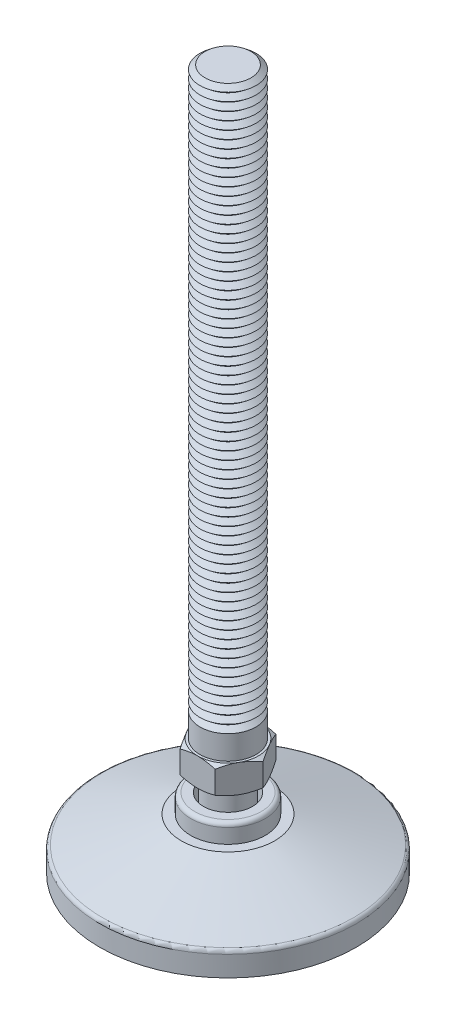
ISO-10303-21;
HEADER;
FILE_DESCRIPTION(('STEP AP214'),'2;1');
FILE_NAME('part.step','',(''),(''),'','','');
FILE_SCHEMA(('AUTOMOTIVE_DESIGN { 1 0 10303 214 1 1 1 1 }'));
ENDSEC;
DATA;
#1=APPLICATION_CONTEXT('core data for automotive mechanical design processes');
#2=APPLICATION_PROTOCOL_DEFINITION('international standard','automotive_design',2000,#1);
#3=PRODUCT_CONTEXT('',#1,'mechanical');
#4=PRODUCT('Part','Part','',(#3));
#5=PRODUCT_RELATED_PRODUCT_CATEGORY('part','',(#4));
#6=PRODUCT_DEFINITION_FORMATION('','',#4);
#7=PRODUCT_DEFINITION_CONTEXT('part definition',#1,'design');
#8=PRODUCT_DEFINITION('design','',#6,#7);
#9=PRODUCT_DEFINITION_SHAPE('','',#8);
#10=(LENGTH_UNIT() NAMED_UNIT(*) SI_UNIT(.MILLI.,.METRE.));
#11=(NAMED_UNIT(*) PLANE_ANGLE_UNIT() SI_UNIT($,.RADIAN.));
#12=(NAMED_UNIT(*) SI_UNIT($,.STERADIAN.) SOLID_ANGLE_UNIT());
#13=UNCERTAINTY_MEASURE_WITH_UNIT(LENGTH_MEASURE(1.E-05),#10,'distance_accuracy_value','');
#14=(GEOMETRIC_REPRESENTATION_CONTEXT(3) GLOBAL_UNCERTAINTY_ASSIGNED_CONTEXT((#13)) GLOBAL_UNIT_ASSIGNED_CONTEXT((#10,
#11,#12)) REPRESENTATION_CONTEXT('',''));
#15=CARTESIAN_POINT('',(0.,0.,0.));
#16=DIRECTION('',(0.,0.,1.));
#17=DIRECTION('',(1.,0.,0.));
#18=AXIS2_PLACEMENT_3D('',#15,#16,#17);
#19=CARTESIAN_POINT('',(0.,3.,0.));
#20=DIRECTION('',(0.,-1.,0.));
#21=DIRECTION('',(0.,0.,-1.));
#22=AXIS2_PLACEMENT_3D('',#19,#20,#21);
#23=CYLINDRICAL_SURFACE('',#22,24.5);
#24=CARTESIAN_POINT('',(0.,3.,0.));
#25=DIRECTION('',(0.,1.,0.));
#26=DIRECTION('',(0.,0.,1.));
#27=AXIS2_PLACEMENT_3D('',#24,#25,#26);
#28=CIRCLE('',#27,24.5);
#29=CARTESIAN_POINT('',(0.,3.,24.5));
#30=VERTEX_POINT('',#29);
#31=EDGE_CURVE('P0_E10',#30,#30,#28,.T.);
#32=ORIENTED_EDGE('',*,*,#31,.F.);
#33=EDGE_LOOP('',(#32));
#34=FACE_BOUND('',#33,.T.);
#35=CARTESIAN_POINT('',(0.,0.,0.));
#36=DIRECTION('',(0.,1.,0.));
#37=DIRECTION('',(0.,0.,1.));
#38=AXIS2_PLACEMENT_3D('',#35,#36,#37);
#39=CIRCLE('',#38,24.5);
#40=CARTESIAN_POINT('',(0.,0.,24.5));
#41=VERTEX_POINT('',#40);
#42=EDGE_CURVE('P0_E17',#41,#41,#39,.T.);
#43=ORIENTED_EDGE('',*,*,#42,.T.);
#44=EDGE_LOOP('',(#43));
#45=FACE_BOUND('',#44,.T.);
#46=ADVANCED_FACE('P0_F14',(#34,#45),#23,.T.);
#47=CARTESIAN_POINT('',(0.,3.,0.));
#48=DIRECTION('',(0.,1.,0.));
#49=DIRECTION('',(0.,0.,1.));
#50=AXIS2_PLACEMENT_3D('',#47,#48,#49);
#51=PLANE('',#50);
#52=CARTESIAN_POINT('',(0.,3.,0.));
#53=DIRECTION('',(0.,1.,0.));
#54=DIRECTION('',(0.,0.,1.));
#55=AXIS2_PLACEMENT_3D('',#52,#53,#54);
#56=CIRCLE('',#55,8.16666666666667);
#57=CARTESIAN_POINT('',(0.,3.,8.16666666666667));
#58=VERTEX_POINT('',#57);
#59=EDGE_CURVE('P0_E26',#58,#58,#56,.T.);
#60=ORIENTED_EDGE('',*,*,#59,.F.);
#61=EDGE_LOOP('',(#60));
#62=FACE_BOUND('',#61,.T.);
#63=ORIENTED_EDGE('',*,*,#31,.T.);
#64=EDGE_LOOP('',(#63));
#65=FACE_BOUND('',#64,.T.);
#66=ADVANCED_FACE('P0_F41',(#62,#65),#51,.T.);
#67=CARTESIAN_POINT('',(0.,0.,0.));
#68=DIRECTION('',(0.,1.,0.));
#69=DIRECTION('',(0.,0.,1.));
#70=AXIS2_PLACEMENT_3D('',#67,#68,#69);
#71=PLANE('',#70);
#72=ORIENTED_EDGE('',*,*,#42,.F.);
#73=EDGE_LOOP('',(#72));
#74=FACE_BOUND('',#73,.T.);
#75=ADVANCED_FACE('P0_F37',(#74),#71,.F.);
#76=CARTESIAN_POINT('',(0.,2.,0.));
#77=DIRECTION('',(0.,1.,0.));
#78=DIRECTION('',(0.,0.,1.));
#79=AXIS2_PLACEMENT_3D('',#76,#77,#78);
#80=CYLINDRICAL_SURFACE('',#79,8.16666666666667);
#81=CARTESIAN_POINT('',(0.,2.,0.));
#82=DIRECTION('',(0.,1.,0.));
#83=DIRECTION('',(0.,0.,1.));
#84=AXIS2_PLACEMENT_3D('',#81,#82,#83);
#85=CIRCLE('',#84,8.16666666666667);
#86=CARTESIAN_POINT('',(0.,2.,8.16666666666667));
#87=VERTEX_POINT('',#86);
#88=EDGE_CURVE('P0_E24',#87,#87,#85,.T.);
#89=ORIENTED_EDGE('',*,*,#88,.F.);
#90=EDGE_LOOP('',(#89));
#91=FACE_BOUND('',#90,.T.);
#92=ORIENTED_EDGE('',*,*,#59,.T.);
#93=EDGE_LOOP('',(#92));
#94=FACE_BOUND('',#93,.T.);
#95=ADVANCED_FACE('P0_F34',(#91,#94),#80,.F.);
#96=CARTESIAN_POINT('',(0.,2.,0.));
#97=DIRECTION('',(0.,1.,0.));
#98=DIRECTION('',(0.,0.,1.));
#99=AXIS2_PLACEMENT_3D('',#96,#97,#98);
#100=PLANE('',#99);
#101=ORIENTED_EDGE('',*,*,#88,.T.);
#102=EDGE_LOOP('',(#101));
#103=FACE_BOUND('',#102,.T.);
#104=ADVANCED_FACE('P0_F32',(#103),#100,.T.);
#105=CLOSED_SHELL('',(#46,#66,#75,#95,#104));
#106=MANIFOLD_SOLID_BREP('P0_B1',#105);
#107=CARTESIAN_POINT('',(0.,145.,0.));
#108=DIRECTION('',(0.,-1.,0.));
#109=DIRECTION('',(0.,0.,-1.));
#110=AXIS2_PLACEMENT_3D('',#107,#108,#109);
#111=CONICAL_SURFACE('',#110,4.90712535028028,0.895664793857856);
#112=CARTESIAN_POINT('',(0.,144.125,0.));
#113=DIRECTION('',(0.,-1.,0.));
#114=DIRECTION('',(0.,0.,-1.));
#115=AXIS2_PLACEMENT_3D('',#112,#113,#114);
#116=CIRCLE('',#115,6.);
#117=CARTESIAN_POINT('',(0.,144.125,-6.));
#118=VERTEX_POINT('',#117);
#119=EDGE_CURVE('P1_E2262',#118,#118,#116,.T.);
#120=ORIENTED_EDGE('',*,*,#119,.F.);
#121=EDGE_LOOP('',(#120));
#122=FACE_BOUND('',#121,.T.);
#123=CARTESIAN_POINT('',(0.,145.,0.));
#124=DIRECTION('',(0.,-1.,0.));
#125=DIRECTION('',(0.,0.,-1.));
#126=AXIS2_PLACEMENT_3D('',#123,#124,#125);
#127=CIRCLE('',#126,4.90712535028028);
#128=CARTESIAN_POINT('',(0.,145.,-4.90712535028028));
#129=VERTEX_POINT('',#128);
#130=EDGE_CURVE('P1_E2271',#129,#129,#127,.T.);
#131=ORIENTED_EDGE('',*,*,#130,.T.);
#132=EDGE_LOOP('',(#131));
#133=FACE_BOUND('',#132,.T.);
#134=ADVANCED_FACE('P1_F16',(#122,#133),#111,.T.);
#135=CARTESIAN_POINT('',(0.,145.875,0.));
#136=DIRECTION('',(0.,1.,0.));
#137=DIRECTION('',(0.,0.,1.));
#138=AXIS2_PLACEMENT_3D('',#135,#136,#137);
#139=CONICAL_SURFACE('',#138,6.,0.895664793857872);
#140=ORIENTED_EDGE('',*,*,#130,.F.);
#141=EDGE_LOOP('',(#140));
#142=FACE_BOUND('',#141,.T.);
#143=CARTESIAN_POINT('',(0.,145.875,0.));
#144=DIRECTION('',(0.,-1.,0.));
#145=DIRECTION('',(0.,0.,-1.));
#146=AXIS2_PLACEMENT_3D('',#143,#144,#145);
#147=CIRCLE('',#146,6.);
#148=CARTESIAN_POINT('',(0.,145.875,-6.));
#149=VERTEX_POINT('',#148);
#150=EDGE_CURVE('P1_E2268',#149,#149,#147,.T.);
#151=ORIENTED_EDGE('',*,*,#150,.T.);
#152=EDGE_LOOP('',(#151));
#153=FACE_BOUND('',#152,.T.);
#154=ADVANCED_FACE('P1_F308',(#142,#153),#139,.T.);
#155=CARTESIAN_POINT('',(0.,152.,0.));
#156=DIRECTION('',(0.,1.,0.));
#157=DIRECTION('',(0.,0.,1.));
#158=AXIS2_PLACEMENT_3D('',#155,#156,#157);
#159=PLANE('',#158);
#160=CARTESIAN_POINT('',(0.,152.,0.));
#161=DIRECTION('',(0.,-1.,0.));
#162=DIRECTION('',(0.,0.,-1.));
#163=AXIS2_PLACEMENT_3D('',#160,#161,#162);
#164=CIRCLE('',#163,4.90712535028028);
#165=CARTESIAN_POINT('',(0.,152.,-4.90712535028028));
#166=VERTEX_POINT('',#165);
#167=EDGE_CURVE('P1_E143',#166,#166,#164,.T.);
#168=ORIENTED_EDGE('',*,*,#167,.F.);
#169=EDGE_LOOP('',(#168));
#170=FACE_BOUND('',#169,.T.);
#171=ADVANCED_FACE('P1_F314',(#170),#159,.T.);
#172=CARTESIAN_POINT('',(0.,152.,0.));
#173=DIRECTION('',(0.,-1.,0.));
#174=DIRECTION('',(0.,0.,-1.));
#175=AXIS2_PLACEMENT_3D('',#172,#173,#174);
#176=CONICAL_SURFACE('',#175,4.90712535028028,0.895664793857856);
#177=CARTESIAN_POINT('',(0.,151.125,0.));
#178=DIRECTION('',(0.,-1.,0.));
#179=DIRECTION('',(0.,0.,-1.));
#180=AXIS2_PLACEMENT_3D('',#177,#178,#179);
#181=CIRCLE('',#180,6.);
#182=CARTESIAN_POINT('',(0.,151.125,-6.));
#183=VERTEX_POINT('',#182);
#184=EDGE_CURVE('P1_E353',#183,#183,#181,.T.);
#185=ORIENTED_EDGE('',*,*,#184,.F.);
#186=EDGE_LOOP('',(#185));
#187=FACE_BOUND('',#186,.T.);
#188=ORIENTED_EDGE('',*,*,#167,.T.);
#189=EDGE_LOOP('',(#188));
#190=FACE_BOUND('',#189,.T.);
#191=ADVANCED_FACE('P1_F211',(#187,#190),#176,.T.);
#192=CARTESIAN_POINT('',(0.,151.125,0.));
#193=DIRECTION('',(0.,1.,0.));
#194=DIRECTION('',(0.,0.,1.));
#195=AXIS2_PLACEMENT_3D('',#192,#193,#194);
#196=CONICAL_SURFACE('',#195,6.,0.895664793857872);
#197=CARTESIAN_POINT('',(0.,150.25,0.));
#198=DIRECTION('',(0.,-1.,0.));
#199=DIRECTION('',(0.,0.,-1.));
#200=AXIS2_PLACEMENT_3D('',#197,#198,#199);
#201=CIRCLE('',#200,4.90712535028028);
#202=CARTESIAN_POINT('',(0.,150.25,-4.90712535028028));
#203=VERTEX_POINT('',#202);
#204=EDGE_CURVE('P1_E352',#203,#203,#201,.T.);
#205=ORIENTED_EDGE('',*,*,#204,.F.);
#206=EDGE_LOOP('',(#205));
#207=FACE_BOUND('',#206,.T.);
#208=ORIENTED_EDGE('',*,*,#184,.T.);
#209=EDGE_LOOP('',(#208));
#210=FACE_BOUND('',#209,.T.);
#211=ADVANCED_FACE('P1_F339',(#207,#210),#196,.T.);
#212=CARTESIAN_POINT('',(0.,150.25,0.));
#213=DIRECTION('',(0.,-1.,0.));
#214=DIRECTION('',(0.,0.,-1.));
#215=AXIS2_PLACEMENT_3D('',#212,#213,#214);
#216=CONICAL_SURFACE('',#215,4.90712535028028,0.895664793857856);
#217=CARTESIAN_POINT('',(0.,149.375,0.));
#218=DIRECTION('',(0.,-1.,0.));
#219=DIRECTION('',(0.,0.,-1.));
#220=AXIS2_PLACEMENT_3D('',#217,#218,#219);
#221=CIRCLE('',#220,6.);
#222=CARTESIAN_POINT('',(0.,149.375,-6.));
#223=VERTEX_POINT('',#222);
#224=EDGE_CURVE('P1_E349',#223,#223,#221,.T.);
#225=ORIENTED_EDGE('',*,*,#224,.F.);
#226=EDGE_LOOP('',(#225));
#227=FACE_BOUND('',#226,.T.);
#228=ORIENTED_EDGE('',*,*,#204,.T.);
#229=EDGE_LOOP('',(#228));
#230=FACE_BOUND('',#229,.T.);
#231=ADVANCED_FACE('P1_F334',(#227,#230),#216,.T.);
#232=CARTESIAN_POINT('',(0.,149.375,0.));
#233=DIRECTION('',(0.,1.,0.));
#234=DIRECTION('',(0.,0.,1.));
#235=AXIS2_PLACEMENT_3D('',#232,#233,#234);
#236=CONICAL_SURFACE('',#235,6.,0.895664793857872);
#237=CARTESIAN_POINT('',(0.,148.5,0.));
#238=DIRECTION('',(0.,-1.,0.));
#239=DIRECTION('',(0.,0.,-1.));
#240=AXIS2_PLACEMENT_3D('',#237,#238,#239);
#241=CIRCLE('',#240,4.90712535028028);
#242=CARTESIAN_POINT('',(0.,148.5,-4.90712535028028));
#243=VERTEX_POINT('',#242);
#244=EDGE_CURVE('P1_E358',#243,#243,#241,.T.);
#245=ORIENTED_EDGE('',*,*,#244,.F.);
#246=EDGE_LOOP('',(#245));
#247=FACE_BOUND('',#246,.T.);
#248=ORIENTED_EDGE('',*,*,#224,.T.);
#249=EDGE_LOOP('',(#248));
#250=FACE_BOUND('',#249,.T.);
#251=ADVANCED_FACE('P1_F331',(#247,#250),#236,.T.);
#252=CARTESIAN_POINT('',(0.,148.5,0.));
#253=DIRECTION('',(0.,-1.,0.));
#254=DIRECTION('',(0.,0.,-1.));
#255=AXIS2_PLACEMENT_3D('',#252,#253,#254);
#256=CONICAL_SURFACE('',#255,4.90712535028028,0.895664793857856);
#257=CARTESIAN_POINT('',(0.,147.625,0.));
#258=DIRECTION('',(0.,-1.,0.));
#259=DIRECTION('',(0.,0.,-1.));
#260=AXIS2_PLACEMENT_3D('',#257,#258,#259);
#261=CIRCLE('',#260,6.);
#262=CARTESIAN_POINT('',(0.,147.625,-6.));
#263=VERTEX_POINT('',#262);
#264=EDGE_CURVE('P1_E2274',#263,#263,#261,.T.);
#265=ORIENTED_EDGE('',*,*,#264,.F.);
#266=EDGE_LOOP('',(#265));
#267=FACE_BOUND('',#266,.T.);
#268=ORIENTED_EDGE('',*,*,#244,.T.);
#269=EDGE_LOOP('',(#268));
#270=FACE_BOUND('',#269,.T.);
#271=ADVANCED_FACE('P1_F325',(#267,#270),#256,.T.);
#272=CARTESIAN_POINT('',(0.,147.625,0.));
#273=DIRECTION('',(0.,1.,0.));
#274=DIRECTION('',(0.,0.,1.));
#275=AXIS2_PLACEMENT_3D('',#272,#273,#274);
#276=CONICAL_SURFACE('',#275,6.,0.895664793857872);
#277=CARTESIAN_POINT('',(0.,146.75,0.));
#278=DIRECTION('',(0.,-1.,0.));
#279=DIRECTION('',(0.,0.,-1.));
#280=AXIS2_PLACEMENT_3D('',#277,#278,#279);
#281=CIRCLE('',#280,4.90712535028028);
#282=CARTESIAN_POINT('',(0.,146.75,-4.90712535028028));
#283=VERTEX_POINT('',#282);
#284=EDGE_CURVE('P1_E2277',#283,#283,#281,.T.);
#285=ORIENTED_EDGE('',*,*,#284,.F.);
#286=EDGE_LOOP('',(#285));
#287=FACE_BOUND('',#286,.T.);
#288=ORIENTED_EDGE('',*,*,#264,.T.);
#289=EDGE_LOOP('',(#288));
#290=FACE_BOUND('',#289,.T.);
#291=ADVANCED_FACE('P1_F321',(#287,#290),#276,.T.);
#292=CARTESIAN_POINT('',(0.,146.75,0.));
#293=DIRECTION('',(0.,-1.,0.));
#294=DIRECTION('',(0.,0.,-1.));
#295=AXIS2_PLACEMENT_3D('',#292,#293,#294);
#296=CONICAL_SURFACE('',#295,4.90712535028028,0.895664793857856);
#297=ORIENTED_EDGE('',*,*,#150,.F.);
#298=EDGE_LOOP('',(#297));
#299=FACE_BOUND('',#298,.T.);
#300=ORIENTED_EDGE('',*,*,#284,.T.);
#301=EDGE_LOOP('',(#300));
#302=FACE_BOUND('',#301,.T.);
#303=ADVANCED_FACE('P1_F324',(#299,#302),#296,.T.);
#304=CARTESIAN_POINT('',(0.,143.25,0.));
#305=DIRECTION('',(0.,-1.,0.));
#306=DIRECTION('',(0.,0.,-1.));
#307=AXIS2_PLACEMENT_3D('',#304,#305,#306);
#308=CONICAL_SURFACE('',#307,4.90712535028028,0.895664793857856);
#309=CARTESIAN_POINT('',(0.,142.375,0.));
#310=DIRECTION('',(0.,-1.,0.));
#311=DIRECTION('',(0.,0.,-1.));
#312=AXIS2_PLACEMENT_3D('',#309,#310,#311);
#313=CIRCLE('',#312,6.);
#314=CARTESIAN_POINT('',(0.,142.375,-6.));
#315=VERTEX_POINT('',#314);
#316=EDGE_CURVE('P1_E2256',#315,#315,#313,.T.);
#317=ORIENTED_EDGE('',*,*,#316,.F.);
#318=EDGE_LOOP('',(#317));
#319=FACE_BOUND('',#318,.T.);
#320=CARTESIAN_POINT('',(0.,143.25,0.));
#321=DIRECTION('',(0.,-1.,0.));
#322=DIRECTION('',(0.,0.,-1.));
#323=AXIS2_PLACEMENT_3D('',#320,#321,#322);
#324=CIRCLE('',#323,4.90712535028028);
#325=CARTESIAN_POINT('',(0.,143.25,-4.90712535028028));
#326=VERTEX_POINT('',#325);
#327=EDGE_CURVE('P1_E2265',#326,#326,#324,.T.);
#328=ORIENTED_EDGE('',*,*,#327,.T.);
#329=EDGE_LOOP('',(#328));
#330=FACE_BOUND('',#329,.T.);
#331=ADVANCED_FACE('P1_F329',(#319,#330),#308,.T.);
#332=CARTESIAN_POINT('',(0.,144.125,0.));
#333=DIRECTION('',(0.,1.,0.));
#334=DIRECTION('',(0.,0.,1.));
#335=AXIS2_PLACEMENT_3D('',#332,#333,#334);
#336=CONICAL_SURFACE('',#335,6.,0.895664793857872);
#337=ORIENTED_EDGE('',*,*,#327,.F.);
#338=EDGE_LOOP('',(#337));
#339=FACE_BOUND('',#338,.T.);
#340=ORIENTED_EDGE('',*,*,#119,.T.);
#341=EDGE_LOOP('',(#340));
#342=FACE_BOUND('',#341,.T.);
#343=ADVANCED_FACE('P1_F1784',(#339,#342),#336,.T.);
#344=CARTESIAN_POINT('',(0.,141.5,0.));
#345=DIRECTION('',(0.,-1.,0.));
#346=DIRECTION('',(0.,0.,-1.));
#347=AXIS2_PLACEMENT_3D('',#344,#345,#346);
#348=CONICAL_SURFACE('',#347,4.90712535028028,0.895664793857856);
#349=CARTESIAN_POINT('',(0.,140.625,0.));
#350=DIRECTION('',(0.,-1.,0.));
#351=DIRECTION('',(0.,0.,-1.));
#352=AXIS2_PLACEMENT_3D('',#349,#350,#351);
#353=CIRCLE('',#352,6.);
#354=CARTESIAN_POINT('',(0.,140.625,-6.));
#355=VERTEX_POINT('',#354);
#356=EDGE_CURVE('P1_E2250',#355,#355,#353,.T.);
#357=ORIENTED_EDGE('',*,*,#356,.F.);
#358=EDGE_LOOP('',(#357));
#359=FACE_BOUND('',#358,.T.);
#360=CARTESIAN_POINT('',(0.,141.5,0.));
#361=DIRECTION('',(0.,-1.,0.));
#362=DIRECTION('',(0.,0.,-1.));
#363=AXIS2_PLACEMENT_3D('',#360,#361,#362);
#364=CIRCLE('',#363,4.90712535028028);
#365=CARTESIAN_POINT('',(0.,141.5,-4.90712535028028));
#366=VERTEX_POINT('',#365);
#367=EDGE_CURVE('P1_E2259',#366,#366,#364,.T.);
#368=ORIENTED_EDGE('',*,*,#367,.T.);
#369=EDGE_LOOP('',(#368));
#370=FACE_BOUND('',#369,.T.);
#371=ADVANCED_FACE('P1_F1774',(#359,#370),#348,.T.);
#372=CARTESIAN_POINT('',(0.,142.375,0.));
#373=DIRECTION('',(0.,1.,0.));
#374=DIRECTION('',(0.,0.,1.));
#375=AXIS2_PLACEMENT_3D('',#372,#373,#374);
#376=CONICAL_SURFACE('',#375,6.,0.895664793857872);
#377=ORIENTED_EDGE('',*,*,#367,.F.);
#378=EDGE_LOOP('',(#377));
#379=FACE_BOUND('',#378,.T.);
#380=ORIENTED_EDGE('',*,*,#316,.T.);
#381=EDGE_LOOP('',(#380));
#382=FACE_BOUND('',#381,.T.);
#383=ADVANCED_FACE('P1_F1764',(#379,#382),#376,.T.);
#384=CARTESIAN_POINT('',(0.,139.75,0.));
#385=DIRECTION('',(0.,-1.,0.));
#386=DIRECTION('',(0.,0.,-1.));
#387=AXIS2_PLACEMENT_3D('',#384,#385,#386);
#388=CONICAL_SURFACE('',#387,4.90712535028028,0.895664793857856);
#389=CARTESIAN_POINT('',(0.,138.875,0.));
#390=DIRECTION('',(0.,-1.,0.));
#391=DIRECTION('',(0.,0.,-1.));
#392=AXIS2_PLACEMENT_3D('',#389,#390,#391);
#393=CIRCLE('',#392,6.);
#394=CARTESIAN_POINT('',(0.,138.875,-6.));
#395=VERTEX_POINT('',#394);
#396=EDGE_CURVE('P1_E2244',#395,#395,#393,.T.);
#397=ORIENTED_EDGE('',*,*,#396,.F.);
#398=EDGE_LOOP('',(#397));
#399=FACE_BOUND('',#398,.T.);
#400=CARTESIAN_POINT('',(0.,139.75,0.));
#401=DIRECTION('',(0.,-1.,0.));
#402=DIRECTION('',(0.,0.,-1.));
#403=AXIS2_PLACEMENT_3D('',#400,#401,#402);
#404=CIRCLE('',#403,4.90712535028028);
#405=CARTESIAN_POINT('',(0.,139.75,-4.90712535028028));
#406=VERTEX_POINT('',#405);
#407=EDGE_CURVE('P1_E2253',#406,#406,#404,.T.);
#408=ORIENTED_EDGE('',*,*,#407,.T.);
#409=EDGE_LOOP('',(#408));
#410=FACE_BOUND('',#409,.T.);
#411=ADVANCED_FACE('P1_F1754',(#399,#410),#388,.T.);
#412=CARTESIAN_POINT('',(0.,140.625,0.));
#413=DIRECTION('',(0.,1.,0.));
#414=DIRECTION('',(0.,0.,1.));
#415=AXIS2_PLACEMENT_3D('',#412,#413,#414);
#416=CONICAL_SURFACE('',#415,6.,0.895664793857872);
#417=ORIENTED_EDGE('',*,*,#407,.F.);
#418=EDGE_LOOP('',(#417));
#419=FACE_BOUND('',#418,.T.);
#420=ORIENTED_EDGE('',*,*,#356,.T.);
#421=EDGE_LOOP('',(#420));
#422=FACE_BOUND('',#421,.T.);
#423=ADVANCED_FACE('P1_F1744',(#419,#422),#416,.T.);
#424=CARTESIAN_POINT('',(0.,138.,0.));
#425=DIRECTION('',(0.,-1.,0.));
#426=DIRECTION('',(0.,0.,-1.));
#427=AXIS2_PLACEMENT_3D('',#424,#425,#426);
#428=CONICAL_SURFACE('',#427,4.90712535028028,0.895664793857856);
#429=CARTESIAN_POINT('',(0.,137.125,0.));
#430=DIRECTION('',(0.,-1.,0.));
#431=DIRECTION('',(0.,0.,-1.));
#432=AXIS2_PLACEMENT_3D('',#429,#430,#431);
#433=CIRCLE('',#432,6.);
#434=CARTESIAN_POINT('',(0.,137.125,-6.));
#435=VERTEX_POINT('',#434);
#436=EDGE_CURVE('P1_E2238',#435,#435,#433,.T.);
#437=ORIENTED_EDGE('',*,*,#436,.F.);
#438=EDGE_LOOP('',(#437));
#439=FACE_BOUND('',#438,.T.);
#440=CARTESIAN_POINT('',(0.,138.,0.));
#441=DIRECTION('',(0.,-1.,0.));
#442=DIRECTION('',(0.,0.,-1.));
#443=AXIS2_PLACEMENT_3D('',#440,#441,#442);
#444=CIRCLE('',#443,4.90712535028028);
#445=CARTESIAN_POINT('',(0.,138.,-4.90712535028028));
#446=VERTEX_POINT('',#445);
#447=EDGE_CURVE('P1_E2247',#446,#446,#444,.T.);
#448=ORIENTED_EDGE('',*,*,#447,.T.);
#449=EDGE_LOOP('',(#448));
#450=FACE_BOUND('',#449,.T.);
#451=ADVANCED_FACE('P1_F1734',(#439,#450),#428,.T.);
#452=CARTESIAN_POINT('',(0.,138.875,0.));
#453=DIRECTION('',(0.,1.,0.));
#454=DIRECTION('',(0.,0.,1.));
#455=AXIS2_PLACEMENT_3D('',#452,#453,#454);
#456=CONICAL_SURFACE('',#455,6.,0.895664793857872);
#457=ORIENTED_EDGE('',*,*,#447,.F.);
#458=EDGE_LOOP('',(#457));
#459=FACE_BOUND('',#458,.T.);
#460=ORIENTED_EDGE('',*,*,#396,.T.);
#461=EDGE_LOOP('',(#460));
#462=FACE_BOUND('',#461,.T.);
#463=ADVANCED_FACE('P1_F1724',(#459,#462),#456,.T.);
#464=CARTESIAN_POINT('',(0.,136.25,0.));
#465=DIRECTION('',(0.,-1.,0.));
#466=DIRECTION('',(0.,0.,-1.));
#467=AXIS2_PLACEMENT_3D('',#464,#465,#466);
#468=CONICAL_SURFACE('',#467,4.90712535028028,0.895664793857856);
#469=CARTESIAN_POINT('',(0.,135.375,0.));
#470=DIRECTION('',(0.,-1.,0.));
#471=DIRECTION('',(0.,0.,-1.));
#472=AXIS2_PLACEMENT_3D('',#469,#470,#471);
#473=CIRCLE('',#472,6.);
#474=CARTESIAN_POINT('',(0.,135.375,-6.));
#475=VERTEX_POINT('',#474);
#476=EDGE_CURVE('P1_E2232',#475,#475,#473,.T.);
#477=ORIENTED_EDGE('',*,*,#476,.F.);
#478=EDGE_LOOP('',(#477));
#479=FACE_BOUND('',#478,.T.);
#480=CARTESIAN_POINT('',(0.,136.25,0.));
#481=DIRECTION('',(0.,-1.,0.));
#482=DIRECTION('',(0.,0.,-1.));
#483=AXIS2_PLACEMENT_3D('',#480,#481,#482);
#484=CIRCLE('',#483,4.90712535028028);
#485=CARTESIAN_POINT('',(0.,136.25,-4.90712535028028));
#486=VERTEX_POINT('',#485);
#487=EDGE_CURVE('P1_E2241',#486,#486,#484,.T.);
#488=ORIENTED_EDGE('',*,*,#487,.T.);
#489=EDGE_LOOP('',(#488));
#490=FACE_BOUND('',#489,.T.);
#491=ADVANCED_FACE('P1_F1714',(#479,#490),#468,.T.);
#492=CARTESIAN_POINT('',(0.,137.125,0.));
#493=DIRECTION('',(0.,1.,0.));
#494=DIRECTION('',(0.,0.,1.));
#495=AXIS2_PLACEMENT_3D('',#492,#493,#494);
#496=CONICAL_SURFACE('',#495,6.,0.895664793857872);
#497=ORIENTED_EDGE('',*,*,#487,.F.);
#498=EDGE_LOOP('',(#497));
#499=FACE_BOUND('',#498,.T.);
#500=ORIENTED_EDGE('',*,*,#436,.T.);
#501=EDGE_LOOP('',(#500));
#502=FACE_BOUND('',#501,.T.);
#503=ADVANCED_FACE('P1_F1704',(#499,#502),#496,.T.);
#504=CARTESIAN_POINT('',(0.,134.5,0.));
#505=DIRECTION('',(0.,-1.,0.));
#506=DIRECTION('',(0.,0.,-1.));
#507=AXIS2_PLACEMENT_3D('',#504,#505,#506);
#508=CONICAL_SURFACE('',#507,4.90712535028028,0.895664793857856);
#509=CARTESIAN_POINT('',(0.,133.625,0.));
#510=DIRECTION('',(0.,-1.,0.));
#511=DIRECTION('',(0.,0.,-1.));
#512=AXIS2_PLACEMENT_3D('',#509,#510,#511);
#513=CIRCLE('',#512,6.);
#514=CARTESIAN_POINT('',(0.,133.625,-6.));
#515=VERTEX_POINT('',#514);
#516=EDGE_CURVE('P1_E2226',#515,#515,#513,.T.);
#517=ORIENTED_EDGE('',*,*,#516,.F.);
#518=EDGE_LOOP('',(#517));
#519=FACE_BOUND('',#518,.T.);
#520=CARTESIAN_POINT('',(0.,134.5,0.));
#521=DIRECTION('',(0.,-1.,0.));
#522=DIRECTION('',(0.,0.,-1.));
#523=AXIS2_PLACEMENT_3D('',#520,#521,#522);
#524=CIRCLE('',#523,4.90712535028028);
#525=CARTESIAN_POINT('',(0.,134.5,-4.90712535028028));
#526=VERTEX_POINT('',#525);
#527=EDGE_CURVE('P1_E2235',#526,#526,#524,.T.);
#528=ORIENTED_EDGE('',*,*,#527,.T.);
#529=EDGE_LOOP('',(#528));
#530=FACE_BOUND('',#529,.T.);
#531=ADVANCED_FACE('P1_F1694',(#519,#530),#508,.T.);
#532=CARTESIAN_POINT('',(0.,135.375,0.));
#533=DIRECTION('',(0.,1.,0.));
#534=DIRECTION('',(0.,0.,1.));
#535=AXIS2_PLACEMENT_3D('',#532,#533,#534);
#536=CONICAL_SURFACE('',#535,6.,0.895664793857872);
#537=ORIENTED_EDGE('',*,*,#527,.F.);
#538=EDGE_LOOP('',(#537));
#539=FACE_BOUND('',#538,.T.);
#540=ORIENTED_EDGE('',*,*,#476,.T.);
#541=EDGE_LOOP('',(#540));
#542=FACE_BOUND('',#541,.T.);
#543=ADVANCED_FACE('P1_F1684',(#539,#542),#536,.T.);
#544=CARTESIAN_POINT('',(0.,132.75,0.));
#545=DIRECTION('',(0.,-1.,0.));
#546=DIRECTION('',(0.,0.,-1.));
#547=AXIS2_PLACEMENT_3D('',#544,#545,#546);
#548=CONICAL_SURFACE('',#547,4.90712535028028,0.895664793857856);
#549=CARTESIAN_POINT('',(0.,131.875,0.));
#550=DIRECTION('',(0.,-1.,0.));
#551=DIRECTION('',(0.,0.,-1.));
#552=AXIS2_PLACEMENT_3D('',#549,#550,#551);
#553=CIRCLE('',#552,6.);
#554=CARTESIAN_POINT('',(0.,131.875,-6.));
#555=VERTEX_POINT('',#554);
#556=EDGE_CURVE('P1_E2220',#555,#555,#553,.T.);
#557=ORIENTED_EDGE('',*,*,#556,.F.);
#558=EDGE_LOOP('',(#557));
#559=FACE_BOUND('',#558,.T.);
#560=CARTESIAN_POINT('',(0.,132.75,0.));
#561=DIRECTION('',(0.,-1.,0.));
#562=DIRECTION('',(0.,0.,-1.));
#563=AXIS2_PLACEMENT_3D('',#560,#561,#562);
#564=CIRCLE('',#563,4.90712535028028);
#565=CARTESIAN_POINT('',(0.,132.75,-4.90712535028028));
#566=VERTEX_POINT('',#565);
#567=EDGE_CURVE('P1_E2229',#566,#566,#564,.T.);
#568=ORIENTED_EDGE('',*,*,#567,.T.);
#569=EDGE_LOOP('',(#568));
#570=FACE_BOUND('',#569,.T.);
#571=ADVANCED_FACE('P1_F1674',(#559,#570),#548,.T.);
#572=CARTESIAN_POINT('',(0.,133.625,0.));
#573=DIRECTION('',(0.,1.,0.));
#574=DIRECTION('',(0.,0.,1.));
#575=AXIS2_PLACEMENT_3D('',#572,#573,#574);
#576=CONICAL_SURFACE('',#575,6.,0.895664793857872);
#577=ORIENTED_EDGE('',*,*,#567,.F.);
#578=EDGE_LOOP('',(#577));
#579=FACE_BOUND('',#578,.T.);
#580=ORIENTED_EDGE('',*,*,#516,.T.);
#581=EDGE_LOOP('',(#580));
#582=FACE_BOUND('',#581,.T.);
#583=ADVANCED_FACE('P1_F1664',(#579,#582),#576,.T.);
#584=CARTESIAN_POINT('',(0.,131.,0.));
#585=DIRECTION('',(0.,-1.,0.));
#586=DIRECTION('',(0.,0.,-1.));
#587=AXIS2_PLACEMENT_3D('',#584,#585,#586);
#588=CONICAL_SURFACE('',#587,4.90712535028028,0.895664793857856);
#589=CARTESIAN_POINT('',(0.,130.125,0.));
#590=DIRECTION('',(0.,-1.,0.));
#591=DIRECTION('',(0.,0.,-1.));
#592=AXIS2_PLACEMENT_3D('',#589,#590,#591);
#593=CIRCLE('',#592,6.);
#594=CARTESIAN_POINT('',(0.,130.125,-6.));
#595=VERTEX_POINT('',#594);
#596=EDGE_CURVE('P1_E2214',#595,#595,#593,.T.);
#597=ORIENTED_EDGE('',*,*,#596,.F.);
#598=EDGE_LOOP('',(#597));
#599=FACE_BOUND('',#598,.T.);
#600=CARTESIAN_POINT('',(0.,131.,0.));
#601=DIRECTION('',(0.,-1.,0.));
#602=DIRECTION('',(0.,0.,-1.));
#603=AXIS2_PLACEMENT_3D('',#600,#601,#602);
#604=CIRCLE('',#603,4.90712535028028);
#605=CARTESIAN_POINT('',(0.,131.,-4.90712535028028));
#606=VERTEX_POINT('',#605);
#607=EDGE_CURVE('P1_E2223',#606,#606,#604,.T.);
#608=ORIENTED_EDGE('',*,*,#607,.T.);
#609=EDGE_LOOP('',(#608));
#610=FACE_BOUND('',#609,.T.);
#611=ADVANCED_FACE('P1_F1654',(#599,#610),#588,.T.);
#612=CARTESIAN_POINT('',(0.,131.875,0.));
#613=DIRECTION('',(0.,1.,0.));
#614=DIRECTION('',(0.,0.,1.));
#615=AXIS2_PLACEMENT_3D('',#612,#613,#614);
#616=CONICAL_SURFACE('',#615,6.,0.895664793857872);
#617=ORIENTED_EDGE('',*,*,#607,.F.);
#618=EDGE_LOOP('',(#617));
#619=FACE_BOUND('',#618,.T.);
#620=ORIENTED_EDGE('',*,*,#556,.T.);
#621=EDGE_LOOP('',(#620));
#622=FACE_BOUND('',#621,.T.);
#623=ADVANCED_FACE('P1_F1644',(#619,#622),#616,.T.);
#624=CARTESIAN_POINT('',(0.,129.25,0.));
#625=DIRECTION('',(0.,-1.,0.));
#626=DIRECTION('',(0.,0.,-1.));
#627=AXIS2_PLACEMENT_3D('',#624,#625,#626);
#628=CONICAL_SURFACE('',#627,4.90712535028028,0.895664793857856);
#629=CARTESIAN_POINT('',(0.,128.375,0.));
#630=DIRECTION('',(0.,-1.,0.));
#631=DIRECTION('',(0.,0.,-1.));
#632=AXIS2_PLACEMENT_3D('',#629,#630,#631);
#633=CIRCLE('',#632,6.);
#634=CARTESIAN_POINT('',(0.,128.375,-6.));
#635=VERTEX_POINT('',#634);
#636=EDGE_CURVE('P1_E2208',#635,#635,#633,.T.);
#637=ORIENTED_EDGE('',*,*,#636,.F.);
#638=EDGE_LOOP('',(#637));
#639=FACE_BOUND('',#638,.T.);
#640=CARTESIAN_POINT('',(0.,129.25,0.));
#641=DIRECTION('',(0.,-1.,0.));
#642=DIRECTION('',(0.,0.,-1.));
#643=AXIS2_PLACEMENT_3D('',#640,#641,#642);
#644=CIRCLE('',#643,4.90712535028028);
#645=CARTESIAN_POINT('',(0.,129.25,-4.90712535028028));
#646=VERTEX_POINT('',#645);
#647=EDGE_CURVE('P1_E2217',#646,#646,#644,.T.);
#648=ORIENTED_EDGE('',*,*,#647,.T.);
#649=EDGE_LOOP('',(#648));
#650=FACE_BOUND('',#649,.T.);
#651=ADVANCED_FACE('P1_F1634',(#639,#650),#628,.T.);
#652=CARTESIAN_POINT('',(0.,130.125,0.));
#653=DIRECTION('',(0.,1.,0.));
#654=DIRECTION('',(0.,0.,1.));
#655=AXIS2_PLACEMENT_3D('',#652,#653,#654);
#656=CONICAL_SURFACE('',#655,6.,0.895664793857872);
#657=ORIENTED_EDGE('',*,*,#647,.F.);
#658=EDGE_LOOP('',(#657));
#659=FACE_BOUND('',#658,.T.);
#660=ORIENTED_EDGE('',*,*,#596,.T.);
#661=EDGE_LOOP('',(#660));
#662=FACE_BOUND('',#661,.T.);
#663=ADVANCED_FACE('P1_F1624',(#659,#662),#656,.T.);
#664=CARTESIAN_POINT('',(0.,127.5,0.));
#665=DIRECTION('',(0.,-1.,0.));
#666=DIRECTION('',(0.,0.,-1.));
#667=AXIS2_PLACEMENT_3D('',#664,#665,#666);
#668=CONICAL_SURFACE('',#667,4.90712535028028,0.895664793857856);
#669=CARTESIAN_POINT('',(0.,126.625,0.));
#670=DIRECTION('',(0.,-1.,0.));
#671=DIRECTION('',(0.,0.,-1.));
#672=AXIS2_PLACEMENT_3D('',#669,#670,#671);
#673=CIRCLE('',#672,6.);
#674=CARTESIAN_POINT('',(0.,126.625,-6.));
#675=VERTEX_POINT('',#674);
#676=EDGE_CURVE('P1_E2202',#675,#675,#673,.T.);
#677=ORIENTED_EDGE('',*,*,#676,.F.);
#678=EDGE_LOOP('',(#677));
#679=FACE_BOUND('',#678,.T.);
#680=CARTESIAN_POINT('',(0.,127.5,0.));
#681=DIRECTION('',(0.,-1.,0.));
#682=DIRECTION('',(0.,0.,-1.));
#683=AXIS2_PLACEMENT_3D('',#680,#681,#682);
#684=CIRCLE('',#683,4.90712535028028);
#685=CARTESIAN_POINT('',(0.,127.5,-4.90712535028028));
#686=VERTEX_POINT('',#685);
#687=EDGE_CURVE('P1_E2211',#686,#686,#684,.T.);
#688=ORIENTED_EDGE('',*,*,#687,.T.);
#689=EDGE_LOOP('',(#688));
#690=FACE_BOUND('',#689,.T.);
#691=ADVANCED_FACE('P1_F1614',(#679,#690),#668,.T.);
#692=CARTESIAN_POINT('',(0.,128.375,0.));
#693=DIRECTION('',(0.,1.,0.));
#694=DIRECTION('',(0.,0.,1.));
#695=AXIS2_PLACEMENT_3D('',#692,#693,#694);
#696=CONICAL_SURFACE('',#695,6.,0.895664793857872);
#697=ORIENTED_EDGE('',*,*,#687,.F.);
#698=EDGE_LOOP('',(#697));
#699=FACE_BOUND('',#698,.T.);
#700=ORIENTED_EDGE('',*,*,#636,.T.);
#701=EDGE_LOOP('',(#700));
#702=FACE_BOUND('',#701,.T.);
#703=ADVANCED_FACE('P1_F1604',(#699,#702),#696,.T.);
#704=CARTESIAN_POINT('',(0.,125.75,0.));
#705=DIRECTION('',(0.,-1.,0.));
#706=DIRECTION('',(0.,0.,-1.));
#707=AXIS2_PLACEMENT_3D('',#704,#705,#706);
#708=CONICAL_SURFACE('',#707,4.90712535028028,0.895664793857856);
#709=CARTESIAN_POINT('',(0.,124.875,0.));
#710=DIRECTION('',(0.,-1.,0.));
#711=DIRECTION('',(0.,0.,-1.));
#712=AXIS2_PLACEMENT_3D('',#709,#710,#711);
#713=CIRCLE('',#712,6.);
#714=CARTESIAN_POINT('',(0.,124.875,-6.));
#715=VERTEX_POINT('',#714);
#716=EDGE_CURVE('P1_E2196',#715,#715,#713,.T.);
#717=ORIENTED_EDGE('',*,*,#716,.F.);
#718=EDGE_LOOP('',(#717));
#719=FACE_BOUND('',#718,.T.);
#720=CARTESIAN_POINT('',(0.,125.75,0.));
#721=DIRECTION('',(0.,-1.,0.));
#722=DIRECTION('',(0.,0.,-1.));
#723=AXIS2_PLACEMENT_3D('',#720,#721,#722);
#724=CIRCLE('',#723,4.90712535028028);
#725=CARTESIAN_POINT('',(0.,125.75,-4.90712535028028));
#726=VERTEX_POINT('',#725);
#727=EDGE_CURVE('P1_E2205',#726,#726,#724,.T.);
#728=ORIENTED_EDGE('',*,*,#727,.T.);
#729=EDGE_LOOP('',(#728));
#730=FACE_BOUND('',#729,.T.);
#731=ADVANCED_FACE('P1_F1594',(#719,#730),#708,.T.);
#732=CARTESIAN_POINT('',(0.,126.625,0.));
#733=DIRECTION('',(0.,1.,0.));
#734=DIRECTION('',(0.,0.,1.));
#735=AXIS2_PLACEMENT_3D('',#732,#733,#734);
#736=CONICAL_SURFACE('',#735,6.,0.895664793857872);
#737=ORIENTED_EDGE('',*,*,#727,.F.);
#738=EDGE_LOOP('',(#737));
#739=FACE_BOUND('',#738,.T.);
#740=ORIENTED_EDGE('',*,*,#676,.T.);
#741=EDGE_LOOP('',(#740));
#742=FACE_BOUND('',#741,.T.);
#743=ADVANCED_FACE('P1_F1584',(#739,#742),#736,.T.);
#744=CARTESIAN_POINT('',(0.,124.,0.));
#745=DIRECTION('',(0.,-1.,0.));
#746=DIRECTION('',(0.,0.,-1.));
#747=AXIS2_PLACEMENT_3D('',#744,#745,#746);
#748=CONICAL_SURFACE('',#747,4.90712535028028,0.895664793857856);
#749=CARTESIAN_POINT('',(0.,123.125,0.));
#750=DIRECTION('',(0.,-1.,0.));
#751=DIRECTION('',(0.,0.,-1.));
#752=AXIS2_PLACEMENT_3D('',#749,#750,#751);
#753=CIRCLE('',#752,6.);
#754=CARTESIAN_POINT('',(0.,123.125,-6.));
#755=VERTEX_POINT('',#754);
#756=EDGE_CURVE('P1_E2190',#755,#755,#753,.T.);
#757=ORIENTED_EDGE('',*,*,#756,.F.);
#758=EDGE_LOOP('',(#757));
#759=FACE_BOUND('',#758,.T.);
#760=CARTESIAN_POINT('',(0.,124.,0.));
#761=DIRECTION('',(0.,-1.,0.));
#762=DIRECTION('',(0.,0.,-1.));
#763=AXIS2_PLACEMENT_3D('',#760,#761,#762);
#764=CIRCLE('',#763,4.90712535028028);
#765=CARTESIAN_POINT('',(0.,124.,-4.90712535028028));
#766=VERTEX_POINT('',#765);
#767=EDGE_CURVE('P1_E2199',#766,#766,#764,.T.);
#768=ORIENTED_EDGE('',*,*,#767,.T.);
#769=EDGE_LOOP('',(#768));
#770=FACE_BOUND('',#769,.T.);
#771=ADVANCED_FACE('P1_F1574',(#759,#770),#748,.T.);
#772=CARTESIAN_POINT('',(0.,124.875,0.));
#773=DIRECTION('',(0.,1.,0.));
#774=DIRECTION('',(0.,0.,1.));
#775=AXIS2_PLACEMENT_3D('',#772,#773,#774);
#776=CONICAL_SURFACE('',#775,6.,0.895664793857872);
#777=ORIENTED_EDGE('',*,*,#767,.F.);
#778=EDGE_LOOP('',(#777));
#779=FACE_BOUND('',#778,.T.);
#780=ORIENTED_EDGE('',*,*,#716,.T.);
#781=EDGE_LOOP('',(#780));
#782=FACE_BOUND('',#781,.T.);
#783=ADVANCED_FACE('P1_F1564',(#779,#782),#776,.T.);
#784=CARTESIAN_POINT('',(0.,122.25,0.));
#785=DIRECTION('',(0.,-1.,0.));
#786=DIRECTION('',(0.,0.,-1.));
#787=AXIS2_PLACEMENT_3D('',#784,#785,#786);
#788=CONICAL_SURFACE('',#787,4.90712535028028,0.895664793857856);
#789=CARTESIAN_POINT('',(0.,121.375,0.));
#790=DIRECTION('',(0.,-1.,0.));
#791=DIRECTION('',(0.,0.,-1.));
#792=AXIS2_PLACEMENT_3D('',#789,#790,#791);
#793=CIRCLE('',#792,6.);
#794=CARTESIAN_POINT('',(0.,121.375,-6.));
#795=VERTEX_POINT('',#794);
#796=EDGE_CURVE('P1_E2184',#795,#795,#793,.T.);
#797=ORIENTED_EDGE('',*,*,#796,.F.);
#798=EDGE_LOOP('',(#797));
#799=FACE_BOUND('',#798,.T.);
#800=CARTESIAN_POINT('',(0.,122.25,0.));
#801=DIRECTION('',(0.,-1.,0.));
#802=DIRECTION('',(0.,0.,-1.));
#803=AXIS2_PLACEMENT_3D('',#800,#801,#802);
#804=CIRCLE('',#803,4.90712535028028);
#805=CARTESIAN_POINT('',(0.,122.25,-4.90712535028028));
#806=VERTEX_POINT('',#805);
#807=EDGE_CURVE('P1_E2193',#806,#806,#804,.T.);
#808=ORIENTED_EDGE('',*,*,#807,.T.);
#809=EDGE_LOOP('',(#808));
#810=FACE_BOUND('',#809,.T.);
#811=ADVANCED_FACE('P1_F1554',(#799,#810),#788,.T.);
#812=CARTESIAN_POINT('',(0.,123.125,0.));
#813=DIRECTION('',(0.,1.,0.));
#814=DIRECTION('',(0.,0.,1.));
#815=AXIS2_PLACEMENT_3D('',#812,#813,#814);
#816=CONICAL_SURFACE('',#815,6.,0.895664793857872);
#817=ORIENTED_EDGE('',*,*,#807,.F.);
#818=EDGE_LOOP('',(#817));
#819=FACE_BOUND('',#818,.T.);
#820=ORIENTED_EDGE('',*,*,#756,.T.);
#821=EDGE_LOOP('',(#820));
#822=FACE_BOUND('',#821,.T.);
#823=ADVANCED_FACE('P1_F1544',(#819,#822),#816,.T.);
#824=CARTESIAN_POINT('',(0.,120.5,0.));
#825=DIRECTION('',(0.,-1.,0.));
#826=DIRECTION('',(0.,0.,-1.));
#827=AXIS2_PLACEMENT_3D('',#824,#825,#826);
#828=CONICAL_SURFACE('',#827,4.90712535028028,0.895664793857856);
#829=CARTESIAN_POINT('',(0.,119.625,0.));
#830=DIRECTION('',(0.,-1.,0.));
#831=DIRECTION('',(0.,0.,-1.));
#832=AXIS2_PLACEMENT_3D('',#829,#830,#831);
#833=CIRCLE('',#832,6.);
#834=CARTESIAN_POINT('',(0.,119.625,-6.));
#835=VERTEX_POINT('',#834);
#836=EDGE_CURVE('P1_E2178',#835,#835,#833,.T.);
#837=ORIENTED_EDGE('',*,*,#836,.F.);
#838=EDGE_LOOP('',(#837));
#839=FACE_BOUND('',#838,.T.);
#840=CARTESIAN_POINT('',(0.,120.5,0.));
#841=DIRECTION('',(0.,-1.,0.));
#842=DIRECTION('',(0.,0.,-1.));
#843=AXIS2_PLACEMENT_3D('',#840,#841,#842);
#844=CIRCLE('',#843,4.90712535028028);
#845=CARTESIAN_POINT('',(0.,120.5,-4.90712535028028));
#846=VERTEX_POINT('',#845);
#847=EDGE_CURVE('P1_E2187',#846,#846,#844,.T.);
#848=ORIENTED_EDGE('',*,*,#847,.T.);
#849=EDGE_LOOP('',(#848));
#850=FACE_BOUND('',#849,.T.);
#851=ADVANCED_FACE('P1_F1534',(#839,#850),#828,.T.);
#852=CARTESIAN_POINT('',(0.,121.375,0.));
#853=DIRECTION('',(0.,1.,0.));
#854=DIRECTION('',(0.,0.,1.));
#855=AXIS2_PLACEMENT_3D('',#852,#853,#854);
#856=CONICAL_SURFACE('',#855,6.,0.895664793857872);
#857=ORIENTED_EDGE('',*,*,#847,.F.);
#858=EDGE_LOOP('',(#857));
#859=FACE_BOUND('',#858,.T.);
#860=ORIENTED_EDGE('',*,*,#796,.T.);
#861=EDGE_LOOP('',(#860));
#862=FACE_BOUND('',#861,.T.);
#863=ADVANCED_FACE('P1_F1524',(#859,#862),#856,.T.);
#864=CARTESIAN_POINT('',(0.,118.75,0.));
#865=DIRECTION('',(0.,-1.,0.));
#866=DIRECTION('',(0.,0.,-1.));
#867=AXIS2_PLACEMENT_3D('',#864,#865,#866);
#868=CONICAL_SURFACE('',#867,4.90712535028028,0.895664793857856);
#869=CARTESIAN_POINT('',(0.,117.875,0.));
#870=DIRECTION('',(0.,-1.,0.));
#871=DIRECTION('',(0.,0.,-1.));
#872=AXIS2_PLACEMENT_3D('',#869,#870,#871);
#873=CIRCLE('',#872,6.);
#874=CARTESIAN_POINT('',(0.,117.875,-6.));
#875=VERTEX_POINT('',#874);
#876=EDGE_CURVE('P1_E2172',#875,#875,#873,.T.);
#877=ORIENTED_EDGE('',*,*,#876,.F.);
#878=EDGE_LOOP('',(#877));
#879=FACE_BOUND('',#878,.T.);
#880=CARTESIAN_POINT('',(0.,118.75,0.));
#881=DIRECTION('',(0.,-1.,0.));
#882=DIRECTION('',(0.,0.,-1.));
#883=AXIS2_PLACEMENT_3D('',#880,#881,#882);
#884=CIRCLE('',#883,4.90712535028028);
#885=CARTESIAN_POINT('',(0.,118.75,-4.90712535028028));
#886=VERTEX_POINT('',#885);
#887=EDGE_CURVE('P1_E2181',#886,#886,#884,.T.);
#888=ORIENTED_EDGE('',*,*,#887,.T.);
#889=EDGE_LOOP('',(#888));
#890=FACE_BOUND('',#889,.T.);
#891=ADVANCED_FACE('P1_F1514',(#879,#890),#868,.T.);
#892=CARTESIAN_POINT('',(0.,119.625,0.));
#893=DIRECTION('',(0.,1.,0.));
#894=DIRECTION('',(0.,0.,1.));
#895=AXIS2_PLACEMENT_3D('',#892,#893,#894);
#896=CONICAL_SURFACE('',#895,6.,0.895664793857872);
#897=ORIENTED_EDGE('',*,*,#887,.F.);
#898=EDGE_LOOP('',(#897));
#899=FACE_BOUND('',#898,.T.);
#900=ORIENTED_EDGE('',*,*,#836,.T.);
#901=EDGE_LOOP('',(#900));
#902=FACE_BOUND('',#901,.T.);
#903=ADVANCED_FACE('P1_F1504',(#899,#902),#896,.T.);
#904=CARTESIAN_POINT('',(0.,117.,0.));
#905=DIRECTION('',(0.,-1.,0.));
#906=DIRECTION('',(0.,0.,-1.));
#907=AXIS2_PLACEMENT_3D('',#904,#905,#906);
#908=CONICAL_SURFACE('',#907,4.90712535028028,0.895664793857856);
#909=CARTESIAN_POINT('',(0.,116.125,0.));
#910=DIRECTION('',(0.,-1.,0.));
#911=DIRECTION('',(0.,0.,-1.));
#912=AXIS2_PLACEMENT_3D('',#909,#910,#911);
#913=CIRCLE('',#912,6.);
#914=CARTESIAN_POINT('',(0.,116.125,-6.));
#915=VERTEX_POINT('',#914);
#916=EDGE_CURVE('P1_E2166',#915,#915,#913,.T.);
#917=ORIENTED_EDGE('',*,*,#916,.F.);
#918=EDGE_LOOP('',(#917));
#919=FACE_BOUND('',#918,.T.);
#920=CARTESIAN_POINT('',(0.,117.,0.));
#921=DIRECTION('',(0.,-1.,0.));
#922=DIRECTION('',(0.,0.,-1.));
#923=AXIS2_PLACEMENT_3D('',#920,#921,#922);
#924=CIRCLE('',#923,4.90712535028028);
#925=CARTESIAN_POINT('',(0.,117.,-4.90712535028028));
#926=VERTEX_POINT('',#925);
#927=EDGE_CURVE('P1_E2175',#926,#926,#924,.T.);
#928=ORIENTED_EDGE('',*,*,#927,.T.);
#929=EDGE_LOOP('',(#928));
#930=FACE_BOUND('',#929,.T.);
#931=ADVANCED_FACE('P1_F1494',(#919,#930),#908,.T.);
#932=CARTESIAN_POINT('',(0.,117.875,0.));
#933=DIRECTION('',(0.,1.,0.));
#934=DIRECTION('',(0.,0.,1.));
#935=AXIS2_PLACEMENT_3D('',#932,#933,#934);
#936=CONICAL_SURFACE('',#935,6.,0.895664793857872);
#937=ORIENTED_EDGE('',*,*,#927,.F.);
#938=EDGE_LOOP('',(#937));
#939=FACE_BOUND('',#938,.T.);
#940=ORIENTED_EDGE('',*,*,#876,.T.);
#941=EDGE_LOOP('',(#940));
#942=FACE_BOUND('',#941,.T.);
#943=ADVANCED_FACE('P1_F1484',(#939,#942),#936,.T.);
#944=CARTESIAN_POINT('',(0.,115.25,0.));
#945=DIRECTION('',(0.,-1.,0.));
#946=DIRECTION('',(0.,0.,-1.));
#947=AXIS2_PLACEMENT_3D('',#944,#945,#946);
#948=CONICAL_SURFACE('',#947,4.90712535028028,0.895664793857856);
#949=CARTESIAN_POINT('',(0.,114.375,0.));
#950=DIRECTION('',(0.,-1.,0.));
#951=DIRECTION('',(0.,0.,-1.));
#952=AXIS2_PLACEMENT_3D('',#949,#950,#951);
#953=CIRCLE('',#952,6.);
#954=CARTESIAN_POINT('',(0.,114.375,-6.));
#955=VERTEX_POINT('',#954);
#956=EDGE_CURVE('P1_E2160',#955,#955,#953,.T.);
#957=ORIENTED_EDGE('',*,*,#956,.F.);
#958=EDGE_LOOP('',(#957));
#959=FACE_BOUND('',#958,.T.);
#960=CARTESIAN_POINT('',(0.,115.25,0.));
#961=DIRECTION('',(0.,-1.,0.));
#962=DIRECTION('',(0.,0.,-1.));
#963=AXIS2_PLACEMENT_3D('',#960,#961,#962);
#964=CIRCLE('',#963,4.90712535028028);
#965=CARTESIAN_POINT('',(0.,115.25,-4.90712535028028));
#966=VERTEX_POINT('',#965);
#967=EDGE_CURVE('P1_E2169',#966,#966,#964,.T.);
#968=ORIENTED_EDGE('',*,*,#967,.T.);
#969=EDGE_LOOP('',(#968));
#970=FACE_BOUND('',#969,.T.);
#971=ADVANCED_FACE('P1_F1474',(#959,#970),#948,.T.);
#972=CARTESIAN_POINT('',(0.,116.125,0.));
#973=DIRECTION('',(0.,1.,0.));
#974=DIRECTION('',(0.,0.,1.));
#975=AXIS2_PLACEMENT_3D('',#972,#973,#974);
#976=CONICAL_SURFACE('',#975,6.,0.895664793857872);
#977=ORIENTED_EDGE('',*,*,#967,.F.);
#978=EDGE_LOOP('',(#977));
#979=FACE_BOUND('',#978,.T.);
#980=ORIENTED_EDGE('',*,*,#916,.T.);
#981=EDGE_LOOP('',(#980));
#982=FACE_BOUND('',#981,.T.);
#983=ADVANCED_FACE('P1_F1464',(#979,#982),#976,.T.);
#984=CARTESIAN_POINT('',(0.,113.5,0.));
#985=DIRECTION('',(0.,-1.,0.));
#986=DIRECTION('',(0.,0.,-1.));
#987=AXIS2_PLACEMENT_3D('',#984,#985,#986);
#988=CONICAL_SURFACE('',#987,4.90712535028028,0.895664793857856);
#989=CARTESIAN_POINT('',(0.,112.625,0.));
#990=DIRECTION('',(0.,-1.,0.));
#991=DIRECTION('',(0.,0.,-1.));
#992=AXIS2_PLACEMENT_3D('',#989,#990,#991);
#993=CIRCLE('',#992,6.);
#994=CARTESIAN_POINT('',(0.,112.625,-6.));
#995=VERTEX_POINT('',#994);
#996=EDGE_CURVE('P1_E2154',#995,#995,#993,.T.);
#997=ORIENTED_EDGE('',*,*,#996,.F.);
#998=EDGE_LOOP('',(#997));
#999=FACE_BOUND('',#998,.T.);
#1000=CARTESIAN_POINT('',(0.,113.5,0.));
#1001=DIRECTION('',(0.,-1.,0.));
#1002=DIRECTION('',(0.,0.,-1.));
#1003=AXIS2_PLACEMENT_3D('',#1000,#1001,#1002);
#1004=CIRCLE('',#1003,4.90712535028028);
#1005=CARTESIAN_POINT('',(0.,113.5,-4.90712535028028));
#1006=VERTEX_POINT('',#1005);
#1007=EDGE_CURVE('P1_E2163',#1006,#1006,#1004,.T.);
#1008=ORIENTED_EDGE('',*,*,#1007,.T.);
#1009=EDGE_LOOP('',(#1008));
#1010=FACE_BOUND('',#1009,.T.);
#1011=ADVANCED_FACE('P1_F1454',(#999,#1010),#988,.T.);
#1012=CARTESIAN_POINT('',(0.,114.375,0.));
#1013=DIRECTION('',(0.,1.,0.));
#1014=DIRECTION('',(0.,0.,1.));
#1015=AXIS2_PLACEMENT_3D('',#1012,#1013,#1014);
#1016=CONICAL_SURFACE('',#1015,6.,0.895664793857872);
#1017=ORIENTED_EDGE('',*,*,#1007,.F.);
#1018=EDGE_LOOP('',(#1017));
#1019=FACE_BOUND('',#1018,.T.);
#1020=ORIENTED_EDGE('',*,*,#956,.T.);
#1021=EDGE_LOOP('',(#1020));
#1022=FACE_BOUND('',#1021,.T.);
#1023=ADVANCED_FACE('P1_F1444',(#1019,#1022),#1016,.T.);
#1024=CARTESIAN_POINT('',(0.,111.75,0.));
#1025=DIRECTION('',(0.,-1.,0.));
#1026=DIRECTION('',(0.,0.,-1.));
#1027=AXIS2_PLACEMENT_3D('',#1024,#1025,#1026);
#1028=CONICAL_SURFACE('',#1027,4.90712535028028,0.895664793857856);
#1029=CARTESIAN_POINT('',(0.,110.875,0.));
#1030=DIRECTION('',(0.,-1.,0.));
#1031=DIRECTION('',(0.,0.,-1.));
#1032=AXIS2_PLACEMENT_3D('',#1029,#1030,#1031);
#1033=CIRCLE('',#1032,6.);
#1034=CARTESIAN_POINT('',(0.,110.875,-6.));
#1035=VERTEX_POINT('',#1034);
#1036=EDGE_CURVE('P1_E2148',#1035,#1035,#1033,.T.);
#1037=ORIENTED_EDGE('',*,*,#1036,.F.);
#1038=EDGE_LOOP('',(#1037));
#1039=FACE_BOUND('',#1038,.T.);
#1040=CARTESIAN_POINT('',(0.,111.75,0.));
#1041=DIRECTION('',(0.,-1.,0.));
#1042=DIRECTION('',(0.,0.,-1.));
#1043=AXIS2_PLACEMENT_3D('',#1040,#1041,#1042);
#1044=CIRCLE('',#1043,4.90712535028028);
#1045=CARTESIAN_POINT('',(0.,111.75,-4.90712535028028));
#1046=VERTEX_POINT('',#1045);
#1047=EDGE_CURVE('P1_E2157',#1046,#1046,#1044,.T.);
#1048=ORIENTED_EDGE('',*,*,#1047,.T.);
#1049=EDGE_LOOP('',(#1048));
#1050=FACE_BOUND('',#1049,.T.);
#1051=ADVANCED_FACE('P1_F1434',(#1039,#1050),#1028,.T.);
#1052=CARTESIAN_POINT('',(0.,112.625,0.));
#1053=DIRECTION('',(0.,1.,0.));
#1054=DIRECTION('',(0.,0.,1.));
#1055=AXIS2_PLACEMENT_3D('',#1052,#1053,#1054);
#1056=CONICAL_SURFACE('',#1055,6.,0.895664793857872);
#1057=ORIENTED_EDGE('',*,*,#1047,.F.);
#1058=EDGE_LOOP('',(#1057));
#1059=FACE_BOUND('',#1058,.T.);
#1060=ORIENTED_EDGE('',*,*,#996,.T.);
#1061=EDGE_LOOP('',(#1060));
#1062=FACE_BOUND('',#1061,.T.);
#1063=ADVANCED_FACE('P1_F1424',(#1059,#1062),#1056,.T.);
#1064=CARTESIAN_POINT('',(0.,110.,0.));
#1065=DIRECTION('',(0.,-1.,0.));
#1066=DIRECTION('',(0.,0.,-1.));
#1067=AXIS2_PLACEMENT_3D('',#1064,#1065,#1066);
#1068=CONICAL_SURFACE('',#1067,4.90712535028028,0.895664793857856);
#1069=CARTESIAN_POINT('',(0.,109.125,0.));
#1070=DIRECTION('',(0.,-1.,0.));
#1071=DIRECTION('',(0.,0.,-1.));
#1072=AXIS2_PLACEMENT_3D('',#1069,#1070,#1071);
#1073=CIRCLE('',#1072,6.);
#1074=CARTESIAN_POINT('',(0.,109.125,-6.));
#1075=VERTEX_POINT('',#1074);
#1076=EDGE_CURVE('P1_E2142',#1075,#1075,#1073,.T.);
#1077=ORIENTED_EDGE('',*,*,#1076,.F.);
#1078=EDGE_LOOP('',(#1077));
#1079=FACE_BOUND('',#1078,.T.);
#1080=CARTESIAN_POINT('',(0.,110.,0.));
#1081=DIRECTION('',(0.,-1.,0.));
#1082=DIRECTION('',(0.,0.,-1.));
#1083=AXIS2_PLACEMENT_3D('',#1080,#1081,#1082);
#1084=CIRCLE('',#1083,4.90712535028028);
#1085=CARTESIAN_POINT('',(0.,110.,-4.90712535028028));
#1086=VERTEX_POINT('',#1085);
#1087=EDGE_CURVE('P1_E2151',#1086,#1086,#1084,.T.);
#1088=ORIENTED_EDGE('',*,*,#1087,.T.);
#1089=EDGE_LOOP('',(#1088));
#1090=FACE_BOUND('',#1089,.T.);
#1091=ADVANCED_FACE('P1_F1414',(#1079,#1090),#1068,.T.);
#1092=CARTESIAN_POINT('',(0.,110.875,0.));
#1093=DIRECTION('',(0.,1.,0.));
#1094=DIRECTION('',(0.,0.,1.));
#1095=AXIS2_PLACEMENT_3D('',#1092,#1093,#1094);
#1096=CONICAL_SURFACE('',#1095,6.,0.895664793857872);
#1097=ORIENTED_EDGE('',*,*,#1087,.F.);
#1098=EDGE_LOOP('',(#1097));
#1099=FACE_BOUND('',#1098,.T.);
#1100=ORIENTED_EDGE('',*,*,#1036,.T.);
#1101=EDGE_LOOP('',(#1100));
#1102=FACE_BOUND('',#1101,.T.);
#1103=ADVANCED_FACE('P1_F1404',(#1099,#1102),#1096,.T.);
#1104=CARTESIAN_POINT('',(0.,108.25,0.));
#1105=DIRECTION('',(0.,-1.,0.));
#1106=DIRECTION('',(0.,0.,-1.));
#1107=AXIS2_PLACEMENT_3D('',#1104,#1105,#1106);
#1108=CONICAL_SURFACE('',#1107,4.90712535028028,0.895664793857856);
#1109=CARTESIAN_POINT('',(0.,107.375,0.));
#1110=DIRECTION('',(0.,-1.,0.));
#1111=DIRECTION('',(0.,0.,-1.));
#1112=AXIS2_PLACEMENT_3D('',#1109,#1110,#1111);
#1113=CIRCLE('',#1112,6.);
#1114=CARTESIAN_POINT('',(0.,107.375,-6.));
#1115=VERTEX_POINT('',#1114);
#1116=EDGE_CURVE('P1_E2136',#1115,#1115,#1113,.T.);
#1117=ORIENTED_EDGE('',*,*,#1116,.F.);
#1118=EDGE_LOOP('',(#1117));
#1119=FACE_BOUND('',#1118,.T.);
#1120=CARTESIAN_POINT('',(0.,108.25,0.));
#1121=DIRECTION('',(0.,-1.,0.));
#1122=DIRECTION('',(0.,0.,-1.));
#1123=AXIS2_PLACEMENT_3D('',#1120,#1121,#1122);
#1124=CIRCLE('',#1123,4.90712535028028);
#1125=CARTESIAN_POINT('',(0.,108.25,-4.90712535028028));
#1126=VERTEX_POINT('',#1125);
#1127=EDGE_CURVE('P1_E2145',#1126,#1126,#1124,.T.);
#1128=ORIENTED_EDGE('',*,*,#1127,.T.);
#1129=EDGE_LOOP('',(#1128));
#1130=FACE_BOUND('',#1129,.T.);
#1131=ADVANCED_FACE('P1_F1394',(#1119,#1130),#1108,.T.);
#1132=CARTESIAN_POINT('',(0.,109.125,0.));
#1133=DIRECTION('',(0.,1.,0.));
#1134=DIRECTION('',(0.,0.,1.));
#1135=AXIS2_PLACEMENT_3D('',#1132,#1133,#1134);
#1136=CONICAL_SURFACE('',#1135,6.,0.895664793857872);
#1137=ORIENTED_EDGE('',*,*,#1127,.F.);
#1138=EDGE_LOOP('',(#1137));
#1139=FACE_BOUND('',#1138,.T.);
#1140=ORIENTED_EDGE('',*,*,#1076,.T.);
#1141=EDGE_LOOP('',(#1140));
#1142=FACE_BOUND('',#1141,.T.);
#1143=ADVANCED_FACE('P1_F1384',(#1139,#1142),#1136,.T.);
#1144=CARTESIAN_POINT('',(0.,106.5,0.));
#1145=DIRECTION('',(0.,-1.,0.));
#1146=DIRECTION('',(0.,0.,-1.));
#1147=AXIS2_PLACEMENT_3D('',#1144,#1145,#1146);
#1148=CONICAL_SURFACE('',#1147,4.90712535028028,0.895664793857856);
#1149=CARTESIAN_POINT('',(0.,105.625,0.));
#1150=DIRECTION('',(0.,-1.,0.));
#1151=DIRECTION('',(0.,0.,-1.));
#1152=AXIS2_PLACEMENT_3D('',#1149,#1150,#1151);
#1153=CIRCLE('',#1152,6.);
#1154=CARTESIAN_POINT('',(0.,105.625,-6.));
#1155=VERTEX_POINT('',#1154);
#1156=EDGE_CURVE('P1_E2130',#1155,#1155,#1153,.T.);
#1157=ORIENTED_EDGE('',*,*,#1156,.F.);
#1158=EDGE_LOOP('',(#1157));
#1159=FACE_BOUND('',#1158,.T.);
#1160=CARTESIAN_POINT('',(0.,106.5,0.));
#1161=DIRECTION('',(0.,-1.,0.));
#1162=DIRECTION('',(0.,0.,-1.));
#1163=AXIS2_PLACEMENT_3D('',#1160,#1161,#1162);
#1164=CIRCLE('',#1163,4.90712535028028);
#1165=CARTESIAN_POINT('',(0.,106.5,-4.90712535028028));
#1166=VERTEX_POINT('',#1165);
#1167=EDGE_CURVE('P1_E2139',#1166,#1166,#1164,.T.);
#1168=ORIENTED_EDGE('',*,*,#1167,.T.);
#1169=EDGE_LOOP('',(#1168));
#1170=FACE_BOUND('',#1169,.T.);
#1171=ADVANCED_FACE('P1_F1374',(#1159,#1170),#1148,.T.);
#1172=CARTESIAN_POINT('',(0.,107.375,0.));
#1173=DIRECTION('',(0.,1.,0.));
#1174=DIRECTION('',(0.,0.,1.));
#1175=AXIS2_PLACEMENT_3D('',#1172,#1173,#1174);
#1176=CONICAL_SURFACE('',#1175,6.,0.895664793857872);
#1177=ORIENTED_EDGE('',*,*,#1167,.F.);
#1178=EDGE_LOOP('',(#1177));
#1179=FACE_BOUND('',#1178,.T.);
#1180=ORIENTED_EDGE('',*,*,#1116,.T.);
#1181=EDGE_LOOP('',(#1180));
#1182=FACE_BOUND('',#1181,.T.);
#1183=ADVANCED_FACE('P1_F1364',(#1179,#1182),#1176,.T.);
#1184=CARTESIAN_POINT('',(0.,104.75,0.));
#1185=DIRECTION('',(0.,-1.,0.));
#1186=DIRECTION('',(0.,0.,-1.));
#1187=AXIS2_PLACEMENT_3D('',#1184,#1185,#1186);
#1188=CONICAL_SURFACE('',#1187,4.90712535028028,0.895664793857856);
#1189=CARTESIAN_POINT('',(0.,103.875,0.));
#1190=DIRECTION('',(0.,-1.,0.));
#1191=DIRECTION('',(0.,0.,-1.));
#1192=AXIS2_PLACEMENT_3D('',#1189,#1190,#1191);
#1193=CIRCLE('',#1192,6.);
#1194=CARTESIAN_POINT('',(0.,103.875,-6.));
#1195=VERTEX_POINT('',#1194);
#1196=EDGE_CURVE('P1_E2124',#1195,#1195,#1193,.T.);
#1197=ORIENTED_EDGE('',*,*,#1196,.F.);
#1198=EDGE_LOOP('',(#1197));
#1199=FACE_BOUND('',#1198,.T.);
#1200=CARTESIAN_POINT('',(0.,104.75,0.));
#1201=DIRECTION('',(0.,-1.,0.));
#1202=DIRECTION('',(0.,0.,-1.));
#1203=AXIS2_PLACEMENT_3D('',#1200,#1201,#1202);
#1204=CIRCLE('',#1203,4.90712535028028);
#1205=CARTESIAN_POINT('',(0.,104.75,-4.90712535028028));
#1206=VERTEX_POINT('',#1205);
#1207=EDGE_CURVE('P1_E2133',#1206,#1206,#1204,.T.);
#1208=ORIENTED_EDGE('',*,*,#1207,.T.);
#1209=EDGE_LOOP('',(#1208));
#1210=FACE_BOUND('',#1209,.T.);
#1211=ADVANCED_FACE('P1_F1354',(#1199,#1210),#1188,.T.);
#1212=CARTESIAN_POINT('',(0.,105.625,0.));
#1213=DIRECTION('',(0.,1.,0.));
#1214=DIRECTION('',(0.,0.,1.));
#1215=AXIS2_PLACEMENT_3D('',#1212,#1213,#1214);
#1216=CONICAL_SURFACE('',#1215,6.,0.895664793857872);
#1217=ORIENTED_EDGE('',*,*,#1207,.F.);
#1218=EDGE_LOOP('',(#1217));
#1219=FACE_BOUND('',#1218,.T.);
#1220=ORIENTED_EDGE('',*,*,#1156,.T.);
#1221=EDGE_LOOP('',(#1220));
#1222=FACE_BOUND('',#1221,.T.);
#1223=ADVANCED_FACE('P1_F1344',(#1219,#1222),#1216,.T.);
#1224=CARTESIAN_POINT('',(0.,103.,0.));
#1225=DIRECTION('',(0.,-1.,0.));
#1226=DIRECTION('',(0.,0.,-1.));
#1227=AXIS2_PLACEMENT_3D('',#1224,#1225,#1226);
#1228=CONICAL_SURFACE('',#1227,4.90712535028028,0.895664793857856);
#1229=CARTESIAN_POINT('',(0.,102.125,0.));
#1230=DIRECTION('',(0.,-1.,0.));
#1231=DIRECTION('',(0.,0.,-1.));
#1232=AXIS2_PLACEMENT_3D('',#1229,#1230,#1231);
#1233=CIRCLE('',#1232,6.);
#1234=CARTESIAN_POINT('',(0.,102.125,-6.));
#1235=VERTEX_POINT('',#1234);
#1236=EDGE_CURVE('P1_E2118',#1235,#1235,#1233,.T.);
#1237=ORIENTED_EDGE('',*,*,#1236,.F.);
#1238=EDGE_LOOP('',(#1237));
#1239=FACE_BOUND('',#1238,.T.);
#1240=CARTESIAN_POINT('',(0.,103.,0.));
#1241=DIRECTION('',(0.,-1.,0.));
#1242=DIRECTION('',(0.,0.,-1.));
#1243=AXIS2_PLACEMENT_3D('',#1240,#1241,#1242);
#1244=CIRCLE('',#1243,4.90712535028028);
#1245=CARTESIAN_POINT('',(0.,103.,-4.90712535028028));
#1246=VERTEX_POINT('',#1245);
#1247=EDGE_CURVE('P1_E2127',#1246,#1246,#1244,.T.);
#1248=ORIENTED_EDGE('',*,*,#1247,.T.);
#1249=EDGE_LOOP('',(#1248));
#1250=FACE_BOUND('',#1249,.T.);
#1251=ADVANCED_FACE('P1_F1334',(#1239,#1250),#1228,.T.);
#1252=CARTESIAN_POINT('',(0.,103.875,0.));
#1253=DIRECTION('',(0.,1.,0.));
#1254=DIRECTION('',(0.,0.,1.));
#1255=AXIS2_PLACEMENT_3D('',#1252,#1253,#1254);
#1256=CONICAL_SURFACE('',#1255,6.,0.895664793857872);
#1257=ORIENTED_EDGE('',*,*,#1247,.F.);
#1258=EDGE_LOOP('',(#1257));
#1259=FACE_BOUND('',#1258,.T.);
#1260=ORIENTED_EDGE('',*,*,#1196,.T.);
#1261=EDGE_LOOP('',(#1260));
#1262=FACE_BOUND('',#1261,.T.);
#1263=ADVANCED_FACE('P1_F1324',(#1259,#1262),#1256,.T.);
#1264=CARTESIAN_POINT('',(0.,101.25,0.));
#1265=DIRECTION('',(0.,-1.,0.));
#1266=DIRECTION('',(0.,0.,-1.));
#1267=AXIS2_PLACEMENT_3D('',#1264,#1265,#1266);
#1268=CONICAL_SURFACE('',#1267,4.90712535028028,0.895664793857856);
#1269=CARTESIAN_POINT('',(0.,100.375,0.));
#1270=DIRECTION('',(0.,-1.,0.));
#1271=DIRECTION('',(0.,0.,-1.));
#1272=AXIS2_PLACEMENT_3D('',#1269,#1270,#1271);
#1273=CIRCLE('',#1272,6.);
#1274=CARTESIAN_POINT('',(0.,100.375,-6.));
#1275=VERTEX_POINT('',#1274);
#1276=EDGE_CURVE('P1_E2112',#1275,#1275,#1273,.T.);
#1277=ORIENTED_EDGE('',*,*,#1276,.F.);
#1278=EDGE_LOOP('',(#1277));
#1279=FACE_BOUND('',#1278,.T.);
#1280=CARTESIAN_POINT('',(0.,101.25,0.));
#1281=DIRECTION('',(0.,-1.,0.));
#1282=DIRECTION('',(0.,0.,-1.));
#1283=AXIS2_PLACEMENT_3D('',#1280,#1281,#1282);
#1284=CIRCLE('',#1283,4.90712535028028);
#1285=CARTESIAN_POINT('',(0.,101.25,-4.90712535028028));
#1286=VERTEX_POINT('',#1285);
#1287=EDGE_CURVE('P1_E2121',#1286,#1286,#1284,.T.);
#1288=ORIENTED_EDGE('',*,*,#1287,.T.);
#1289=EDGE_LOOP('',(#1288));
#1290=FACE_BOUND('',#1289,.T.);
#1291=ADVANCED_FACE('P1_F1314',(#1279,#1290),#1268,.T.);
#1292=CARTESIAN_POINT('',(0.,102.125,0.));
#1293=DIRECTION('',(0.,1.,0.));
#1294=DIRECTION('',(0.,0.,1.));
#1295=AXIS2_PLACEMENT_3D('',#1292,#1293,#1294);
#1296=CONICAL_SURFACE('',#1295,6.,0.895664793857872);
#1297=ORIENTED_EDGE('',*,*,#1287,.F.);
#1298=EDGE_LOOP('',(#1297));
#1299=FACE_BOUND('',#1298,.T.);
#1300=ORIENTED_EDGE('',*,*,#1236,.T.);
#1301=EDGE_LOOP('',(#1300));
#1302=FACE_BOUND('',#1301,.T.);
#1303=ADVANCED_FACE('P1_F1304',(#1299,#1302),#1296,.T.);
#1304=CARTESIAN_POINT('',(0.,99.5,0.));
#1305=DIRECTION('',(0.,-1.,0.));
#1306=DIRECTION('',(0.,0.,-1.));
#1307=AXIS2_PLACEMENT_3D('',#1304,#1305,#1306);
#1308=CONICAL_SURFACE('',#1307,4.90712535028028,0.895664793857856);
#1309=CARTESIAN_POINT('',(0.,98.625,0.));
#1310=DIRECTION('',(0.,-1.,0.));
#1311=DIRECTION('',(0.,0.,-1.));
#1312=AXIS2_PLACEMENT_3D('',#1309,#1310,#1311);
#1313=CIRCLE('',#1312,6.);
#1314=CARTESIAN_POINT('',(0.,98.625,-6.));
#1315=VERTEX_POINT('',#1314);
#1316=EDGE_CURVE('P1_E2106',#1315,#1315,#1313,.T.);
#1317=ORIENTED_EDGE('',*,*,#1316,.F.);
#1318=EDGE_LOOP('',(#1317));
#1319=FACE_BOUND('',#1318,.T.);
#1320=CARTESIAN_POINT('',(0.,99.5,0.));
#1321=DIRECTION('',(0.,-1.,0.));
#1322=DIRECTION('',(0.,0.,-1.));
#1323=AXIS2_PLACEMENT_3D('',#1320,#1321,#1322);
#1324=CIRCLE('',#1323,4.90712535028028);
#1325=CARTESIAN_POINT('',(0.,99.5,-4.90712535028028));
#1326=VERTEX_POINT('',#1325);
#1327=EDGE_CURVE('P1_E2115',#1326,#1326,#1324,.T.);
#1328=ORIENTED_EDGE('',*,*,#1327,.T.);
#1329=EDGE_LOOP('',(#1328));
#1330=FACE_BOUND('',#1329,.T.);
#1331=ADVANCED_FACE('P1_F1294',(#1319,#1330),#1308,.T.);
#1332=CARTESIAN_POINT('',(0.,100.375,0.));
#1333=DIRECTION('',(0.,1.,0.));
#1334=DIRECTION('',(0.,0.,1.));
#1335=AXIS2_PLACEMENT_3D('',#1332,#1333,#1334);
#1336=CONICAL_SURFACE('',#1335,6.,0.895664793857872);
#1337=ORIENTED_EDGE('',*,*,#1327,.F.);
#1338=EDGE_LOOP('',(#1337));
#1339=FACE_BOUND('',#1338,.T.);
#1340=ORIENTED_EDGE('',*,*,#1276,.T.);
#1341=EDGE_LOOP('',(#1340));
#1342=FACE_BOUND('',#1341,.T.);
#1343=ADVANCED_FACE('P1_F1284',(#1339,#1342),#1336,.T.);
#1344=CARTESIAN_POINT('',(0.,97.75,0.));
#1345=DIRECTION('',(0.,-1.,0.));
#1346=DIRECTION('',(0.,0.,-1.));
#1347=AXIS2_PLACEMENT_3D('',#1344,#1345,#1346);
#1348=CONICAL_SURFACE('',#1347,4.90712535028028,0.895664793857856);
#1349=CARTESIAN_POINT('',(0.,96.875,0.));
#1350=DIRECTION('',(0.,-1.,0.));
#1351=DIRECTION('',(0.,0.,-1.));
#1352=AXIS2_PLACEMENT_3D('',#1349,#1350,#1351);
#1353=CIRCLE('',#1352,6.);
#1354=CARTESIAN_POINT('',(0.,96.875,-6.));
#1355=VERTEX_POINT('',#1354);
#1356=EDGE_CURVE('P1_E2100',#1355,#1355,#1353,.T.);
#1357=ORIENTED_EDGE('',*,*,#1356,.F.);
#1358=EDGE_LOOP('',(#1357));
#1359=FACE_BOUND('',#1358,.T.);
#1360=CARTESIAN_POINT('',(0.,97.75,0.));
#1361=DIRECTION('',(0.,-1.,0.));
#1362=DIRECTION('',(0.,0.,-1.));
#1363=AXIS2_PLACEMENT_3D('',#1360,#1361,#1362);
#1364=CIRCLE('',#1363,4.90712535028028);
#1365=CARTESIAN_POINT('',(0.,97.75,-4.90712535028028));
#1366=VERTEX_POINT('',#1365);
#1367=EDGE_CURVE('P1_E2109',#1366,#1366,#1364,.T.);
#1368=ORIENTED_EDGE('',*,*,#1367,.T.);
#1369=EDGE_LOOP('',(#1368));
#1370=FACE_BOUND('',#1369,.T.);
#1371=ADVANCED_FACE('P1_F1274',(#1359,#1370),#1348,.T.);
#1372=CARTESIAN_POINT('',(0.,98.625,0.));
#1373=DIRECTION('',(0.,1.,0.));
#1374=DIRECTION('',(0.,0.,1.));
#1375=AXIS2_PLACEMENT_3D('',#1372,#1373,#1374);
#1376=CONICAL_SURFACE('',#1375,6.,0.895664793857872);
#1377=ORIENTED_EDGE('',*,*,#1367,.F.);
#1378=EDGE_LOOP('',(#1377));
#1379=FACE_BOUND('',#1378,.T.);
#1380=ORIENTED_EDGE('',*,*,#1316,.T.);
#1381=EDGE_LOOP('',(#1380));
#1382=FACE_BOUND('',#1381,.T.);
#1383=ADVANCED_FACE('P1_F1264',(#1379,#1382),#1376,.T.);
#1384=CARTESIAN_POINT('',(0.,96.,0.));
#1385=DIRECTION('',(0.,-1.,0.));
#1386=DIRECTION('',(0.,0.,-1.));
#1387=AXIS2_PLACEMENT_3D('',#1384,#1385,#1386);
#1388=CONICAL_SURFACE('',#1387,4.90712535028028,0.895664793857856);
#1389=CARTESIAN_POINT('',(0.,95.125,0.));
#1390=DIRECTION('',(0.,-1.,0.));
#1391=DIRECTION('',(0.,0.,-1.));
#1392=AXIS2_PLACEMENT_3D('',#1389,#1390,#1391);
#1393=CIRCLE('',#1392,6.);
#1394=CARTESIAN_POINT('',(0.,95.125,-6.));
#1395=VERTEX_POINT('',#1394);
#1396=EDGE_CURVE('P1_E2094',#1395,#1395,#1393,.T.);
#1397=ORIENTED_EDGE('',*,*,#1396,.F.);
#1398=EDGE_LOOP('',(#1397));
#1399=FACE_BOUND('',#1398,.T.);
#1400=CARTESIAN_POINT('',(0.,96.,0.));
#1401=DIRECTION('',(0.,-1.,0.));
#1402=DIRECTION('',(0.,0.,-1.));
#1403=AXIS2_PLACEMENT_3D('',#1400,#1401,#1402);
#1404=CIRCLE('',#1403,4.90712535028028);
#1405=CARTESIAN_POINT('',(0.,96.,-4.90712535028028));
#1406=VERTEX_POINT('',#1405);
#1407=EDGE_CURVE('P1_E2103',#1406,#1406,#1404,.T.);
#1408=ORIENTED_EDGE('',*,*,#1407,.T.);
#1409=EDGE_LOOP('',(#1408));
#1410=FACE_BOUND('',#1409,.T.);
#1411=ADVANCED_FACE('P1_F1254',(#1399,#1410),#1388,.T.);
#1412=CARTESIAN_POINT('',(0.,96.875,0.));
#1413=DIRECTION('',(0.,1.,0.));
#1414=DIRECTION('',(0.,0.,1.));
#1415=AXIS2_PLACEMENT_3D('',#1412,#1413,#1414);
#1416=CONICAL_SURFACE('',#1415,6.,0.895664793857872);
#1417=ORIENTED_EDGE('',*,*,#1407,.F.);
#1418=EDGE_LOOP('',(#1417));
#1419=FACE_BOUND('',#1418,.T.);
#1420=ORIENTED_EDGE('',*,*,#1356,.T.);
#1421=EDGE_LOOP('',(#1420));
#1422=FACE_BOUND('',#1421,.T.);
#1423=ADVANCED_FACE('P1_F1244',(#1419,#1422),#1416,.T.);
#1424=CARTESIAN_POINT('',(0.,94.25,0.));
#1425=DIRECTION('',(0.,-1.,0.));
#1426=DIRECTION('',(0.,0.,-1.));
#1427=AXIS2_PLACEMENT_3D('',#1424,#1425,#1426);
#1428=CONICAL_SURFACE('',#1427,4.90712535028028,0.895664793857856);
#1429=CARTESIAN_POINT('',(0.,93.375,0.));
#1430=DIRECTION('',(0.,-1.,0.));
#1431=DIRECTION('',(0.,0.,-1.));
#1432=AXIS2_PLACEMENT_3D('',#1429,#1430,#1431);
#1433=CIRCLE('',#1432,6.);
#1434=CARTESIAN_POINT('',(0.,93.375,-6.));
#1435=VERTEX_POINT('',#1434);
#1436=EDGE_CURVE('P1_E2088',#1435,#1435,#1433,.T.);
#1437=ORIENTED_EDGE('',*,*,#1436,.F.);
#1438=EDGE_LOOP('',(#1437));
#1439=FACE_BOUND('',#1438,.T.);
#1440=CARTESIAN_POINT('',(0.,94.25,0.));
#1441=DIRECTION('',(0.,-1.,0.));
#1442=DIRECTION('',(0.,0.,-1.));
#1443=AXIS2_PLACEMENT_3D('',#1440,#1441,#1442);
#1444=CIRCLE('',#1443,4.90712535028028);
#1445=CARTESIAN_POINT('',(0.,94.25,-4.90712535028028));
#1446=VERTEX_POINT('',#1445);
#1447=EDGE_CURVE('P1_E2097',#1446,#1446,#1444,.T.);
#1448=ORIENTED_EDGE('',*,*,#1447,.T.);
#1449=EDGE_LOOP('',(#1448));
#1450=FACE_BOUND('',#1449,.T.);
#1451=ADVANCED_FACE('P1_F1234',(#1439,#1450),#1428,.T.);
#1452=CARTESIAN_POINT('',(0.,95.125,0.));
#1453=DIRECTION('',(0.,1.,0.));
#1454=DIRECTION('',(0.,0.,1.));
#1455=AXIS2_PLACEMENT_3D('',#1452,#1453,#1454);
#1456=CONICAL_SURFACE('',#1455,6.,0.895664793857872);
#1457=ORIENTED_EDGE('',*,*,#1447,.F.);
#1458=EDGE_LOOP('',(#1457));
#1459=FACE_BOUND('',#1458,.T.);
#1460=ORIENTED_EDGE('',*,*,#1396,.T.);
#1461=EDGE_LOOP('',(#1460));
#1462=FACE_BOUND('',#1461,.T.);
#1463=ADVANCED_FACE('P1_F1224',(#1459,#1462),#1456,.T.);
#1464=CARTESIAN_POINT('',(0.,92.5,0.));
#1465=DIRECTION('',(0.,-1.,0.));
#1466=DIRECTION('',(0.,0.,-1.));
#1467=AXIS2_PLACEMENT_3D('',#1464,#1465,#1466);
#1468=CONICAL_SURFACE('',#1467,4.90712535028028,0.895664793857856);
#1469=CARTESIAN_POINT('',(0.,91.625,0.));
#1470=DIRECTION('',(0.,-1.,0.));
#1471=DIRECTION('',(0.,0.,-1.));
#1472=AXIS2_PLACEMENT_3D('',#1469,#1470,#1471);
#1473=CIRCLE('',#1472,6.);
#1474=CARTESIAN_POINT('',(0.,91.625,-6.));
#1475=VERTEX_POINT('',#1474);
#1476=EDGE_CURVE('P1_E2082',#1475,#1475,#1473,.T.);
#1477=ORIENTED_EDGE('',*,*,#1476,.F.);
#1478=EDGE_LOOP('',(#1477));
#1479=FACE_BOUND('',#1478,.T.);
#1480=CARTESIAN_POINT('',(0.,92.5,0.));
#1481=DIRECTION('',(0.,-1.,0.));
#1482=DIRECTION('',(0.,0.,-1.));
#1483=AXIS2_PLACEMENT_3D('',#1480,#1481,#1482);
#1484=CIRCLE('',#1483,4.90712535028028);
#1485=CARTESIAN_POINT('',(0.,92.5,-4.90712535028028));
#1486=VERTEX_POINT('',#1485);
#1487=EDGE_CURVE('P1_E2091',#1486,#1486,#1484,.T.);
#1488=ORIENTED_EDGE('',*,*,#1487,.T.);
#1489=EDGE_LOOP('',(#1488));
#1490=FACE_BOUND('',#1489,.T.);
#1491=ADVANCED_FACE('P1_F1214',(#1479,#1490),#1468,.T.);
#1492=CARTESIAN_POINT('',(0.,93.375,0.));
#1493=DIRECTION('',(0.,1.,0.));
#1494=DIRECTION('',(0.,0.,1.));
#1495=AXIS2_PLACEMENT_3D('',#1492,#1493,#1494);
#1496=CONICAL_SURFACE('',#1495,6.,0.895664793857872);
#1497=ORIENTED_EDGE('',*,*,#1487,.F.);
#1498=EDGE_LOOP('',(#1497));
#1499=FACE_BOUND('',#1498,.T.);
#1500=ORIENTED_EDGE('',*,*,#1436,.T.);
#1501=EDGE_LOOP('',(#1500));
#1502=FACE_BOUND('',#1501,.T.);
#1503=ADVANCED_FACE('P1_F1204',(#1499,#1502),#1496,.T.);
#1504=CARTESIAN_POINT('',(0.,90.75,0.));
#1505=DIRECTION('',(0.,-1.,0.));
#1506=DIRECTION('',(0.,0.,-1.));
#1507=AXIS2_PLACEMENT_3D('',#1504,#1505,#1506);
#1508=CONICAL_SURFACE('',#1507,4.90712535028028,0.895664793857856);
#1509=CARTESIAN_POINT('',(0.,89.875,0.));
#1510=DIRECTION('',(0.,-1.,0.));
#1511=DIRECTION('',(0.,0.,-1.));
#1512=AXIS2_PLACEMENT_3D('',#1509,#1510,#1511);
#1513=CIRCLE('',#1512,6.);
#1514=CARTESIAN_POINT('',(0.,89.875,-6.));
#1515=VERTEX_POINT('',#1514);
#1516=EDGE_CURVE('P1_E2076',#1515,#1515,#1513,.T.);
#1517=ORIENTED_EDGE('',*,*,#1516,.F.);
#1518=EDGE_LOOP('',(#1517));
#1519=FACE_BOUND('',#1518,.T.);
#1520=CARTESIAN_POINT('',(0.,90.75,0.));
#1521=DIRECTION('',(0.,-1.,0.));
#1522=DIRECTION('',(0.,0.,-1.));
#1523=AXIS2_PLACEMENT_3D('',#1520,#1521,#1522);
#1524=CIRCLE('',#1523,4.90712535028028);
#1525=CARTESIAN_POINT('',(0.,90.75,-4.90712535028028));
#1526=VERTEX_POINT('',#1525);
#1527=EDGE_CURVE('P1_E2085',#1526,#1526,#1524,.T.);
#1528=ORIENTED_EDGE('',*,*,#1527,.T.);
#1529=EDGE_LOOP('',(#1528));
#1530=FACE_BOUND('',#1529,.T.);
#1531=ADVANCED_FACE('P1_F1194',(#1519,#1530),#1508,.T.);
#1532=CARTESIAN_POINT('',(0.,91.625,0.));
#1533=DIRECTION('',(0.,1.,0.));
#1534=DIRECTION('',(0.,0.,1.));
#1535=AXIS2_PLACEMENT_3D('',#1532,#1533,#1534);
#1536=CONICAL_SURFACE('',#1535,6.,0.895664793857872);
#1537=ORIENTED_EDGE('',*,*,#1527,.F.);
#1538=EDGE_LOOP('',(#1537));
#1539=FACE_BOUND('',#1538,.T.);
#1540=ORIENTED_EDGE('',*,*,#1476,.T.);
#1541=EDGE_LOOP('',(#1540));
#1542=FACE_BOUND('',#1541,.T.);
#1543=ADVANCED_FACE('P1_F1184',(#1539,#1542),#1536,.T.);
#1544=CARTESIAN_POINT('',(0.,89.,0.));
#1545=DIRECTION('',(0.,-1.,0.));
#1546=DIRECTION('',(0.,0.,-1.));
#1547=AXIS2_PLACEMENT_3D('',#1544,#1545,#1546);
#1548=CONICAL_SURFACE('',#1547,4.90712535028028,0.895664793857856);
#1549=CARTESIAN_POINT('',(0.,88.125,0.));
#1550=DIRECTION('',(0.,-1.,0.));
#1551=DIRECTION('',(0.,0.,-1.));
#1552=AXIS2_PLACEMENT_3D('',#1549,#1550,#1551);
#1553=CIRCLE('',#1552,6.);
#1554=CARTESIAN_POINT('',(0.,88.125,-6.));
#1555=VERTEX_POINT('',#1554);
#1556=EDGE_CURVE('P1_E2070',#1555,#1555,#1553,.T.);
#1557=ORIENTED_EDGE('',*,*,#1556,.F.);
#1558=EDGE_LOOP('',(#1557));
#1559=FACE_BOUND('',#1558,.T.);
#1560=CARTESIAN_POINT('',(0.,89.,0.));
#1561=DIRECTION('',(0.,-1.,0.));
#1562=DIRECTION('',(0.,0.,-1.));
#1563=AXIS2_PLACEMENT_3D('',#1560,#1561,#1562);
#1564=CIRCLE('',#1563,4.90712535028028);
#1565=CARTESIAN_POINT('',(0.,89.,-4.90712535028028));
#1566=VERTEX_POINT('',#1565);
#1567=EDGE_CURVE('P1_E2079',#1566,#1566,#1564,.T.);
#1568=ORIENTED_EDGE('',*,*,#1567,.T.);
#1569=EDGE_LOOP('',(#1568));
#1570=FACE_BOUND('',#1569,.T.);
#1571=ADVANCED_FACE('P1_F1174',(#1559,#1570),#1548,.T.);
#1572=CARTESIAN_POINT('',(0.,89.875,0.));
#1573=DIRECTION('',(0.,1.,0.));
#1574=DIRECTION('',(0.,0.,1.));
#1575=AXIS2_PLACEMENT_3D('',#1572,#1573,#1574);
#1576=CONICAL_SURFACE('',#1575,6.,0.895664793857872);
#1577=ORIENTED_EDGE('',*,*,#1567,.F.);
#1578=EDGE_LOOP('',(#1577));
#1579=FACE_BOUND('',#1578,.T.);
#1580=ORIENTED_EDGE('',*,*,#1516,.T.);
#1581=EDGE_LOOP('',(#1580));
#1582=FACE_BOUND('',#1581,.T.);
#1583=ADVANCED_FACE('P1_F1164',(#1579,#1582),#1576,.T.);
#1584=CARTESIAN_POINT('',(0.,87.25,0.));
#1585=DIRECTION('',(0.,-1.,0.));
#1586=DIRECTION('',(0.,0.,-1.));
#1587=AXIS2_PLACEMENT_3D('',#1584,#1585,#1586);
#1588=CONICAL_SURFACE('',#1587,4.90712535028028,0.895664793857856);
#1589=CARTESIAN_POINT('',(0.,86.375,0.));
#1590=DIRECTION('',(0.,-1.,0.));
#1591=DIRECTION('',(0.,0.,-1.));
#1592=AXIS2_PLACEMENT_3D('',#1589,#1590,#1591);
#1593=CIRCLE('',#1592,6.);
#1594=CARTESIAN_POINT('',(0.,86.375,-6.));
#1595=VERTEX_POINT('',#1594);
#1596=EDGE_CURVE('P1_E2064',#1595,#1595,#1593,.T.);
#1597=ORIENTED_EDGE('',*,*,#1596,.F.);
#1598=EDGE_LOOP('',(#1597));
#1599=FACE_BOUND('',#1598,.T.);
#1600=CARTESIAN_POINT('',(0.,87.25,0.));
#1601=DIRECTION('',(0.,-1.,0.));
#1602=DIRECTION('',(0.,0.,-1.));
#1603=AXIS2_PLACEMENT_3D('',#1600,#1601,#1602);
#1604=CIRCLE('',#1603,4.90712535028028);
#1605=CARTESIAN_POINT('',(0.,87.25,-4.90712535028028));
#1606=VERTEX_POINT('',#1605);
#1607=EDGE_CURVE('P1_E2073',#1606,#1606,#1604,.T.);
#1608=ORIENTED_EDGE('',*,*,#1607,.T.);
#1609=EDGE_LOOP('',(#1608));
#1610=FACE_BOUND('',#1609,.T.);
#1611=ADVANCED_FACE('P1_F1154',(#1599,#1610),#1588,.T.);
#1612=CARTESIAN_POINT('',(0.,88.125,0.));
#1613=DIRECTION('',(0.,1.,0.));
#1614=DIRECTION('',(0.,0.,1.));
#1615=AXIS2_PLACEMENT_3D('',#1612,#1613,#1614);
#1616=CONICAL_SURFACE('',#1615,6.,0.895664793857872);
#1617=ORIENTED_EDGE('',*,*,#1607,.F.);
#1618=EDGE_LOOP('',(#1617));
#1619=FACE_BOUND('',#1618,.T.);
#1620=ORIENTED_EDGE('',*,*,#1556,.T.);
#1621=EDGE_LOOP('',(#1620));
#1622=FACE_BOUND('',#1621,.T.);
#1623=ADVANCED_FACE('P1_F1144',(#1619,#1622),#1616,.T.);
#1624=CARTESIAN_POINT('',(0.,85.5,0.));
#1625=DIRECTION('',(0.,-1.,0.));
#1626=DIRECTION('',(0.,0.,-1.));
#1627=AXIS2_PLACEMENT_3D('',#1624,#1625,#1626);
#1628=CONICAL_SURFACE('',#1627,4.90712535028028,0.895664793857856);
#1629=CARTESIAN_POINT('',(0.,84.625,0.));
#1630=DIRECTION('',(0.,-1.,0.));
#1631=DIRECTION('',(0.,0.,-1.));
#1632=AXIS2_PLACEMENT_3D('',#1629,#1630,#1631);
#1633=CIRCLE('',#1632,6.);
#1634=CARTESIAN_POINT('',(0.,84.625,-6.));
#1635=VERTEX_POINT('',#1634);
#1636=EDGE_CURVE('P1_E2058',#1635,#1635,#1633,.T.);
#1637=ORIENTED_EDGE('',*,*,#1636,.F.);
#1638=EDGE_LOOP('',(#1637));
#1639=FACE_BOUND('',#1638,.T.);
#1640=CARTESIAN_POINT('',(0.,85.5,0.));
#1641=DIRECTION('',(0.,-1.,0.));
#1642=DIRECTION('',(0.,0.,-1.));
#1643=AXIS2_PLACEMENT_3D('',#1640,#1641,#1642);
#1644=CIRCLE('',#1643,4.90712535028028);
#1645=CARTESIAN_POINT('',(0.,85.5,-4.90712535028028));
#1646=VERTEX_POINT('',#1645);
#1647=EDGE_CURVE('P1_E2067',#1646,#1646,#1644,.T.);
#1648=ORIENTED_EDGE('',*,*,#1647,.T.);
#1649=EDGE_LOOP('',(#1648));
#1650=FACE_BOUND('',#1649,.T.);
#1651=ADVANCED_FACE('P1_F1134',(#1639,#1650),#1628,.T.);
#1652=CARTESIAN_POINT('',(0.,86.375,0.));
#1653=DIRECTION('',(0.,1.,0.));
#1654=DIRECTION('',(0.,0.,1.));
#1655=AXIS2_PLACEMENT_3D('',#1652,#1653,#1654);
#1656=CONICAL_SURFACE('',#1655,6.,0.895664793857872);
#1657=ORIENTED_EDGE('',*,*,#1647,.F.);
#1658=EDGE_LOOP('',(#1657));
#1659=FACE_BOUND('',#1658,.T.);
#1660=ORIENTED_EDGE('',*,*,#1596,.T.);
#1661=EDGE_LOOP('',(#1660));
#1662=FACE_BOUND('',#1661,.T.);
#1663=ADVANCED_FACE('P1_F1124',(#1659,#1662),#1656,.T.);
#1664=CARTESIAN_POINT('',(0.,83.75,0.));
#1665=DIRECTION('',(0.,-1.,0.));
#1666=DIRECTION('',(0.,0.,-1.));
#1667=AXIS2_PLACEMENT_3D('',#1664,#1665,#1666);
#1668=CONICAL_SURFACE('',#1667,4.90712535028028,0.895664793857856);
#1669=CARTESIAN_POINT('',(0.,82.875,0.));
#1670=DIRECTION('',(0.,-1.,0.));
#1671=DIRECTION('',(0.,0.,-1.));
#1672=AXIS2_PLACEMENT_3D('',#1669,#1670,#1671);
#1673=CIRCLE('',#1672,6.);
#1674=CARTESIAN_POINT('',(0.,82.875,-6.));
#1675=VERTEX_POINT('',#1674);
#1676=EDGE_CURVE('P1_E2052',#1675,#1675,#1673,.T.);
#1677=ORIENTED_EDGE('',*,*,#1676,.F.);
#1678=EDGE_LOOP('',(#1677));
#1679=FACE_BOUND('',#1678,.T.);
#1680=CARTESIAN_POINT('',(0.,83.75,0.));
#1681=DIRECTION('',(0.,-1.,0.));
#1682=DIRECTION('',(0.,0.,-1.));
#1683=AXIS2_PLACEMENT_3D('',#1680,#1681,#1682);
#1684=CIRCLE('',#1683,4.90712535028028);
#1685=CARTESIAN_POINT('',(0.,83.75,-4.90712535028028));
#1686=VERTEX_POINT('',#1685);
#1687=EDGE_CURVE('P1_E2061',#1686,#1686,#1684,.T.);
#1688=ORIENTED_EDGE('',*,*,#1687,.T.);
#1689=EDGE_LOOP('',(#1688));
#1690=FACE_BOUND('',#1689,.T.);
#1691=ADVANCED_FACE('P1_F1114',(#1679,#1690),#1668,.T.);
#1692=CARTESIAN_POINT('',(0.,84.625,0.));
#1693=DIRECTION('',(0.,1.,0.));
#1694=DIRECTION('',(0.,0.,1.));
#1695=AXIS2_PLACEMENT_3D('',#1692,#1693,#1694);
#1696=CONICAL_SURFACE('',#1695,6.,0.895664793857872);
#1697=ORIENTED_EDGE('',*,*,#1687,.F.);
#1698=EDGE_LOOP('',(#1697));
#1699=FACE_BOUND('',#1698,.T.);
#1700=ORIENTED_EDGE('',*,*,#1636,.T.);
#1701=EDGE_LOOP('',(#1700));
#1702=FACE_BOUND('',#1701,.T.);
#1703=ADVANCED_FACE('P1_F1104',(#1699,#1702),#1696,.T.);
#1704=CARTESIAN_POINT('',(0.,82.,0.));
#1705=DIRECTION('',(0.,-1.,0.));
#1706=DIRECTION('',(0.,0.,-1.));
#1707=AXIS2_PLACEMENT_3D('',#1704,#1705,#1706);
#1708=CONICAL_SURFACE('',#1707,4.90712535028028,0.895664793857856);
#1709=CARTESIAN_POINT('',(0.,81.125,0.));
#1710=DIRECTION('',(0.,-1.,0.));
#1711=DIRECTION('',(0.,0.,-1.));
#1712=AXIS2_PLACEMENT_3D('',#1709,#1710,#1711);
#1713=CIRCLE('',#1712,6.);
#1714=CARTESIAN_POINT('',(0.,81.125,-6.));
#1715=VERTEX_POINT('',#1714);
#1716=EDGE_CURVE('P1_E2046',#1715,#1715,#1713,.T.);
#1717=ORIENTED_EDGE('',*,*,#1716,.F.);
#1718=EDGE_LOOP('',(#1717));
#1719=FACE_BOUND('',#1718,.T.);
#1720=CARTESIAN_POINT('',(0.,82.,0.));
#1721=DIRECTION('',(0.,-1.,0.));
#1722=DIRECTION('',(0.,0.,-1.));
#1723=AXIS2_PLACEMENT_3D('',#1720,#1721,#1722);
#1724=CIRCLE('',#1723,4.90712535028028);
#1725=CARTESIAN_POINT('',(0.,82.,-4.90712535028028));
#1726=VERTEX_POINT('',#1725);
#1727=EDGE_CURVE('P1_E2055',#1726,#1726,#1724,.T.);
#1728=ORIENTED_EDGE('',*,*,#1727,.T.);
#1729=EDGE_LOOP('',(#1728));
#1730=FACE_BOUND('',#1729,.T.);
#1731=ADVANCED_FACE('P1_F1094',(#1719,#1730),#1708,.T.);
#1732=CARTESIAN_POINT('',(0.,82.875,0.));
#1733=DIRECTION('',(0.,1.,0.));
#1734=DIRECTION('',(0.,0.,1.));
#1735=AXIS2_PLACEMENT_3D('',#1732,#1733,#1734);
#1736=CONICAL_SURFACE('',#1735,6.,0.895664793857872);
#1737=ORIENTED_EDGE('',*,*,#1727,.F.);
#1738=EDGE_LOOP('',(#1737));
#1739=FACE_BOUND('',#1738,.T.);
#1740=ORIENTED_EDGE('',*,*,#1676,.T.);
#1741=EDGE_LOOP('',(#1740));
#1742=FACE_BOUND('',#1741,.T.);
#1743=ADVANCED_FACE('P1_F1084',(#1739,#1742),#1736,.T.);
#1744=CARTESIAN_POINT('',(0.,80.25,0.));
#1745=DIRECTION('',(0.,-1.,0.));
#1746=DIRECTION('',(0.,0.,-1.));
#1747=AXIS2_PLACEMENT_3D('',#1744,#1745,#1746);
#1748=CONICAL_SURFACE('',#1747,4.90712535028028,0.895664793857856);
#1749=CARTESIAN_POINT('',(0.,79.375,0.));
#1750=DIRECTION('',(0.,-1.,0.));
#1751=DIRECTION('',(0.,0.,-1.));
#1752=AXIS2_PLACEMENT_3D('',#1749,#1750,#1751);
#1753=CIRCLE('',#1752,6.);
#1754=CARTESIAN_POINT('',(0.,79.375,-6.));
#1755=VERTEX_POINT('',#1754);
#1756=EDGE_CURVE('P1_E2040',#1755,#1755,#1753,.T.);
#1757=ORIENTED_EDGE('',*,*,#1756,.F.);
#1758=EDGE_LOOP('',(#1757));
#1759=FACE_BOUND('',#1758,.T.);
#1760=CARTESIAN_POINT('',(0.,80.25,0.));
#1761=DIRECTION('',(0.,-1.,0.));
#1762=DIRECTION('',(0.,0.,-1.));
#1763=AXIS2_PLACEMENT_3D('',#1760,#1761,#1762);
#1764=CIRCLE('',#1763,4.90712535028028);
#1765=CARTESIAN_POINT('',(0.,80.25,-4.90712535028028));
#1766=VERTEX_POINT('',#1765);
#1767=EDGE_CURVE('P1_E2049',#1766,#1766,#1764,.T.);
#1768=ORIENTED_EDGE('',*,*,#1767,.T.);
#1769=EDGE_LOOP('',(#1768));
#1770=FACE_BOUND('',#1769,.T.);
#1771=ADVANCED_FACE('P1_F1074',(#1759,#1770),#1748,.T.);
#1772=CARTESIAN_POINT('',(0.,81.125,0.));
#1773=DIRECTION('',(0.,1.,0.));
#1774=DIRECTION('',(0.,0.,1.));
#1775=AXIS2_PLACEMENT_3D('',#1772,#1773,#1774);
#1776=CONICAL_SURFACE('',#1775,6.,0.895664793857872);
#1777=ORIENTED_EDGE('',*,*,#1767,.F.);
#1778=EDGE_LOOP('',(#1777));
#1779=FACE_BOUND('',#1778,.T.);
#1780=ORIENTED_EDGE('',*,*,#1716,.T.);
#1781=EDGE_LOOP('',(#1780));
#1782=FACE_BOUND('',#1781,.T.);
#1783=ADVANCED_FACE('P1_F1064',(#1779,#1782),#1776,.T.);
#1784=CARTESIAN_POINT('',(0.,78.5,0.));
#1785=DIRECTION('',(0.,-1.,0.));
#1786=DIRECTION('',(0.,0.,-1.));
#1787=AXIS2_PLACEMENT_3D('',#1784,#1785,#1786);
#1788=CONICAL_SURFACE('',#1787,4.90712535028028,0.895664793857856);
#1789=CARTESIAN_POINT('',(0.,77.625,0.));
#1790=DIRECTION('',(0.,-1.,0.));
#1791=DIRECTION('',(0.,0.,-1.));
#1792=AXIS2_PLACEMENT_3D('',#1789,#1790,#1791);
#1793=CIRCLE('',#1792,6.);
#1794=CARTESIAN_POINT('',(0.,77.625,-6.));
#1795=VERTEX_POINT('',#1794);
#1796=EDGE_CURVE('P1_E2034',#1795,#1795,#1793,.T.);
#1797=ORIENTED_EDGE('',*,*,#1796,.F.);
#1798=EDGE_LOOP('',(#1797));
#1799=FACE_BOUND('',#1798,.T.);
#1800=CARTESIAN_POINT('',(0.,78.5,0.));
#1801=DIRECTION('',(0.,-1.,0.));
#1802=DIRECTION('',(0.,0.,-1.));
#1803=AXIS2_PLACEMENT_3D('',#1800,#1801,#1802);
#1804=CIRCLE('',#1803,4.90712535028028);
#1805=CARTESIAN_POINT('',(0.,78.5,-4.90712535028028));
#1806=VERTEX_POINT('',#1805);
#1807=EDGE_CURVE('P1_E2043',#1806,#1806,#1804,.T.);
#1808=ORIENTED_EDGE('',*,*,#1807,.T.);
#1809=EDGE_LOOP('',(#1808));
#1810=FACE_BOUND('',#1809,.T.);
#1811=ADVANCED_FACE('P1_F1054',(#1799,#1810),#1788,.T.);
#1812=CARTESIAN_POINT('',(0.,79.375,0.));
#1813=DIRECTION('',(0.,1.,0.));
#1814=DIRECTION('',(0.,0.,1.));
#1815=AXIS2_PLACEMENT_3D('',#1812,#1813,#1814);
#1816=CONICAL_SURFACE('',#1815,6.,0.895664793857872);
#1817=ORIENTED_EDGE('',*,*,#1807,.F.);
#1818=EDGE_LOOP('',(#1817));
#1819=FACE_BOUND('',#1818,.T.);
#1820=ORIENTED_EDGE('',*,*,#1756,.T.);
#1821=EDGE_LOOP('',(#1820));
#1822=FACE_BOUND('',#1821,.T.);
#1823=ADVANCED_FACE('P1_F1044',(#1819,#1822),#1816,.T.);
#1824=CARTESIAN_POINT('',(0.,76.75,0.));
#1825=DIRECTION('',(0.,-1.,0.));
#1826=DIRECTION('',(0.,0.,-1.));
#1827=AXIS2_PLACEMENT_3D('',#1824,#1825,#1826);
#1828=CONICAL_SURFACE('',#1827,4.90712535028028,0.895664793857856);
#1829=CARTESIAN_POINT('',(0.,75.875,0.));
#1830=DIRECTION('',(0.,-1.,0.));
#1831=DIRECTION('',(0.,0.,-1.));
#1832=AXIS2_PLACEMENT_3D('',#1829,#1830,#1831);
#1833=CIRCLE('',#1832,6.);
#1834=CARTESIAN_POINT('',(0.,75.875,-6.));
#1835=VERTEX_POINT('',#1834);
#1836=EDGE_CURVE('P1_E2028',#1835,#1835,#1833,.T.);
#1837=ORIENTED_EDGE('',*,*,#1836,.F.);
#1838=EDGE_LOOP('',(#1837));
#1839=FACE_BOUND('',#1838,.T.);
#1840=CARTESIAN_POINT('',(0.,76.75,0.));
#1841=DIRECTION('',(0.,-1.,0.));
#1842=DIRECTION('',(0.,0.,-1.));
#1843=AXIS2_PLACEMENT_3D('',#1840,#1841,#1842);
#1844=CIRCLE('',#1843,4.90712535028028);
#1845=CARTESIAN_POINT('',(0.,76.75,-4.90712535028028));
#1846=VERTEX_POINT('',#1845);
#1847=EDGE_CURVE('P1_E2037',#1846,#1846,#1844,.T.);
#1848=ORIENTED_EDGE('',*,*,#1847,.T.);
#1849=EDGE_LOOP('',(#1848));
#1850=FACE_BOUND('',#1849,.T.);
#1851=ADVANCED_FACE('P1_F1034',(#1839,#1850),#1828,.T.);
#1852=CARTESIAN_POINT('',(0.,77.625,0.));
#1853=DIRECTION('',(0.,1.,0.));
#1854=DIRECTION('',(0.,0.,1.));
#1855=AXIS2_PLACEMENT_3D('',#1852,#1853,#1854);
#1856=CONICAL_SURFACE('',#1855,6.,0.895664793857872);
#1857=ORIENTED_EDGE('',*,*,#1847,.F.);
#1858=EDGE_LOOP('',(#1857));
#1859=FACE_BOUND('',#1858,.T.);
#1860=ORIENTED_EDGE('',*,*,#1796,.T.);
#1861=EDGE_LOOP('',(#1860));
#1862=FACE_BOUND('',#1861,.T.);
#1863=ADVANCED_FACE('P1_F1024',(#1859,#1862),#1856,.T.);
#1864=CARTESIAN_POINT('',(0.,75.,0.));
#1865=DIRECTION('',(0.,-1.,0.));
#1866=DIRECTION('',(0.,0.,-1.));
#1867=AXIS2_PLACEMENT_3D('',#1864,#1865,#1866);
#1868=CONICAL_SURFACE('',#1867,4.90712535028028,0.895664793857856);
#1869=CARTESIAN_POINT('',(0.,74.125,0.));
#1870=DIRECTION('',(0.,-1.,0.));
#1871=DIRECTION('',(0.,0.,-1.));
#1872=AXIS2_PLACEMENT_3D('',#1869,#1870,#1871);
#1873=CIRCLE('',#1872,6.);
#1874=CARTESIAN_POINT('',(0.,74.125,-6.));
#1875=VERTEX_POINT('',#1874);
#1876=EDGE_CURVE('P1_E2022',#1875,#1875,#1873,.T.);
#1877=ORIENTED_EDGE('',*,*,#1876,.F.);
#1878=EDGE_LOOP('',(#1877));
#1879=FACE_BOUND('',#1878,.T.);
#1880=CARTESIAN_POINT('',(0.,75.,0.));
#1881=DIRECTION('',(0.,-1.,0.));
#1882=DIRECTION('',(0.,0.,-1.));
#1883=AXIS2_PLACEMENT_3D('',#1880,#1881,#1882);
#1884=CIRCLE('',#1883,4.90712535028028);
#1885=CARTESIAN_POINT('',(0.,75.,-4.90712535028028));
#1886=VERTEX_POINT('',#1885);
#1887=EDGE_CURVE('P1_E2031',#1886,#1886,#1884,.T.);
#1888=ORIENTED_EDGE('',*,*,#1887,.T.);
#1889=EDGE_LOOP('',(#1888));
#1890=FACE_BOUND('',#1889,.T.);
#1891=ADVANCED_FACE('P1_F1014',(#1879,#1890),#1868,.T.);
#1892=CARTESIAN_POINT('',(0.,75.875,0.));
#1893=DIRECTION('',(0.,1.,0.));
#1894=DIRECTION('',(0.,0.,1.));
#1895=AXIS2_PLACEMENT_3D('',#1892,#1893,#1894);
#1896=CONICAL_SURFACE('',#1895,6.,0.895664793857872);
#1897=ORIENTED_EDGE('',*,*,#1887,.F.);
#1898=EDGE_LOOP('',(#1897));
#1899=FACE_BOUND('',#1898,.T.);
#1900=ORIENTED_EDGE('',*,*,#1836,.T.);
#1901=EDGE_LOOP('',(#1900));
#1902=FACE_BOUND('',#1901,.T.);
#1903=ADVANCED_FACE('P1_F1004',(#1899,#1902),#1896,.T.);
#1904=CARTESIAN_POINT('',(0.,73.25,0.));
#1905=DIRECTION('',(0.,-1.,0.));
#1906=DIRECTION('',(0.,0.,-1.));
#1907=AXIS2_PLACEMENT_3D('',#1904,#1905,#1906);
#1908=CONICAL_SURFACE('',#1907,4.90712535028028,0.895664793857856);
#1909=CARTESIAN_POINT('',(0.,72.375,0.));
#1910=DIRECTION('',(0.,-1.,0.));
#1911=DIRECTION('',(0.,0.,-1.));
#1912=AXIS2_PLACEMENT_3D('',#1909,#1910,#1911);
#1913=CIRCLE('',#1912,6.);
#1914=CARTESIAN_POINT('',(0.,72.375,-6.));
#1915=VERTEX_POINT('',#1914);
#1916=EDGE_CURVE('P1_E2016',#1915,#1915,#1913,.T.);
#1917=ORIENTED_EDGE('',*,*,#1916,.F.);
#1918=EDGE_LOOP('',(#1917));
#1919=FACE_BOUND('',#1918,.T.);
#1920=CARTESIAN_POINT('',(0.,73.25,0.));
#1921=DIRECTION('',(0.,-1.,0.));
#1922=DIRECTION('',(0.,0.,-1.));
#1923=AXIS2_PLACEMENT_3D('',#1920,#1921,#1922);
#1924=CIRCLE('',#1923,4.90712535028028);
#1925=CARTESIAN_POINT('',(0.,73.25,-4.90712535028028));
#1926=VERTEX_POINT('',#1925);
#1927=EDGE_CURVE('P1_E2025',#1926,#1926,#1924,.T.);
#1928=ORIENTED_EDGE('',*,*,#1927,.T.);
#1929=EDGE_LOOP('',(#1928));
#1930=FACE_BOUND('',#1929,.T.);
#1931=ADVANCED_FACE('P1_F994',(#1919,#1930),#1908,.T.);
#1932=CARTESIAN_POINT('',(0.,74.125,0.));
#1933=DIRECTION('',(0.,1.,0.));
#1934=DIRECTION('',(0.,0.,1.));
#1935=AXIS2_PLACEMENT_3D('',#1932,#1933,#1934);
#1936=CONICAL_SURFACE('',#1935,6.,0.895664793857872);
#1937=ORIENTED_EDGE('',*,*,#1927,.F.);
#1938=EDGE_LOOP('',(#1937));
#1939=FACE_BOUND('',#1938,.T.);
#1940=ORIENTED_EDGE('',*,*,#1876,.T.);
#1941=EDGE_LOOP('',(#1940));
#1942=FACE_BOUND('',#1941,.T.);
#1943=ADVANCED_FACE('P1_F984',(#1939,#1942),#1936,.T.);
#1944=CARTESIAN_POINT('',(0.,71.5,0.));
#1945=DIRECTION('',(0.,-1.,0.));
#1946=DIRECTION('',(0.,0.,-1.));
#1947=AXIS2_PLACEMENT_3D('',#1944,#1945,#1946);
#1948=CONICAL_SURFACE('',#1947,4.90712535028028,0.895664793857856);
#1949=CARTESIAN_POINT('',(0.,70.625,0.));
#1950=DIRECTION('',(0.,-1.,0.));
#1951=DIRECTION('',(0.,0.,-1.));
#1952=AXIS2_PLACEMENT_3D('',#1949,#1950,#1951);
#1953=CIRCLE('',#1952,6.);
#1954=CARTESIAN_POINT('',(0.,70.625,-6.));
#1955=VERTEX_POINT('',#1954);
#1956=EDGE_CURVE('P1_E2010',#1955,#1955,#1953,.T.);
#1957=ORIENTED_EDGE('',*,*,#1956,.F.);
#1958=EDGE_LOOP('',(#1957));
#1959=FACE_BOUND('',#1958,.T.);
#1960=CARTESIAN_POINT('',(0.,71.5,0.));
#1961=DIRECTION('',(0.,-1.,0.));
#1962=DIRECTION('',(0.,0.,-1.));
#1963=AXIS2_PLACEMENT_3D('',#1960,#1961,#1962);
#1964=CIRCLE('',#1963,4.90712535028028);
#1965=CARTESIAN_POINT('',(0.,71.5,-4.90712535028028));
#1966=VERTEX_POINT('',#1965);
#1967=EDGE_CURVE('P1_E2019',#1966,#1966,#1964,.T.);
#1968=ORIENTED_EDGE('',*,*,#1967,.T.);
#1969=EDGE_LOOP('',(#1968));
#1970=FACE_BOUND('',#1969,.T.);
#1971=ADVANCED_FACE('P1_F974',(#1959,#1970),#1948,.T.);
#1972=CARTESIAN_POINT('',(0.,72.375,0.));
#1973=DIRECTION('',(0.,1.,0.));
#1974=DIRECTION('',(0.,0.,1.));
#1975=AXIS2_PLACEMENT_3D('',#1972,#1973,#1974);
#1976=CONICAL_SURFACE('',#1975,6.,0.895664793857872);
#1977=ORIENTED_EDGE('',*,*,#1967,.F.);
#1978=EDGE_LOOP('',(#1977));
#1979=FACE_BOUND('',#1978,.T.);
#1980=ORIENTED_EDGE('',*,*,#1916,.T.);
#1981=EDGE_LOOP('',(#1980));
#1982=FACE_BOUND('',#1981,.T.);
#1983=ADVANCED_FACE('P1_F964',(#1979,#1982),#1976,.T.);
#1984=CARTESIAN_POINT('',(0.,69.75,0.));
#1985=DIRECTION('',(0.,-1.,0.));
#1986=DIRECTION('',(0.,0.,-1.));
#1987=AXIS2_PLACEMENT_3D('',#1984,#1985,#1986);
#1988=CONICAL_SURFACE('',#1987,4.90712535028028,0.895664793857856);
#1989=CARTESIAN_POINT('',(0.,68.875,0.));
#1990=DIRECTION('',(0.,-1.,0.));
#1991=DIRECTION('',(0.,0.,-1.));
#1992=AXIS2_PLACEMENT_3D('',#1989,#1990,#1991);
#1993=CIRCLE('',#1992,6.);
#1994=CARTESIAN_POINT('',(0.,68.875,-6.));
#1995=VERTEX_POINT('',#1994);
#1996=EDGE_CURVE('P1_E2004',#1995,#1995,#1993,.T.);
#1997=ORIENTED_EDGE('',*,*,#1996,.F.);
#1998=EDGE_LOOP('',(#1997));
#1999=FACE_BOUND('',#1998,.T.);
#2000=CARTESIAN_POINT('',(0.,69.75,0.));
#2001=DIRECTION('',(0.,-1.,0.));
#2002=DIRECTION('',(0.,0.,-1.));
#2003=AXIS2_PLACEMENT_3D('',#2000,#2001,#2002);
#2004=CIRCLE('',#2003,4.90712535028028);
#2005=CARTESIAN_POINT('',(0.,69.75,-4.90712535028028));
#2006=VERTEX_POINT('',#2005);
#2007=EDGE_CURVE('P1_E2013',#2006,#2006,#2004,.T.);
#2008=ORIENTED_EDGE('',*,*,#2007,.T.);
#2009=EDGE_LOOP('',(#2008));
#2010=FACE_BOUND('',#2009,.T.);
#2011=ADVANCED_FACE('P1_F954',(#1999,#2010),#1988,.T.);
#2012=CARTESIAN_POINT('',(0.,70.625,0.));
#2013=DIRECTION('',(0.,1.,0.));
#2014=DIRECTION('',(0.,0.,1.));
#2015=AXIS2_PLACEMENT_3D('',#2012,#2013,#2014);
#2016=CONICAL_SURFACE('',#2015,6.,0.895664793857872);
#2017=ORIENTED_EDGE('',*,*,#2007,.F.);
#2018=EDGE_LOOP('',(#2017));
#2019=FACE_BOUND('',#2018,.T.);
#2020=ORIENTED_EDGE('',*,*,#1956,.T.);
#2021=EDGE_LOOP('',(#2020));
#2022=FACE_BOUND('',#2021,.T.);
#2023=ADVANCED_FACE('P1_F944',(#2019,#2022),#2016,.T.);
#2024=CARTESIAN_POINT('',(0.,68.,0.));
#2025=DIRECTION('',(0.,-1.,0.));
#2026=DIRECTION('',(0.,0.,-1.));
#2027=AXIS2_PLACEMENT_3D('',#2024,#2025,#2026);
#2028=CONICAL_SURFACE('',#2027,4.90712535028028,0.895664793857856);
#2029=CARTESIAN_POINT('',(0.,67.125,0.));
#2030=DIRECTION('',(0.,-1.,0.));
#2031=DIRECTION('',(0.,0.,-1.));
#2032=AXIS2_PLACEMENT_3D('',#2029,#2030,#2031);
#2033=CIRCLE('',#2032,6.);
#2034=CARTESIAN_POINT('',(0.,67.125,-6.));
#2035=VERTEX_POINT('',#2034);
#2036=EDGE_CURVE('P1_E1998',#2035,#2035,#2033,.T.);
#2037=ORIENTED_EDGE('',*,*,#2036,.F.);
#2038=EDGE_LOOP('',(#2037));
#2039=FACE_BOUND('',#2038,.T.);
#2040=CARTESIAN_POINT('',(0.,68.,0.));
#2041=DIRECTION('',(0.,-1.,0.));
#2042=DIRECTION('',(0.,0.,-1.));
#2043=AXIS2_PLACEMENT_3D('',#2040,#2041,#2042);
#2044=CIRCLE('',#2043,4.90712535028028);
#2045=CARTESIAN_POINT('',(0.,68.,-4.90712535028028));
#2046=VERTEX_POINT('',#2045);
#2047=EDGE_CURVE('P1_E2007',#2046,#2046,#2044,.T.);
#2048=ORIENTED_EDGE('',*,*,#2047,.T.);
#2049=EDGE_LOOP('',(#2048));
#2050=FACE_BOUND('',#2049,.T.);
#2051=ADVANCED_FACE('P1_F934',(#2039,#2050),#2028,.T.);
#2052=CARTESIAN_POINT('',(0.,68.875,0.));
#2053=DIRECTION('',(0.,1.,0.));
#2054=DIRECTION('',(0.,0.,1.));
#2055=AXIS2_PLACEMENT_3D('',#2052,#2053,#2054);
#2056=CONICAL_SURFACE('',#2055,6.,0.895664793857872);
#2057=ORIENTED_EDGE('',*,*,#2047,.F.);
#2058=EDGE_LOOP('',(#2057));
#2059=FACE_BOUND('',#2058,.T.);
#2060=ORIENTED_EDGE('',*,*,#1996,.T.);
#2061=EDGE_LOOP('',(#2060));
#2062=FACE_BOUND('',#2061,.T.);
#2063=ADVANCED_FACE('P1_F924',(#2059,#2062),#2056,.T.);
#2064=CARTESIAN_POINT('',(0.,66.25,0.));
#2065=DIRECTION('',(0.,-1.,0.));
#2066=DIRECTION('',(0.,0.,-1.));
#2067=AXIS2_PLACEMENT_3D('',#2064,#2065,#2066);
#2068=CONICAL_SURFACE('',#2067,4.90712535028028,0.895664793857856);
#2069=CARTESIAN_POINT('',(0.,65.375,0.));
#2070=DIRECTION('',(0.,-1.,0.));
#2071=DIRECTION('',(0.,0.,-1.));
#2072=AXIS2_PLACEMENT_3D('',#2069,#2070,#2071);
#2073=CIRCLE('',#2072,6.);
#2074=CARTESIAN_POINT('',(0.,65.375,-6.));
#2075=VERTEX_POINT('',#2074);
#2076=EDGE_CURVE('P1_E1992',#2075,#2075,#2073,.T.);
#2077=ORIENTED_EDGE('',*,*,#2076,.F.);
#2078=EDGE_LOOP('',(#2077));
#2079=FACE_BOUND('',#2078,.T.);
#2080=CARTESIAN_POINT('',(0.,66.25,0.));
#2081=DIRECTION('',(0.,-1.,0.));
#2082=DIRECTION('',(0.,0.,-1.));
#2083=AXIS2_PLACEMENT_3D('',#2080,#2081,#2082);
#2084=CIRCLE('',#2083,4.90712535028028);
#2085=CARTESIAN_POINT('',(0.,66.25,-4.90712535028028));
#2086=VERTEX_POINT('',#2085);
#2087=EDGE_CURVE('P1_E2001',#2086,#2086,#2084,.T.);
#2088=ORIENTED_EDGE('',*,*,#2087,.T.);
#2089=EDGE_LOOP('',(#2088));
#2090=FACE_BOUND('',#2089,.T.);
#2091=ADVANCED_FACE('P1_F914',(#2079,#2090),#2068,.T.);
#2092=CARTESIAN_POINT('',(0.,67.125,0.));
#2093=DIRECTION('',(0.,1.,0.));
#2094=DIRECTION('',(0.,0.,1.));
#2095=AXIS2_PLACEMENT_3D('',#2092,#2093,#2094);
#2096=CONICAL_SURFACE('',#2095,6.,0.895664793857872);
#2097=ORIENTED_EDGE('',*,*,#2087,.F.);
#2098=EDGE_LOOP('',(#2097));
#2099=FACE_BOUND('',#2098,.T.);
#2100=ORIENTED_EDGE('',*,*,#2036,.T.);
#2101=EDGE_LOOP('',(#2100));
#2102=FACE_BOUND('',#2101,.T.);
#2103=ADVANCED_FACE('P1_F904',(#2099,#2102),#2096,.T.);
#2104=CARTESIAN_POINT('',(0.,64.5,0.));
#2105=DIRECTION('',(0.,-1.,0.));
#2106=DIRECTION('',(0.,0.,-1.));
#2107=AXIS2_PLACEMENT_3D('',#2104,#2105,#2106);
#2108=CONICAL_SURFACE('',#2107,4.90712535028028,0.895664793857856);
#2109=CARTESIAN_POINT('',(0.,63.625,0.));
#2110=DIRECTION('',(0.,-1.,0.));
#2111=DIRECTION('',(0.,0.,-1.));
#2112=AXIS2_PLACEMENT_3D('',#2109,#2110,#2111);
#2113=CIRCLE('',#2112,6.);
#2114=CARTESIAN_POINT('',(0.,63.625,-6.));
#2115=VERTEX_POINT('',#2114);
#2116=EDGE_CURVE('P1_E1986',#2115,#2115,#2113,.T.);
#2117=ORIENTED_EDGE('',*,*,#2116,.F.);
#2118=EDGE_LOOP('',(#2117));
#2119=FACE_BOUND('',#2118,.T.);
#2120=CARTESIAN_POINT('',(0.,64.5,0.));
#2121=DIRECTION('',(0.,-1.,0.));
#2122=DIRECTION('',(0.,0.,-1.));
#2123=AXIS2_PLACEMENT_3D('',#2120,#2121,#2122);
#2124=CIRCLE('',#2123,4.90712535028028);
#2125=CARTESIAN_POINT('',(0.,64.5,-4.90712535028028));
#2126=VERTEX_POINT('',#2125);
#2127=EDGE_CURVE('P1_E1995',#2126,#2126,#2124,.T.);
#2128=ORIENTED_EDGE('',*,*,#2127,.T.);
#2129=EDGE_LOOP('',(#2128));
#2130=FACE_BOUND('',#2129,.T.);
#2131=ADVANCED_FACE('P1_F894',(#2119,#2130),#2108,.T.);
#2132=CARTESIAN_POINT('',(0.,65.375,0.));
#2133=DIRECTION('',(0.,1.,0.));
#2134=DIRECTION('',(0.,0.,1.));
#2135=AXIS2_PLACEMENT_3D('',#2132,#2133,#2134);
#2136=CONICAL_SURFACE('',#2135,6.,0.895664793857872);
#2137=ORIENTED_EDGE('',*,*,#2127,.F.);
#2138=EDGE_LOOP('',(#2137));
#2139=FACE_BOUND('',#2138,.T.);
#2140=ORIENTED_EDGE('',*,*,#2076,.T.);
#2141=EDGE_LOOP('',(#2140));
#2142=FACE_BOUND('',#2141,.T.);
#2143=ADVANCED_FACE('P1_F884',(#2139,#2142),#2136,.T.);
#2144=CARTESIAN_POINT('',(0.,62.75,0.));
#2145=DIRECTION('',(0.,-1.,0.));
#2146=DIRECTION('',(0.,0.,-1.));
#2147=AXIS2_PLACEMENT_3D('',#2144,#2145,#2146);
#2148=CONICAL_SURFACE('',#2147,4.90712535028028,0.895664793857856);
#2149=CARTESIAN_POINT('',(0.,61.875,0.));
#2150=DIRECTION('',(0.,-1.,0.));
#2151=DIRECTION('',(0.,0.,-1.));
#2152=AXIS2_PLACEMENT_3D('',#2149,#2150,#2151);
#2153=CIRCLE('',#2152,6.);
#2154=CARTESIAN_POINT('',(0.,61.875,-6.));
#2155=VERTEX_POINT('',#2154);
#2156=EDGE_CURVE('P1_E1980',#2155,#2155,#2153,.T.);
#2157=ORIENTED_EDGE('',*,*,#2156,.F.);
#2158=EDGE_LOOP('',(#2157));
#2159=FACE_BOUND('',#2158,.T.);
#2160=CARTESIAN_POINT('',(0.,62.75,0.));
#2161=DIRECTION('',(0.,-1.,0.));
#2162=DIRECTION('',(0.,0.,-1.));
#2163=AXIS2_PLACEMENT_3D('',#2160,#2161,#2162);
#2164=CIRCLE('',#2163,4.90712535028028);
#2165=CARTESIAN_POINT('',(0.,62.75,-4.90712535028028));
#2166=VERTEX_POINT('',#2165);
#2167=EDGE_CURVE('P1_E1989',#2166,#2166,#2164,.T.);
#2168=ORIENTED_EDGE('',*,*,#2167,.T.);
#2169=EDGE_LOOP('',(#2168));
#2170=FACE_BOUND('',#2169,.T.);
#2171=ADVANCED_FACE('P1_F874',(#2159,#2170),#2148,.T.);
#2172=CARTESIAN_POINT('',(0.,63.625,0.));
#2173=DIRECTION('',(0.,1.,0.));
#2174=DIRECTION('',(0.,0.,1.));
#2175=AXIS2_PLACEMENT_3D('',#2172,#2173,#2174);
#2176=CONICAL_SURFACE('',#2175,6.,0.895664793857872);
#2177=ORIENTED_EDGE('',*,*,#2167,.F.);
#2178=EDGE_LOOP('',(#2177));
#2179=FACE_BOUND('',#2178,.T.);
#2180=ORIENTED_EDGE('',*,*,#2116,.T.);
#2181=EDGE_LOOP('',(#2180));
#2182=FACE_BOUND('',#2181,.T.);
#2183=ADVANCED_FACE('P1_F864',(#2179,#2182),#2176,.T.);
#2184=CARTESIAN_POINT('',(0.,61.,0.));
#2185=DIRECTION('',(0.,-1.,0.));
#2186=DIRECTION('',(0.,0.,-1.));
#2187=AXIS2_PLACEMENT_3D('',#2184,#2185,#2186);
#2188=CONICAL_SURFACE('',#2187,4.90712535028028,0.895664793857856);
#2189=CARTESIAN_POINT('',(0.,60.125,0.));
#2190=DIRECTION('',(0.,-1.,0.));
#2191=DIRECTION('',(0.,0.,-1.));
#2192=AXIS2_PLACEMENT_3D('',#2189,#2190,#2191);
#2193=CIRCLE('',#2192,6.);
#2194=CARTESIAN_POINT('',(0.,60.125,-6.));
#2195=VERTEX_POINT('',#2194);
#2196=EDGE_CURVE('P1_E1974',#2195,#2195,#2193,.T.);
#2197=ORIENTED_EDGE('',*,*,#2196,.F.);
#2198=EDGE_LOOP('',(#2197));
#2199=FACE_BOUND('',#2198,.T.);
#2200=CARTESIAN_POINT('',(0.,61.,0.));
#2201=DIRECTION('',(0.,-1.,0.));
#2202=DIRECTION('',(0.,0.,-1.));
#2203=AXIS2_PLACEMENT_3D('',#2200,#2201,#2202);
#2204=CIRCLE('',#2203,4.90712535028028);
#2205=CARTESIAN_POINT('',(0.,61.,-4.90712535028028));
#2206=VERTEX_POINT('',#2205);
#2207=EDGE_CURVE('P1_E1983',#2206,#2206,#2204,.T.);
#2208=ORIENTED_EDGE('',*,*,#2207,.T.);
#2209=EDGE_LOOP('',(#2208));
#2210=FACE_BOUND('',#2209,.T.);
#2211=ADVANCED_FACE('P1_F854',(#2199,#2210),#2188,.T.);
#2212=CARTESIAN_POINT('',(0.,61.875,0.));
#2213=DIRECTION('',(0.,1.,0.));
#2214=DIRECTION('',(0.,0.,1.));
#2215=AXIS2_PLACEMENT_3D('',#2212,#2213,#2214);
#2216=CONICAL_SURFACE('',#2215,6.,0.895664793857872);
#2217=ORIENTED_EDGE('',*,*,#2207,.F.);
#2218=EDGE_LOOP('',(#2217));
#2219=FACE_BOUND('',#2218,.T.);
#2220=ORIENTED_EDGE('',*,*,#2156,.T.);
#2221=EDGE_LOOP('',(#2220));
#2222=FACE_BOUND('',#2221,.T.);
#2223=ADVANCED_FACE('P1_F844',(#2219,#2222),#2216,.T.);
#2224=CARTESIAN_POINT('',(0.,59.25,0.));
#2225=DIRECTION('',(0.,-1.,0.));
#2226=DIRECTION('',(0.,0.,-1.));
#2227=AXIS2_PLACEMENT_3D('',#2224,#2225,#2226);
#2228=CONICAL_SURFACE('',#2227,4.90712535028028,0.895664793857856);
#2229=CARTESIAN_POINT('',(0.,58.375,0.));
#2230=DIRECTION('',(0.,-1.,0.));
#2231=DIRECTION('',(0.,0.,-1.));
#2232=AXIS2_PLACEMENT_3D('',#2229,#2230,#2231);
#2233=CIRCLE('',#2232,6.);
#2234=CARTESIAN_POINT('',(0.,58.375,-6.));
#2235=VERTEX_POINT('',#2234);
#2236=EDGE_CURVE('P1_E1968',#2235,#2235,#2233,.T.);
#2237=ORIENTED_EDGE('',*,*,#2236,.F.);
#2238=EDGE_LOOP('',(#2237));
#2239=FACE_BOUND('',#2238,.T.);
#2240=CARTESIAN_POINT('',(0.,59.25,0.));
#2241=DIRECTION('',(0.,-1.,0.));
#2242=DIRECTION('',(0.,0.,-1.));
#2243=AXIS2_PLACEMENT_3D('',#2240,#2241,#2242);
#2244=CIRCLE('',#2243,4.90712535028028);
#2245=CARTESIAN_POINT('',(0.,59.25,-4.90712535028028));
#2246=VERTEX_POINT('',#2245);
#2247=EDGE_CURVE('P1_E1977',#2246,#2246,#2244,.T.);
#2248=ORIENTED_EDGE('',*,*,#2247,.T.);
#2249=EDGE_LOOP('',(#2248));
#2250=FACE_BOUND('',#2249,.T.);
#2251=ADVANCED_FACE('P1_F834',(#2239,#2250),#2228,.T.);
#2252=CARTESIAN_POINT('',(0.,60.125,0.));
#2253=DIRECTION('',(0.,1.,0.));
#2254=DIRECTION('',(0.,0.,1.));
#2255=AXIS2_PLACEMENT_3D('',#2252,#2253,#2254);
#2256=CONICAL_SURFACE('',#2255,6.,0.895664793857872);
#2257=ORIENTED_EDGE('',*,*,#2247,.F.);
#2258=EDGE_LOOP('',(#2257));
#2259=FACE_BOUND('',#2258,.T.);
#2260=ORIENTED_EDGE('',*,*,#2196,.T.);
#2261=EDGE_LOOP('',(#2260));
#2262=FACE_BOUND('',#2261,.T.);
#2263=ADVANCED_FACE('P1_F824',(#2259,#2262),#2256,.T.);
#2264=CARTESIAN_POINT('',(0.,57.5,0.));
#2265=DIRECTION('',(0.,-1.,0.));
#2266=DIRECTION('',(0.,0.,-1.));
#2267=AXIS2_PLACEMENT_3D('',#2264,#2265,#2266);
#2268=CONICAL_SURFACE('',#2267,4.90712535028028,0.895664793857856);
#2269=CARTESIAN_POINT('',(0.,56.625,0.));
#2270=DIRECTION('',(0.,-1.,0.));
#2271=DIRECTION('',(0.,0.,-1.));
#2272=AXIS2_PLACEMENT_3D('',#2269,#2270,#2271);
#2273=CIRCLE('',#2272,6.);
#2274=CARTESIAN_POINT('',(0.,56.625,-6.));
#2275=VERTEX_POINT('',#2274);
#2276=EDGE_CURVE('P1_E1962',#2275,#2275,#2273,.T.);
#2277=ORIENTED_EDGE('',*,*,#2276,.F.);
#2278=EDGE_LOOP('',(#2277));
#2279=FACE_BOUND('',#2278,.T.);
#2280=CARTESIAN_POINT('',(0.,57.5,0.));
#2281=DIRECTION('',(0.,-1.,0.));
#2282=DIRECTION('',(0.,0.,-1.));
#2283=AXIS2_PLACEMENT_3D('',#2280,#2281,#2282);
#2284=CIRCLE('',#2283,4.90712535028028);
#2285=CARTESIAN_POINT('',(0.,57.5,-4.90712535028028));
#2286=VERTEX_POINT('',#2285);
#2287=EDGE_CURVE('P1_E1971',#2286,#2286,#2284,.T.);
#2288=ORIENTED_EDGE('',*,*,#2287,.T.);
#2289=EDGE_LOOP('',(#2288));
#2290=FACE_BOUND('',#2289,.T.);
#2291=ADVANCED_FACE('P1_F814',(#2279,#2290),#2268,.T.);
#2292=CARTESIAN_POINT('',(0.,58.375,0.));
#2293=DIRECTION('',(0.,1.,0.));
#2294=DIRECTION('',(0.,0.,1.));
#2295=AXIS2_PLACEMENT_3D('',#2292,#2293,#2294);
#2296=CONICAL_SURFACE('',#2295,6.,0.895664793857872);
#2297=ORIENTED_EDGE('',*,*,#2287,.F.);
#2298=EDGE_LOOP('',(#2297));
#2299=FACE_BOUND('',#2298,.T.);
#2300=ORIENTED_EDGE('',*,*,#2236,.T.);
#2301=EDGE_LOOP('',(#2300));
#2302=FACE_BOUND('',#2301,.T.);
#2303=ADVANCED_FACE('P1_F804',(#2299,#2302),#2296,.T.);
#2304=CARTESIAN_POINT('',(0.,55.75,0.));
#2305=DIRECTION('',(0.,-1.,0.));
#2306=DIRECTION('',(0.,0.,-1.));
#2307=AXIS2_PLACEMENT_3D('',#2304,#2305,#2306);
#2308=CONICAL_SURFACE('',#2307,4.90712535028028,0.895664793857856);
#2309=CARTESIAN_POINT('',(0.,54.875,0.));
#2310=DIRECTION('',(0.,-1.,0.));
#2311=DIRECTION('',(0.,0.,-1.));
#2312=AXIS2_PLACEMENT_3D('',#2309,#2310,#2311);
#2313=CIRCLE('',#2312,6.);
#2314=CARTESIAN_POINT('',(0.,54.875,-6.));
#2315=VERTEX_POINT('',#2314);
#2316=EDGE_CURVE('P1_E1956',#2315,#2315,#2313,.T.);
#2317=ORIENTED_EDGE('',*,*,#2316,.F.);
#2318=EDGE_LOOP('',(#2317));
#2319=FACE_BOUND('',#2318,.T.);
#2320=CARTESIAN_POINT('',(0.,55.75,0.));
#2321=DIRECTION('',(0.,-1.,0.));
#2322=DIRECTION('',(0.,0.,-1.));
#2323=AXIS2_PLACEMENT_3D('',#2320,#2321,#2322);
#2324=CIRCLE('',#2323,4.90712535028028);
#2325=CARTESIAN_POINT('',(0.,55.75,-4.90712535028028));
#2326=VERTEX_POINT('',#2325);
#2327=EDGE_CURVE('P1_E1965',#2326,#2326,#2324,.T.);
#2328=ORIENTED_EDGE('',*,*,#2327,.T.);
#2329=EDGE_LOOP('',(#2328));
#2330=FACE_BOUND('',#2329,.T.);
#2331=ADVANCED_FACE('P1_F794',(#2319,#2330),#2308,.T.);
#2332=CARTESIAN_POINT('',(0.,56.625,0.));
#2333=DIRECTION('',(0.,1.,0.));
#2334=DIRECTION('',(0.,0.,1.));
#2335=AXIS2_PLACEMENT_3D('',#2332,#2333,#2334);
#2336=CONICAL_SURFACE('',#2335,6.,0.895664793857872);
#2337=ORIENTED_EDGE('',*,*,#2327,.F.);
#2338=EDGE_LOOP('',(#2337));
#2339=FACE_BOUND('',#2338,.T.);
#2340=ORIENTED_EDGE('',*,*,#2276,.T.);
#2341=EDGE_LOOP('',(#2340));
#2342=FACE_BOUND('',#2341,.T.);
#2343=ADVANCED_FACE('P1_F784',(#2339,#2342),#2336,.T.);
#2344=CARTESIAN_POINT('',(0.,54.,0.));
#2345=DIRECTION('',(0.,-1.,0.));
#2346=DIRECTION('',(0.,0.,-1.));
#2347=AXIS2_PLACEMENT_3D('',#2344,#2345,#2346);
#2348=CONICAL_SURFACE('',#2347,4.90712535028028,0.895664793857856);
#2349=CARTESIAN_POINT('',(0.,53.125,0.));
#2350=DIRECTION('',(0.,-1.,0.));
#2351=DIRECTION('',(0.,0.,-1.));
#2352=AXIS2_PLACEMENT_3D('',#2349,#2350,#2351);
#2353=CIRCLE('',#2352,6.);
#2354=CARTESIAN_POINT('',(0.,53.125,-6.));
#2355=VERTEX_POINT('',#2354);
#2356=EDGE_CURVE('P1_E1950',#2355,#2355,#2353,.T.);
#2357=ORIENTED_EDGE('',*,*,#2356,.F.);
#2358=EDGE_LOOP('',(#2357));
#2359=FACE_BOUND('',#2358,.T.);
#2360=CARTESIAN_POINT('',(0.,54.,0.));
#2361=DIRECTION('',(0.,-1.,0.));
#2362=DIRECTION('',(0.,0.,-1.));
#2363=AXIS2_PLACEMENT_3D('',#2360,#2361,#2362);
#2364=CIRCLE('',#2363,4.90712535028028);
#2365=CARTESIAN_POINT('',(0.,54.,-4.90712535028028));
#2366=VERTEX_POINT('',#2365);
#2367=EDGE_CURVE('P1_E1959',#2366,#2366,#2364,.T.);
#2368=ORIENTED_EDGE('',*,*,#2367,.T.);
#2369=EDGE_LOOP('',(#2368));
#2370=FACE_BOUND('',#2369,.T.);
#2371=ADVANCED_FACE('P1_F774',(#2359,#2370),#2348,.T.);
#2372=CARTESIAN_POINT('',(0.,54.875,0.));
#2373=DIRECTION('',(0.,1.,0.));
#2374=DIRECTION('',(0.,0.,1.));
#2375=AXIS2_PLACEMENT_3D('',#2372,#2373,#2374);
#2376=CONICAL_SURFACE('',#2375,6.,0.895664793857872);
#2377=ORIENTED_EDGE('',*,*,#2367,.F.);
#2378=EDGE_LOOP('',(#2377));
#2379=FACE_BOUND('',#2378,.T.);
#2380=ORIENTED_EDGE('',*,*,#2316,.T.);
#2381=EDGE_LOOP('',(#2380));
#2382=FACE_BOUND('',#2381,.T.);
#2383=ADVANCED_FACE('P1_F764',(#2379,#2382),#2376,.T.);
#2384=CARTESIAN_POINT('',(0.,52.25,0.));
#2385=DIRECTION('',(0.,-1.,0.));
#2386=DIRECTION('',(0.,0.,-1.));
#2387=AXIS2_PLACEMENT_3D('',#2384,#2385,#2386);
#2388=CONICAL_SURFACE('',#2387,4.90712535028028,0.895664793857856);
#2389=CARTESIAN_POINT('',(0.,51.375,0.));
#2390=DIRECTION('',(0.,-1.,0.));
#2391=DIRECTION('',(0.,0.,-1.));
#2392=AXIS2_PLACEMENT_3D('',#2389,#2390,#2391);
#2393=CIRCLE('',#2392,6.);
#2394=CARTESIAN_POINT('',(0.,51.375,-6.));
#2395=VERTEX_POINT('',#2394);
#2396=EDGE_CURVE('P1_E1944',#2395,#2395,#2393,.T.);
#2397=ORIENTED_EDGE('',*,*,#2396,.F.);
#2398=EDGE_LOOP('',(#2397));
#2399=FACE_BOUND('',#2398,.T.);
#2400=CARTESIAN_POINT('',(0.,52.25,0.));
#2401=DIRECTION('',(0.,-1.,0.));
#2402=DIRECTION('',(0.,0.,-1.));
#2403=AXIS2_PLACEMENT_3D('',#2400,#2401,#2402);
#2404=CIRCLE('',#2403,4.90712535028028);
#2405=CARTESIAN_POINT('',(0.,52.25,-4.90712535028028));
#2406=VERTEX_POINT('',#2405);
#2407=EDGE_CURVE('P1_E1953',#2406,#2406,#2404,.T.);
#2408=ORIENTED_EDGE('',*,*,#2407,.T.);
#2409=EDGE_LOOP('',(#2408));
#2410=FACE_BOUND('',#2409,.T.);
#2411=ADVANCED_FACE('P1_F754',(#2399,#2410),#2388,.T.);
#2412=CARTESIAN_POINT('',(0.,53.125,0.));
#2413=DIRECTION('',(0.,1.,0.));
#2414=DIRECTION('',(0.,0.,1.));
#2415=AXIS2_PLACEMENT_3D('',#2412,#2413,#2414);
#2416=CONICAL_SURFACE('',#2415,6.,0.895664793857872);
#2417=ORIENTED_EDGE('',*,*,#2407,.F.);
#2418=EDGE_LOOP('',(#2417));
#2419=FACE_BOUND('',#2418,.T.);
#2420=ORIENTED_EDGE('',*,*,#2356,.T.);
#2421=EDGE_LOOP('',(#2420));
#2422=FACE_BOUND('',#2421,.T.);
#2423=ADVANCED_FACE('P1_F744',(#2419,#2422),#2416,.T.);
#2424=CARTESIAN_POINT('',(0.,50.5,0.));
#2425=DIRECTION('',(0.,-1.,0.));
#2426=DIRECTION('',(0.,0.,-1.));
#2427=AXIS2_PLACEMENT_3D('',#2424,#2425,#2426);
#2428=CONICAL_SURFACE('',#2427,4.90712535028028,0.895664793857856);
#2429=CARTESIAN_POINT('',(0.,49.625,0.));
#2430=DIRECTION('',(0.,-1.,0.));
#2431=DIRECTION('',(0.,0.,-1.));
#2432=AXIS2_PLACEMENT_3D('',#2429,#2430,#2431);
#2433=CIRCLE('',#2432,6.);
#2434=CARTESIAN_POINT('',(0.,49.625,-6.));
#2435=VERTEX_POINT('',#2434);
#2436=EDGE_CURVE('P1_E1938',#2435,#2435,#2433,.T.);
#2437=ORIENTED_EDGE('',*,*,#2436,.F.);
#2438=EDGE_LOOP('',(#2437));
#2439=FACE_BOUND('',#2438,.T.);
#2440=CARTESIAN_POINT('',(0.,50.5,0.));
#2441=DIRECTION('',(0.,-1.,0.));
#2442=DIRECTION('',(0.,0.,-1.));
#2443=AXIS2_PLACEMENT_3D('',#2440,#2441,#2442);
#2444=CIRCLE('',#2443,4.90712535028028);
#2445=CARTESIAN_POINT('',(0.,50.5,-4.90712535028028));
#2446=VERTEX_POINT('',#2445);
#2447=EDGE_CURVE('P1_E1947',#2446,#2446,#2444,.T.);
#2448=ORIENTED_EDGE('',*,*,#2447,.T.);
#2449=EDGE_LOOP('',(#2448));
#2450=FACE_BOUND('',#2449,.T.);
#2451=ADVANCED_FACE('P1_F734',(#2439,#2450),#2428,.T.);
#2452=CARTESIAN_POINT('',(0.,51.375,0.));
#2453=DIRECTION('',(0.,1.,0.));
#2454=DIRECTION('',(0.,0.,1.));
#2455=AXIS2_PLACEMENT_3D('',#2452,#2453,#2454);
#2456=CONICAL_SURFACE('',#2455,6.,0.895664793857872);
#2457=ORIENTED_EDGE('',*,*,#2447,.F.);
#2458=EDGE_LOOP('',(#2457));
#2459=FACE_BOUND('',#2458,.T.);
#2460=ORIENTED_EDGE('',*,*,#2396,.T.);
#2461=EDGE_LOOP('',(#2460));
#2462=FACE_BOUND('',#2461,.T.);
#2463=ADVANCED_FACE('P1_F724',(#2459,#2462),#2456,.T.);
#2464=CARTESIAN_POINT('',(0.,48.75,0.));
#2465=DIRECTION('',(0.,-1.,0.));
#2466=DIRECTION('',(0.,0.,-1.));
#2467=AXIS2_PLACEMENT_3D('',#2464,#2465,#2466);
#2468=CONICAL_SURFACE('',#2467,4.90712535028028,0.895664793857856);
#2469=CARTESIAN_POINT('',(0.,47.875,0.));
#2470=DIRECTION('',(0.,-1.,0.));
#2471=DIRECTION('',(0.,0.,-1.));
#2472=AXIS2_PLACEMENT_3D('',#2469,#2470,#2471);
#2473=CIRCLE('',#2472,6.);
#2474=CARTESIAN_POINT('',(0.,47.875,-6.));
#2475=VERTEX_POINT('',#2474);
#2476=EDGE_CURVE('P1_E1932',#2475,#2475,#2473,.T.);
#2477=ORIENTED_EDGE('',*,*,#2476,.F.);
#2478=EDGE_LOOP('',(#2477));
#2479=FACE_BOUND('',#2478,.T.);
#2480=CARTESIAN_POINT('',(0.,48.75,0.));
#2481=DIRECTION('',(0.,-1.,0.));
#2482=DIRECTION('',(0.,0.,-1.));
#2483=AXIS2_PLACEMENT_3D('',#2480,#2481,#2482);
#2484=CIRCLE('',#2483,4.90712535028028);
#2485=CARTESIAN_POINT('',(0.,48.75,-4.90712535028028));
#2486=VERTEX_POINT('',#2485);
#2487=EDGE_CURVE('P1_E1941',#2486,#2486,#2484,.T.);
#2488=ORIENTED_EDGE('',*,*,#2487,.T.);
#2489=EDGE_LOOP('',(#2488));
#2490=FACE_BOUND('',#2489,.T.);
#2491=ADVANCED_FACE('P1_F714',(#2479,#2490),#2468,.T.);
#2492=CARTESIAN_POINT('',(0.,49.625,0.));
#2493=DIRECTION('',(0.,1.,0.));
#2494=DIRECTION('',(0.,0.,1.));
#2495=AXIS2_PLACEMENT_3D('',#2492,#2493,#2494);
#2496=CONICAL_SURFACE('',#2495,6.,0.895664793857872);
#2497=ORIENTED_EDGE('',*,*,#2487,.F.);
#2498=EDGE_LOOP('',(#2497));
#2499=FACE_BOUND('',#2498,.T.);
#2500=ORIENTED_EDGE('',*,*,#2436,.T.);
#2501=EDGE_LOOP('',(#2500));
#2502=FACE_BOUND('',#2501,.T.);
#2503=ADVANCED_FACE('P1_F704',(#2499,#2502),#2496,.T.);
#2504=CARTESIAN_POINT('',(0.,47.,0.));
#2505=DIRECTION('',(0.,-1.,0.));
#2506=DIRECTION('',(0.,0.,-1.));
#2507=AXIS2_PLACEMENT_3D('',#2504,#2505,#2506);
#2508=CONICAL_SURFACE('',#2507,4.90712535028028,0.895664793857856);
#2509=CARTESIAN_POINT('',(0.,46.125,0.));
#2510=DIRECTION('',(0.,-1.,0.));
#2511=DIRECTION('',(0.,0.,-1.));
#2512=AXIS2_PLACEMENT_3D('',#2509,#2510,#2511);
#2513=CIRCLE('',#2512,6.);
#2514=CARTESIAN_POINT('',(0.,46.125,-6.));
#2515=VERTEX_POINT('',#2514);
#2516=EDGE_CURVE('P1_E1926',#2515,#2515,#2513,.T.);
#2517=ORIENTED_EDGE('',*,*,#2516,.F.);
#2518=EDGE_LOOP('',(#2517));
#2519=FACE_BOUND('',#2518,.T.);
#2520=CARTESIAN_POINT('',(0.,47.,0.));
#2521=DIRECTION('',(0.,-1.,0.));
#2522=DIRECTION('',(0.,0.,-1.));
#2523=AXIS2_PLACEMENT_3D('',#2520,#2521,#2522);
#2524=CIRCLE('',#2523,4.90712535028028);
#2525=CARTESIAN_POINT('',(0.,47.,-4.90712535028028));
#2526=VERTEX_POINT('',#2525);
#2527=EDGE_CURVE('P1_E1935',#2526,#2526,#2524,.T.);
#2528=ORIENTED_EDGE('',*,*,#2527,.T.);
#2529=EDGE_LOOP('',(#2528));
#2530=FACE_BOUND('',#2529,.T.);
#2531=ADVANCED_FACE('P1_F694',(#2519,#2530),#2508,.T.);
#2532=CARTESIAN_POINT('',(0.,47.875,0.));
#2533=DIRECTION('',(0.,1.,0.));
#2534=DIRECTION('',(0.,0.,1.));
#2535=AXIS2_PLACEMENT_3D('',#2532,#2533,#2534);
#2536=CONICAL_SURFACE('',#2535,6.,0.895664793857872);
#2537=ORIENTED_EDGE('',*,*,#2527,.F.);
#2538=EDGE_LOOP('',(#2537));
#2539=FACE_BOUND('',#2538,.T.);
#2540=ORIENTED_EDGE('',*,*,#2476,.T.);
#2541=EDGE_LOOP('',(#2540));
#2542=FACE_BOUND('',#2541,.T.);
#2543=ADVANCED_FACE('P1_F684',(#2539,#2542),#2536,.T.);
#2544=CARTESIAN_POINT('',(0.,45.25,0.));
#2545=DIRECTION('',(0.,-1.,0.));
#2546=DIRECTION('',(0.,0.,-1.));
#2547=AXIS2_PLACEMENT_3D('',#2544,#2545,#2546);
#2548=CONICAL_SURFACE('',#2547,4.90712535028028,0.895664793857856);
#2549=CARTESIAN_POINT('',(0.,44.375,0.));
#2550=DIRECTION('',(0.,-1.,0.));
#2551=DIRECTION('',(0.,0.,-1.));
#2552=AXIS2_PLACEMENT_3D('',#2549,#2550,#2551);
#2553=CIRCLE('',#2552,6.);
#2554=CARTESIAN_POINT('',(0.,44.375,-6.));
#2555=VERTEX_POINT('',#2554);
#2556=EDGE_CURVE('P1_E1920',#2555,#2555,#2553,.T.);
#2557=ORIENTED_EDGE('',*,*,#2556,.F.);
#2558=EDGE_LOOP('',(#2557));
#2559=FACE_BOUND('',#2558,.T.);
#2560=CARTESIAN_POINT('',(0.,45.25,0.));
#2561=DIRECTION('',(0.,-1.,0.));
#2562=DIRECTION('',(0.,0.,-1.));
#2563=AXIS2_PLACEMENT_3D('',#2560,#2561,#2562);
#2564=CIRCLE('',#2563,4.90712535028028);
#2565=CARTESIAN_POINT('',(0.,45.25,-4.90712535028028));
#2566=VERTEX_POINT('',#2565);
#2567=EDGE_CURVE('P1_E1929',#2566,#2566,#2564,.T.);
#2568=ORIENTED_EDGE('',*,*,#2567,.T.);
#2569=EDGE_LOOP('',(#2568));
#2570=FACE_BOUND('',#2569,.T.);
#2571=ADVANCED_FACE('P1_F674',(#2559,#2570),#2548,.T.);
#2572=CARTESIAN_POINT('',(0.,46.125,0.));
#2573=DIRECTION('',(0.,1.,0.));
#2574=DIRECTION('',(0.,0.,1.));
#2575=AXIS2_PLACEMENT_3D('',#2572,#2573,#2574);
#2576=CONICAL_SURFACE('',#2575,6.,0.895664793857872);
#2577=ORIENTED_EDGE('',*,*,#2567,.F.);
#2578=EDGE_LOOP('',(#2577));
#2579=FACE_BOUND('',#2578,.T.);
#2580=ORIENTED_EDGE('',*,*,#2516,.T.);
#2581=EDGE_LOOP('',(#2580));
#2582=FACE_BOUND('',#2581,.T.);
#2583=ADVANCED_FACE('P1_F664',(#2579,#2582),#2576,.T.);
#2584=CARTESIAN_POINT('',(0.,43.5,0.));
#2585=DIRECTION('',(0.,-1.,0.));
#2586=DIRECTION('',(0.,0.,-1.));
#2587=AXIS2_PLACEMENT_3D('',#2584,#2585,#2586);
#2588=CONICAL_SURFACE('',#2587,4.90712535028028,0.895664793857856);
#2589=CARTESIAN_POINT('',(0.,42.625,0.));
#2590=DIRECTION('',(0.,-1.,0.));
#2591=DIRECTION('',(0.,0.,-1.));
#2592=AXIS2_PLACEMENT_3D('',#2589,#2590,#2591);
#2593=CIRCLE('',#2592,6.);
#2594=CARTESIAN_POINT('',(0.,42.625,-6.));
#2595=VERTEX_POINT('',#2594);
#2596=EDGE_CURVE('P1_E1914',#2595,#2595,#2593,.T.);
#2597=ORIENTED_EDGE('',*,*,#2596,.F.);
#2598=EDGE_LOOP('',(#2597));
#2599=FACE_BOUND('',#2598,.T.);
#2600=CARTESIAN_POINT('',(0.,43.5,0.));
#2601=DIRECTION('',(0.,-1.,0.));
#2602=DIRECTION('',(0.,0.,-1.));
#2603=AXIS2_PLACEMENT_3D('',#2600,#2601,#2602);
#2604=CIRCLE('',#2603,4.90712535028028);
#2605=CARTESIAN_POINT('',(0.,43.5,-4.90712535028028));
#2606=VERTEX_POINT('',#2605);
#2607=EDGE_CURVE('P1_E1923',#2606,#2606,#2604,.T.);
#2608=ORIENTED_EDGE('',*,*,#2607,.T.);
#2609=EDGE_LOOP('',(#2608));
#2610=FACE_BOUND('',#2609,.T.);
#2611=ADVANCED_FACE('P1_F654',(#2599,#2610),#2588,.T.);
#2612=CARTESIAN_POINT('',(0.,44.375,0.));
#2613=DIRECTION('',(0.,1.,0.));
#2614=DIRECTION('',(0.,0.,1.));
#2615=AXIS2_PLACEMENT_3D('',#2612,#2613,#2614);
#2616=CONICAL_SURFACE('',#2615,6.,0.895664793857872);
#2617=ORIENTED_EDGE('',*,*,#2607,.F.);
#2618=EDGE_LOOP('',(#2617));
#2619=FACE_BOUND('',#2618,.T.);
#2620=ORIENTED_EDGE('',*,*,#2556,.T.);
#2621=EDGE_LOOP('',(#2620));
#2622=FACE_BOUND('',#2621,.T.);
#2623=ADVANCED_FACE('P1_F644',(#2619,#2622),#2616,.T.);
#2624=CARTESIAN_POINT('',(0.,41.75,0.));
#2625=DIRECTION('',(0.,-1.,0.));
#2626=DIRECTION('',(0.,0.,-1.));
#2627=AXIS2_PLACEMENT_3D('',#2624,#2625,#2626);
#2628=CONICAL_SURFACE('',#2627,4.90712535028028,0.895664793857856);
#2629=CARTESIAN_POINT('',(0.,40.875,0.));
#2630=DIRECTION('',(0.,-1.,0.));
#2631=DIRECTION('',(0.,0.,-1.));
#2632=AXIS2_PLACEMENT_3D('',#2629,#2630,#2631);
#2633=CIRCLE('',#2632,6.);
#2634=CARTESIAN_POINT('',(0.,40.875,-6.));
#2635=VERTEX_POINT('',#2634);
#2636=EDGE_CURVE('P1_E1908',#2635,#2635,#2633,.T.);
#2637=ORIENTED_EDGE('',*,*,#2636,.F.);
#2638=EDGE_LOOP('',(#2637));
#2639=FACE_BOUND('',#2638,.T.);
#2640=CARTESIAN_POINT('',(0.,41.75,0.));
#2641=DIRECTION('',(0.,-1.,0.));
#2642=DIRECTION('',(0.,0.,-1.));
#2643=AXIS2_PLACEMENT_3D('',#2640,#2641,#2642);
#2644=CIRCLE('',#2643,4.90712535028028);
#2645=CARTESIAN_POINT('',(0.,41.75,-4.90712535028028));
#2646=VERTEX_POINT('',#2645);
#2647=EDGE_CURVE('P1_E1917',#2646,#2646,#2644,.T.);
#2648=ORIENTED_EDGE('',*,*,#2647,.T.);
#2649=EDGE_LOOP('',(#2648));
#2650=FACE_BOUND('',#2649,.T.);
#2651=ADVANCED_FACE('P1_F634',(#2639,#2650),#2628,.T.);
#2652=CARTESIAN_POINT('',(0.,42.625,0.));
#2653=DIRECTION('',(0.,1.,0.));
#2654=DIRECTION('',(0.,0.,1.));
#2655=AXIS2_PLACEMENT_3D('',#2652,#2653,#2654);
#2656=CONICAL_SURFACE('',#2655,6.,0.895664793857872);
#2657=ORIENTED_EDGE('',*,*,#2647,.F.);
#2658=EDGE_LOOP('',(#2657));
#2659=FACE_BOUND('',#2658,.T.);
#2660=ORIENTED_EDGE('',*,*,#2596,.T.);
#2661=EDGE_LOOP('',(#2660));
#2662=FACE_BOUND('',#2661,.T.);
#2663=ADVANCED_FACE('P1_F624',(#2659,#2662),#2656,.T.);
#2664=CARTESIAN_POINT('',(0.,40.,0.));
#2665=DIRECTION('',(0.,-1.,0.));
#2666=DIRECTION('',(0.,0.,-1.));
#2667=AXIS2_PLACEMENT_3D('',#2664,#2665,#2666);
#2668=CONICAL_SURFACE('',#2667,4.90712535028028,0.895664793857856);
#2669=CARTESIAN_POINT('',(0.,39.125,0.));
#2670=DIRECTION('',(0.,-1.,0.));
#2671=DIRECTION('',(0.,0.,-1.));
#2672=AXIS2_PLACEMENT_3D('',#2669,#2670,#2671);
#2673=CIRCLE('',#2672,6.);
#2674=CARTESIAN_POINT('',(0.,39.125,-6.));
#2675=VERTEX_POINT('',#2674);
#2676=EDGE_CURVE('P1_E1902',#2675,#2675,#2673,.T.);
#2677=ORIENTED_EDGE('',*,*,#2676,.F.);
#2678=EDGE_LOOP('',(#2677));
#2679=FACE_BOUND('',#2678,.T.);
#2680=CARTESIAN_POINT('',(0.,40.,0.));
#2681=DIRECTION('',(0.,-1.,0.));
#2682=DIRECTION('',(0.,0.,-1.));
#2683=AXIS2_PLACEMENT_3D('',#2680,#2681,#2682);
#2684=CIRCLE('',#2683,4.90712535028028);
#2685=CARTESIAN_POINT('',(0.,40.,-4.90712535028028));
#2686=VERTEX_POINT('',#2685);
#2687=EDGE_CURVE('P1_E1911',#2686,#2686,#2684,.T.);
#2688=ORIENTED_EDGE('',*,*,#2687,.T.);
#2689=EDGE_LOOP('',(#2688));
#2690=FACE_BOUND('',#2689,.T.);
#2691=ADVANCED_FACE('P1_F614',(#2679,#2690),#2668,.T.);
#2692=CARTESIAN_POINT('',(0.,40.875,0.));
#2693=DIRECTION('',(0.,1.,0.));
#2694=DIRECTION('',(0.,0.,1.));
#2695=AXIS2_PLACEMENT_3D('',#2692,#2693,#2694);
#2696=CONICAL_SURFACE('',#2695,6.,0.895664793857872);
#2697=ORIENTED_EDGE('',*,*,#2687,.F.);
#2698=EDGE_LOOP('',(#2697));
#2699=FACE_BOUND('',#2698,.T.);
#2700=ORIENTED_EDGE('',*,*,#2636,.T.);
#2701=EDGE_LOOP('',(#2700));
#2702=FACE_BOUND('',#2701,.T.);
#2703=ADVANCED_FACE('P1_F604',(#2699,#2702),#2696,.T.);
#2704=CARTESIAN_POINT('',(0.,38.25,0.));
#2705=DIRECTION('',(0.,-1.,0.));
#2706=DIRECTION('',(0.,0.,-1.));
#2707=AXIS2_PLACEMENT_3D('',#2704,#2705,#2706);
#2708=CONICAL_SURFACE('',#2707,4.90712535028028,0.895664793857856);
#2709=CARTESIAN_POINT('',(0.,37.375,0.));
#2710=DIRECTION('',(0.,-1.,0.));
#2711=DIRECTION('',(0.,0.,-1.));
#2712=AXIS2_PLACEMENT_3D('',#2709,#2710,#2711);
#2713=CIRCLE('',#2712,6.);
#2714=CARTESIAN_POINT('',(0.,37.375,-6.));
#2715=VERTEX_POINT('',#2714);
#2716=EDGE_CURVE('P1_E1896',#2715,#2715,#2713,.T.);
#2717=ORIENTED_EDGE('',*,*,#2716,.F.);
#2718=EDGE_LOOP('',(#2717));
#2719=FACE_BOUND('',#2718,.T.);
#2720=CARTESIAN_POINT('',(0.,38.25,0.));
#2721=DIRECTION('',(0.,-1.,0.));
#2722=DIRECTION('',(0.,0.,-1.));
#2723=AXIS2_PLACEMENT_3D('',#2720,#2721,#2722);
#2724=CIRCLE('',#2723,4.90712535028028);
#2725=CARTESIAN_POINT('',(0.,38.25,-4.90712535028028));
#2726=VERTEX_POINT('',#2725);
#2727=EDGE_CURVE('P1_E1905',#2726,#2726,#2724,.T.);
#2728=ORIENTED_EDGE('',*,*,#2727,.T.);
#2729=EDGE_LOOP('',(#2728));
#2730=FACE_BOUND('',#2729,.T.);
#2731=ADVANCED_FACE('P1_F594',(#2719,#2730),#2708,.T.);
#2732=CARTESIAN_POINT('',(0.,39.125,0.));
#2733=DIRECTION('',(0.,1.,0.));
#2734=DIRECTION('',(0.,0.,1.));
#2735=AXIS2_PLACEMENT_3D('',#2732,#2733,#2734);
#2736=CONICAL_SURFACE('',#2735,6.,0.895664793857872);
#2737=ORIENTED_EDGE('',*,*,#2727,.F.);
#2738=EDGE_LOOP('',(#2737));
#2739=FACE_BOUND('',#2738,.T.);
#2740=ORIENTED_EDGE('',*,*,#2676,.T.);
#2741=EDGE_LOOP('',(#2740));
#2742=FACE_BOUND('',#2741,.T.);
#2743=ADVANCED_FACE('P1_F584',(#2739,#2742),#2736,.T.);
#2744=CARTESIAN_POINT('',(0.,36.5,0.));
#2745=DIRECTION('',(0.,-1.,0.));
#2746=DIRECTION('',(0.,0.,-1.));
#2747=AXIS2_PLACEMENT_3D('',#2744,#2745,#2746);
#2748=CONICAL_SURFACE('',#2747,4.90712535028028,0.895664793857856);
#2749=CARTESIAN_POINT('',(0.,35.625,0.));
#2750=DIRECTION('',(0.,-1.,0.));
#2751=DIRECTION('',(0.,0.,-1.));
#2752=AXIS2_PLACEMENT_3D('',#2749,#2750,#2751);
#2753=CIRCLE('',#2752,6.);
#2754=CARTESIAN_POINT('',(0.,35.625,-6.));
#2755=VERTEX_POINT('',#2754);
#2756=EDGE_CURVE('P1_E1890',#2755,#2755,#2753,.T.);
#2757=ORIENTED_EDGE('',*,*,#2756,.F.);
#2758=EDGE_LOOP('',(#2757));
#2759=FACE_BOUND('',#2758,.T.);
#2760=CARTESIAN_POINT('',(0.,36.5,0.));
#2761=DIRECTION('',(0.,-1.,0.));
#2762=DIRECTION('',(0.,0.,-1.));
#2763=AXIS2_PLACEMENT_3D('',#2760,#2761,#2762);
#2764=CIRCLE('',#2763,4.90712535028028);
#2765=CARTESIAN_POINT('',(0.,36.5,-4.90712535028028));
#2766=VERTEX_POINT('',#2765);
#2767=EDGE_CURVE('P1_E1899',#2766,#2766,#2764,.T.);
#2768=ORIENTED_EDGE('',*,*,#2767,.T.);
#2769=EDGE_LOOP('',(#2768));
#2770=FACE_BOUND('',#2769,.T.);
#2771=ADVANCED_FACE('P1_F574',(#2759,#2770),#2748,.T.);
#2772=CARTESIAN_POINT('',(0.,37.375,0.));
#2773=DIRECTION('',(0.,1.,0.));
#2774=DIRECTION('',(0.,0.,1.));
#2775=AXIS2_PLACEMENT_3D('',#2772,#2773,#2774);
#2776=CONICAL_SURFACE('',#2775,6.,0.895664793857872);
#2777=ORIENTED_EDGE('',*,*,#2767,.F.);
#2778=EDGE_LOOP('',(#2777));
#2779=FACE_BOUND('',#2778,.T.);
#2780=ORIENTED_EDGE('',*,*,#2716,.T.);
#2781=EDGE_LOOP('',(#2780));
#2782=FACE_BOUND('',#2781,.T.);
#2783=ADVANCED_FACE('P1_F564',(#2779,#2782),#2776,.T.);
#2784=CARTESIAN_POINT('',(0.,34.75,0.));
#2785=DIRECTION('',(0.,-1.,0.));
#2786=DIRECTION('',(0.,0.,-1.));
#2787=AXIS2_PLACEMENT_3D('',#2784,#2785,#2786);
#2788=CONICAL_SURFACE('',#2787,4.90712535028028,0.895664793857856);
#2789=CARTESIAN_POINT('',(0.,33.875,0.));
#2790=DIRECTION('',(0.,-1.,0.));
#2791=DIRECTION('',(0.,0.,-1.));
#2792=AXIS2_PLACEMENT_3D('',#2789,#2790,#2791);
#2793=CIRCLE('',#2792,6.);
#2794=CARTESIAN_POINT('',(0.,33.875,-6.));
#2795=VERTEX_POINT('',#2794);
#2796=EDGE_CURVE('P1_E1882',#2795,#2795,#2793,.T.);
#2797=ORIENTED_EDGE('',*,*,#2796,.F.);
#2798=EDGE_LOOP('',(#2797));
#2799=FACE_BOUND('',#2798,.T.);
#2800=CARTESIAN_POINT('',(0.,34.75,0.));
#2801=DIRECTION('',(0.,-1.,0.));
#2802=DIRECTION('',(0.,0.,-1.));
#2803=AXIS2_PLACEMENT_3D('',#2800,#2801,#2802);
#2804=CIRCLE('',#2803,4.90712535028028);
#2805=CARTESIAN_POINT('',(0.,34.75,-4.90712535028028));
#2806=VERTEX_POINT('',#2805);
#2807=EDGE_CURVE('P1_E1893',#2806,#2806,#2804,.T.);
#2808=ORIENTED_EDGE('',*,*,#2807,.T.);
#2809=EDGE_LOOP('',(#2808));
#2810=FACE_BOUND('',#2809,.T.);
#2811=ADVANCED_FACE('P1_F554',(#2799,#2810),#2788,.T.);
#2812=CARTESIAN_POINT('',(0.,35.625,0.));
#2813=DIRECTION('',(0.,1.,0.));
#2814=DIRECTION('',(0.,0.,1.));
#2815=AXIS2_PLACEMENT_3D('',#2812,#2813,#2814);
#2816=CONICAL_SURFACE('',#2815,6.,0.895664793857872);
#2817=ORIENTED_EDGE('',*,*,#2807,.F.);
#2818=EDGE_LOOP('',(#2817));
#2819=FACE_BOUND('',#2818,.T.);
#2820=ORIENTED_EDGE('',*,*,#2756,.T.);
#2821=EDGE_LOOP('',(#2820));
#2822=FACE_BOUND('',#2821,.T.);
#2823=ADVANCED_FACE('P1_F544',(#2819,#2822),#2816,.T.);
#2824=CARTESIAN_POINT('',(0.,33.,0.));
#2825=DIRECTION('',(0.,-1.,0.));
#2826=DIRECTION('',(0.,0.,-1.));
#2827=AXIS2_PLACEMENT_3D('',#2824,#2825,#2826);
#2828=CONICAL_SURFACE('',#2827,4.90712535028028,0.895664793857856);
#2829=CARTESIAN_POINT('',(0.,32.125,0.));
#2830=DIRECTION('',(0.,-1.,0.));
#2831=DIRECTION('',(0.,0.,-1.));
#2832=AXIS2_PLACEMENT_3D('',#2829,#2830,#2831);
#2833=CIRCLE('',#2832,6.);
#2834=CARTESIAN_POINT('',(0.,32.125,-6.));
#2835=VERTEX_POINT('',#2834);
#2836=EDGE_CURVE('P1_E1880',#2835,#2835,#2833,.T.);
#2837=ORIENTED_EDGE('',*,*,#2836,.F.);
#2838=EDGE_LOOP('',(#2837));
#2839=FACE_BOUND('',#2838,.T.);
#2840=CARTESIAN_POINT('',(0.,33.,0.));
#2841=DIRECTION('',(0.,-1.,0.));
#2842=DIRECTION('',(0.,0.,-1.));
#2843=AXIS2_PLACEMENT_3D('',#2840,#2841,#2842);
#2844=CIRCLE('',#2843,4.90712535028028);
#2845=CARTESIAN_POINT('',(0.,33.,-4.90712535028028));
#2846=VERTEX_POINT('',#2845);
#2847=EDGE_CURVE('P1_E1885',#2846,#2846,#2844,.T.);
#2848=ORIENTED_EDGE('',*,*,#2847,.T.);
#2849=EDGE_LOOP('',(#2848));
#2850=FACE_BOUND('',#2849,.T.);
#2851=ADVANCED_FACE('P1_F304',(#2839,#2850),#2828,.T.);
#2852=CARTESIAN_POINT('',(0.,33.875,0.));
#2853=DIRECTION('',(0.,1.,0.));
#2854=DIRECTION('',(0.,0.,1.));
#2855=AXIS2_PLACEMENT_3D('',#2852,#2853,#2854);
#2856=CONICAL_SURFACE('',#2855,6.,0.895664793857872);
#2857=ORIENTED_EDGE('',*,*,#2847,.F.);
#2858=EDGE_LOOP('',(#2857));
#2859=FACE_BOUND('',#2858,.T.);
#2860=ORIENTED_EDGE('',*,*,#2796,.T.);
#2861=EDGE_LOOP('',(#2860));
#2862=FACE_BOUND('',#2861,.T.);
#2863=ADVANCED_FACE('P1_F297',(#2859,#2862),#2856,.T.);
#2864=CARTESIAN_POINT('',(0.,9.5,0.));
#2865=DIRECTION('',(-1.,0.,0.));
#2866=DIRECTION('',(0.,1.,0.));
#2867=AXIS2_PLACEMENT_3D('',#2864,#2865,#2866);
#2868=SPHERICAL_SURFACE('',#2867,6.);
#2869=CARTESIAN_POINT('',(0.,9.5,0.));
#2870=DIRECTION('',(0.,-1.,0.));
#2871=DIRECTION('',(0.,0.,-1.));
#2872=AXIS2_PLACEMENT_3D('',#2869,#2870,#2871);
#2873=SPHERICAL_SURFACE('',#2872,6.);
#2874=CARTESIAN_POINT('',(0.,13.4686269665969,0.));
#2875=DIRECTION('',(0.,-1.,0.));
#2876=DIRECTION('',(0.,0.,-1.));
#2877=AXIS2_PLACEMENT_3D('',#2874,#2875,#2876);
#2878=CIRCLE('',#2877,4.5);
#2879=CARTESIAN_POINT('',(0.,13.4686269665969,-4.5));
#2880=VERTEX_POINT('',#2879);
#2881=EDGE_CURVE('P1_E137',#2880,#2880,#2878,.F.);
#2882=ORIENTED_EDGE('',*,*,#2881,.F.);
#2883=EDGE_LOOP('',(#2882));
#2884=FACE_BOUND('',#2883,.T.);
#2885=ADVANCED_FACE('P1_F18',(#2884),#2873,.T.);
#2886=CARTESIAN_POINT('',(0.,-499990.5,0.));
#2887=DIRECTION('',(0.,1.,0.));
#2888=DIRECTION('',(0.,0.,1.));
#2889=AXIS2_PLACEMENT_3D('',#2886,#2887,#2888);
#2890=CYLINDRICAL_SURFACE('',#2889,4.5);
#2891=ORIENTED_EDGE('',*,*,#2881,.T.);
#2892=EDGE_LOOP('',(#2891));
#2893=FACE_BOUND('',#2892,.T.);
#2894=CARTESIAN_POINT('',(0.,21.0000000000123,0.));
#2895=DIRECTION('',(0.,-1.,0.));
#2896=DIRECTION('',(0.,0.,-1.));
#2897=AXIS2_PLACEMENT_3D('',#2894,#2895,#2896);
#2898=CIRCLE('',#2897,4.5);
#2899=CARTESIAN_POINT('',(0.,21.0000000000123,-4.5));
#2900=VERTEX_POINT('',#2899);
#2901=EDGE_CURVE('P1_E287',#2900,#2900,#2898,.T.);
#2902=ORIENTED_EDGE('',*,*,#2901,.T.);
#2903=EDGE_LOOP('',(#2902));
#2904=FACE_BOUND('',#2903,.T.);
#2905=ADVANCED_FACE('P1_F293',(#2893,#2904),#2890,.T.);
#2906=CARTESIAN_POINT('',(3.75277674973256,21.,6.5));
#2907=DIRECTION('',(0.,-1.,0.));
#2908=DIRECTION('',(0.,0.,-1.));
#2909=AXIS2_PLACEMENT_3D('',#2906,#2907,#2908);
#2910=PLANE('',#2909);
#2911=ORIENTED_EDGE('',*,*,#2901,.F.);
#2912=EDGE_LOOP('',(#2911));
#2913=FACE_BOUND('',#2912,.T.);
#2914=CARTESIAN_POINT('',(0.,21.,0.));
#2915=DIRECTION('',(0.,-1.,0.));
#2916=DIRECTION('',(0.,0.,-1.));
#2917=AXIS2_PLACEMENT_3D('',#2914,#2915,#2916);
#2918=CIRCLE('',#2917,6.5);
#2919=CARTESIAN_POINT('',(-5.62916512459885,21.,-3.25));
#2920=VERTEX_POINT('',#2919);
#2921=CARTESIAN_POINT('',(0.,21.,-6.5));
#2922=VERTEX_POINT('',#2921);
#2923=EDGE_CURVE('P1_E142',#2920,#2922,#2918,.T.);
#2924=ORIENTED_EDGE('',*,*,#2923,.T.);
#2925=CARTESIAN_POINT('',(5.62916512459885,21.,-3.25));
#2926=VERTEX_POINT('',#2925);
#2927=EDGE_CURVE('P1_E361',#2922,#2926,#2918,.T.);
#2928=ORIENTED_EDGE('',*,*,#2927,.T.);
#2929=CARTESIAN_POINT('',(5.62916512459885,21.,3.25));
#2930=VERTEX_POINT('',#2929);
#2931=EDGE_CURVE('P1_E363',#2926,#2930,#2918,.T.);
#2932=ORIENTED_EDGE('',*,*,#2931,.T.);
#2933=CARTESIAN_POINT('',(0.,21.,6.5));
#2934=VERTEX_POINT('',#2933);
#2935=EDGE_CURVE('P1_E368',#2930,#2934,#2918,.T.);
#2936=ORIENTED_EDGE('',*,*,#2935,.T.);
#2937=CARTESIAN_POINT('',(-5.62916512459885,21.,3.25));
#2938=VERTEX_POINT('',#2937);
#2939=EDGE_CURVE('P1_E36',#2934,#2938,#2918,.T.);
#2940=ORIENTED_EDGE('',*,*,#2939,.T.);
#2941=EDGE_CURVE('P1_E44',#2938,#2920,#2918,.T.);
#2942=ORIENTED_EDGE('',*,*,#2941,.T.);
#2943=EDGE_LOOP('',(#2924,#2928,#2932,#2936,#2940,#2942));
#2944=FACE_BOUND('',#2943,.T.);
#2945=ADVANCED_FACE('P1_F303',(#2913,#2944),#2910,.T.);
#2946=CARTESIAN_POINT('',(0.,21.,0.));
#2947=DIRECTION('',(0.,1.,0.));
#2948=DIRECTION('',(0.,0.,1.));
#2949=AXIS2_PLACEMENT_3D('',#2946,#2947,#2948);
#2950=CONICAL_SURFACE('',#2949,6.5,1.0471975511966);
#2951=CARTESIAN_POINT('',(7.50566896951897,21.5806232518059,-0.000199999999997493));
#2952=CARTESIAN_POINT('',(7.4231786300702,21.5330044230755,0.142677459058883));
#2953=CARTESIAN_POINT('',(7.34038072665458,21.4875467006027,0.286087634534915));
#2954=CARTESIAN_POINT('',(7.17411251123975,21.401548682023,0.574072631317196));
#2955=CARTESIAN_POINT('',(7.09064192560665,21.361010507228,0.718647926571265));
#2956=CARTESIAN_POINT('',(6.83889369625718,21.2475710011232,1.15468865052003));
#2957=CARTESIAN_POINT('',(6.6696223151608,21.1830478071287,1.44787528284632));
#2958=CARTESIAN_POINT('',(6.41631077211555,21.1073865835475,1.88662374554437));
#2959=CARTESIAN_POINT('',(6.33302748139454,21.085832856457,2.03087463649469));
#2960=CARTESIAN_POINT('',(6.16608458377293,21.0496903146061,2.32002821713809));
#2961=CARTESIAN_POINT('',(6.08242501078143,21.0351008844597,2.46493084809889));
#2962=CARTESIAN_POINT('',(5.91496056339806,21.0132587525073,2.75498777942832));
#2963=CARTESIAN_POINT('',(5.8311559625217,21.0059977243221,2.90014160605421));
#2964=CARTESIAN_POINT('',(5.66347396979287,20.9989603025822,3.19057533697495));
#2965=CARTESIAN_POINT('',(5.5795965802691,20.9991836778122,3.33585523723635));
#2966=CARTESIAN_POINT('',(5.34979921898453,21.0100834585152,3.73387594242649));
#2967=CARTESIAN_POINT('',(5.20395446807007,21.0283818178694,3.98648646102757));
#2968=CARTESIAN_POINT('',(4.91323365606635,21.0864063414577,4.49002967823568));
#2969=CARTESIAN_POINT('',(4.76835861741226,21.1261523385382,4.74096060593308));
#2970=CARTESIAN_POINT('',(4.47705272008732,21.2255059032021,5.24551722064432));
#2971=CARTESIAN_POINT('',(4.33065861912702,21.285534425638,5.49907924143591));
#2972=CARTESIAN_POINT('',(4.04005357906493,21.4217749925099,6.00242193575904));
#2973=CARTESIAN_POINT('',(3.89583891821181,21.4979550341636,6.25220905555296));
#2974=CARTESIAN_POINT('',(3.75266127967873,21.5806232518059,6.5002));
#2975=B_SPLINE_CURVE_WITH_KNOTS('',3,(#2951,#2952,#2953,#2954,#2955,#2956,#2957,#2958,#2959,
#2960,#2961,#2962,#2963,#2964,#2965,#2966,#2967,#2968,#2969,#2970,#2971,#2972,#2973,#2974),
.UNSPECIFIED.,.F.,.F.,(4,2,2,2,2,2,2,2,2,2,2,4),(0.,0.515105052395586,1.03043143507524,
2.06322554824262,2.56697389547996,3.07067772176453,3.57380860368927,4.07692394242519,
4.9527935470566,5.82947446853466,6.72559912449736,7.61996451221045),.UNSPECIFIED.);
#2976=CARTESIAN_POINT('',(3.75277674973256,21.5805565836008,6.5));
#2977=VERTEX_POINT('',#2976);
#2978=EDGE_CURVE('P1_E231',#2930,#2977,#2975,.T.);
#2979=ORIENTED_EDGE('',*,*,#2978,.T.);
#2980=CARTESIAN_POINT('',(-10.2924267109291,24.2753583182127,6.5));
#2981=CARTESIAN_POINT('',(-10.0066888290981,24.1359106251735,6.5));
#2982=CARTESIAN_POINT('',(-9.72031735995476,23.9977400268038,6.5));
#2983=CARTESIAN_POINT('',(-9.14597109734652,23.7246672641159,6.5));
#2984=CARTESIAN_POINT('',(-8.8579960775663,23.5897655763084,6.5));
#2985=CARTESIAN_POINT('',(-8.27872178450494,23.3233107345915,6.5));
#2986=CARTESIAN_POINT('',(-7.98741305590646,23.1917780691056,6.5));
#2987=CARTESIAN_POINT('',(-7.40255167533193,22.9338193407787,6.5));
#2988=CARTESIAN_POINT('',(-7.1089991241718,22.8073930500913,6.5));
#2989=CARTESIAN_POINT('',(-6.50891578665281,22.5566985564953,6.5));
#2990=CARTESIAN_POINT('',(-6.20228904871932,22.4326588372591,6.5));
#2991=CARTESIAN_POINT('',(-5.58552694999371,22.193464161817,6.5));
#2992=CARTESIAN_POINT('',(-5.27539121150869,22.0783101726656,6.5));
#2993=CARTESIAN_POINT('',(-4.65163413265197,21.859755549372,6.5));
#2994=CARTESIAN_POINT('',(-4.33802060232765,21.7563328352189,6.5));
#2995=CARTESIAN_POINT('',(-3.70629586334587,21.5644195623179,6.5));
#2996=CARTESIAN_POINT('',(-3.38818603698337,21.4759245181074,6.5));
#2997=CARTESIAN_POINT('',(-2.74912007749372,21.3184521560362,6.5));
#2998=CARTESIAN_POINT('',(-2.42819241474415,21.2493610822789,6.5));
#2999=CARTESIAN_POINT('',(-1.78208685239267,21.134454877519,6.5));
#3000=CARTESIAN_POINT('',(-1.45690941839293,21.088637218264,6.5));
#3001=CARTESIAN_POINT('',(-0.969421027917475,21.0403964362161,6.5));
#3002=CARTESIAN_POINT('',(-0.808084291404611,21.0277489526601,6.5));
#3003=CARTESIAN_POINT('',(-0.485013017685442,21.0092899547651,6.5));
#3004=CARTESIAN_POINT('',(-0.323278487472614,21.0034783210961,6.5));
#3005=CARTESIAN_POINT('',(0.000289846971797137,20.9988378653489,6.5));
#3006=CARTESIAN_POINT('',(0.162123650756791,21.0000090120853,6.5));
#3007=CARTESIAN_POINT('',(0.485593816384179,21.0093013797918,6.5));
#3008=CARTESIAN_POINT('',(0.647230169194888,21.0174229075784,6.5));
#3009=CARTESIAN_POINT('',(1.0294583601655,21.0446703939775,6.5));
#3010=CARTESIAN_POINT('',(1.24984482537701,21.0667471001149,6.5));
#3011=CARTESIAN_POINT('',(1.68910808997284,21.1226640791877,6.5));
#3012=CARTESIAN_POINT('',(1.90798470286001,21.1565057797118,6.5));
#3013=CARTESIAN_POINT('',(2.56202930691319,21.2738944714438,6.5));
#3014=CARTESIAN_POINT('',(2.9943979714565,21.3732876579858,6.5));
#3015=CARTESIAN_POINT('',(3.64119797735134,21.5472511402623,6.5));
#3016=CARTESIAN_POINT('',(3.85893924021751,21.6102377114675,6.5));
#3017=CARTESIAN_POINT('',(4.29231208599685,21.7431571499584,6.5));
#3018=CARTESIAN_POINT('',(4.50794365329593,21.8130900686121,6.5));
#3019=CARTESIAN_POINT('',(4.93715735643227,21.9587471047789,6.5));
#3020=CARTESIAN_POINT('',(5.15074003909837,22.0344696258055,6.5));
#3021=CARTESIAN_POINT('',(5.57610908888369,22.1907749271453,6.5));
#3022=CARTESIAN_POINT('',(5.78789548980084,22.2713576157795,6.5));
#3023=CARTESIAN_POINT('',(6.33151003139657,22.4842113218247,6.5));
#3024=CARTESIAN_POINT('',(6.66215549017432,22.6194991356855,6.5));
#3025=CARTESIAN_POINT('',(7.3202120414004,22.8977510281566,6.5));
#3026=CARTESIAN_POINT('',(7.64762282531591,23.0407158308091,6.5));
#3027=CARTESIAN_POINT('',(8.29989736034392,23.3326110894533,6.5));
#3028=CARTESIAN_POINT('',(8.62476022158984,23.4815435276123,6.5));
#3029=CARTESIAN_POINT('',(9.27230715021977,23.7840295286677,6.5));
#3030=CARTESIAN_POINT('',(9.59499129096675,23.9375829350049,6.5));
#3031=CARTESIAN_POINT('',(10.239058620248,24.2485829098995,6.5));
#3032=CARTESIAN_POINT('',(10.5604392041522,24.4060348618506,6.5));
#3033=CARTESIAN_POINT('',(11.2017346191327,24.7238960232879,6.5));
#3034=CARTESIAN_POINT('',(11.5216494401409,24.8843052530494,6.5));
#3035=CARTESIAN_POINT('',(12.4794593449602,25.369044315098,6.5));
#3036=CARTESIAN_POINT('',(13.1155456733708,25.6969468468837,6.5));
#3037=CARTESIAN_POINT('',(14.3220927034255,26.3267436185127,6.5));
#3038=CARTESIAN_POINT('',(14.8928702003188,26.6280339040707,6.5));
#3039=CARTESIAN_POINT('',(16.032382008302,27.2345240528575,6.5));
#3040=CARTESIAN_POINT('',(16.6011162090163,27.5397241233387,6.5));
#3041=CARTESIAN_POINT('',(17.7352030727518,28.152071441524,6.5));
#3042=CARTESIAN_POINT('',(18.3005607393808,28.4592094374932,6.5));
#3043=CARTESIAN_POINT('',(19.42999178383,29.075741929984,6.5));
#3044=CARTESIAN_POINT('',(19.9940652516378,29.3851362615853,6.5));
#3045=CARTESIAN_POINT('',(20.5576800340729,29.6953584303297,6.5));
#3046=B_SPLINE_CURVE_WITH_KNOTS('',3,(#2980,#2981,#2982,#2983,#2984,#2985,#2986,#2987,#2988,
#2989,#2990,#2991,#2992,#2993,#2994,#2995,#2996,#2997,#2998,#2999,#3000,#3001,#3002,#3003,#3004,
#3005,#3006,#3007,#3008,#3009,#3010,#3011,#3012,#3013,#3014,#3015,#3016,#3017,#3018,#3019,#3020,
#3021,#3022,#3023,#3024,#3025,#3026,#3027,#3028,#3029,#3030,#3031,#3032,#3033,#3034,#3035,#3036,
#3037,#3038,#3039,#3040,#3041,#3042,#3043,#3044,#3045),.UNSPECIFIED.,.F.,.F.,(4,2,2,2,2,2,2,2,2,
2,2,2,2,2,2,2,2,2,2,2,2,2,2,2,2,2,2,2,2,2,2,2,4),(0.,0.953858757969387,1.90785573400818,
2.86669831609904,3.82549806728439,4.81768809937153,5.80998596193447,6.800384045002,
7.79048400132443,8.77465218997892,9.7587134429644,10.2440858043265,10.7294496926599,
11.2148114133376,11.7001945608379,12.3642920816,13.0284702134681,14.357467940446,
15.0374105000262,15.7173580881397,16.3971188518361,17.0768667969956,18.148484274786,
19.2202029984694,20.2922806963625,21.3643221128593,22.4379370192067,23.5115592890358,
25.6583840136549,27.5946185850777,29.5309562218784,31.4611495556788,33.3912031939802),.UNSPECIFIED.);
#3047=EDGE_CURVE('P1_E229',#2977,#2934,#3046,.F.);
#3048=ORIENTED_EDGE('',*,*,#3047,.T.);
#3049=ORIENTED_EDGE('',*,*,#2935,.F.);
#3050=EDGE_LOOP('',(#2979,#3048,#3049));
#3051=FACE_BOUND('',#3050,.T.);
#3052=ADVANCED_FACE('P1_F209',(#3051),#2950,.T.);
#3053=CARTESIAN_POINT('',(-3.75277674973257,21.5805565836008,6.5));
#3054=VERTEX_POINT('',#3053);
#3055=EDGE_CURVE('P1_E224',#2934,#3054,#3046,.F.);
#3056=ORIENTED_EDGE('',*,*,#3055,.T.);
#3057=CARTESIAN_POINT('',(-3.75266127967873,21.5806232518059,6.5002));
#3058=CARTESIAN_POINT('',(-3.83515161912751,21.5330044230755,6.35732254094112));
#3059=CARTESIAN_POINT('',(-3.91794952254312,21.4875467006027,6.21391236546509));
#3060=CARTESIAN_POINT('',(-4.08421773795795,21.401548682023,5.9259273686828));
#3061=CARTESIAN_POINT('',(-4.16768832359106,21.361010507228,5.78135207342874));
#3062=CARTESIAN_POINT('',(-4.41943655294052,21.2475710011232,5.34531134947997));
#3063=CARTESIAN_POINT('',(-4.5887079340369,21.1830478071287,5.05212471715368));
#3064=CARTESIAN_POINT('',(-4.84201947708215,21.1073865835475,4.61337625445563));
#3065=CARTESIAN_POINT('',(-4.92530276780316,21.085832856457,4.46912536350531));
#3066=CARTESIAN_POINT('',(-5.09224566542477,21.0496903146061,4.17997178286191));
#3067=CARTESIAN_POINT('',(-5.17590523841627,21.0351008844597,4.03506915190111));
#3068=CARTESIAN_POINT('',(-5.34336968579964,21.0132587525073,3.74501222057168));
#3069=CARTESIAN_POINT('',(-5.427174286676,21.0059977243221,3.59985839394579));
#3070=CARTESIAN_POINT('',(-5.59485627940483,20.9989603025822,3.30942466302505));
#3071=CARTESIAN_POINT('',(-5.6787336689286,20.9991836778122,3.16414476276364));
#3072=CARTESIAN_POINT('',(-5.90853103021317,21.0100834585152,2.76612405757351));
#3073=CARTESIAN_POINT('',(-6.05437578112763,21.0283818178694,2.51351353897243));
#3074=CARTESIAN_POINT('',(-6.34509659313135,21.0864063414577,2.00997032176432));
#3075=CARTESIAN_POINT('',(-6.48997163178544,21.1261523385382,1.75903939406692));
#3076=CARTESIAN_POINT('',(-6.78127752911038,21.2255059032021,1.25448277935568));
#3077=CARTESIAN_POINT('',(-6.92767163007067,21.285534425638,1.00092075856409));
#3078=CARTESIAN_POINT('',(-7.21827667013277,21.4217749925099,0.497578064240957));
#3079=CARTESIAN_POINT('',(-7.36249133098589,21.4979550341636,0.247790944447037));
#3080=CARTESIAN_POINT('',(-7.50566896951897,21.5806232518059,-0.000199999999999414));
#3081=B_SPLINE_CURVE_WITH_KNOTS('',3,(#3057,#3058,#3059,#3060,#3061,#3062,#3063,#3064,#3065,
#3066,#3067,#3068,#3069,#3070,#3071,#3072,#3073,#3074,#3075,#3076,#3077,#3078,#3079,#3080),
.UNSPECIFIED.,.F.,.F.,(4,2,2,2,2,2,2,2,2,2,2,4),(0.,0.515105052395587,1.03043143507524,
2.06322554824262,2.56697389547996,3.07067772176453,3.57380860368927,4.0769239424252,
4.9527935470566,5.82947446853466,6.72559912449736,7.61996451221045),.UNSPECIFIED.);
#3082=EDGE_CURVE('P1_E230',#3054,#2938,#3081,.T.);
#3083=ORIENTED_EDGE('',*,*,#3082,.T.);
#3084=ORIENTED_EDGE('',*,*,#2939,.F.);
#3085=EDGE_LOOP('',(#3056,#3083,#3084));
#3086=FACE_BOUND('',#3085,.T.);
#3087=ADVANCED_FACE('P1_F384',(#3086),#2950,.T.);
#3088=CARTESIAN_POINT('',(-7.50555349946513,21.5805565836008,0.));
#3089=VERTEX_POINT('',#3088);
#3090=EDGE_CURVE('P1_E219',#2938,#3089,#3081,.T.);
#3091=ORIENTED_EDGE('',*,*,#3090,.T.);
#3092=CARTESIAN_POINT('',(-7.50566896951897,21.5806232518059,0.000200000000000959));
#3093=CARTESIAN_POINT('',(-7.4231786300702,21.5330044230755,-0.142677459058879));
#3094=CARTESIAN_POINT('',(-7.34038072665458,21.4875467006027,-0.286087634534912));
#3095=CARTESIAN_POINT('',(-7.17411251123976,21.401548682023,-0.574072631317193));
#3096=CARTESIAN_POINT('',(-7.09064192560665,21.361010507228,-0.718647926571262));
#3097=CARTESIAN_POINT('',(-6.83889369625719,21.2475710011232,-1.15468865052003));
#3098=CARTESIAN_POINT('',(-6.66962231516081,21.1830478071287,-1.44787528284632));
#3099=CARTESIAN_POINT('',(-6.41631077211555,21.1073865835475,-1.88662374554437));
#3100=CARTESIAN_POINT('',(-6.33302748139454,21.085832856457,-2.03087463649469));
#3101=CARTESIAN_POINT('',(-6.16608458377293,21.0496903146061,-2.32002821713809));
#3102=CARTESIAN_POINT('',(-6.08242501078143,21.0351008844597,-2.46493084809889));
#3103=CARTESIAN_POINT('',(-5.91496056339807,21.0132587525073,-2.75498777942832));
#3104=CARTESIAN_POINT('',(-5.8311559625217,21.0059977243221,-2.90014160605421));
#3105=CARTESIAN_POINT('',(-5.66347396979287,20.9989603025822,-3.19057533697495));
#3106=CARTESIAN_POINT('',(-5.5795965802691,20.9991836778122,-3.33585523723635));
#3107=CARTESIAN_POINT('',(-5.34979921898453,21.0100834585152,-3.73387594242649));
#3108=CARTESIAN_POINT('',(-5.20395446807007,21.0283818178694,-3.98648646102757));
#3109=CARTESIAN_POINT('',(-4.91323365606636,21.0864063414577,-4.49002967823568));
#3110=CARTESIAN_POINT('',(-4.76835861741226,21.1261523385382,-4.74096060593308));
#3111=CARTESIAN_POINT('',(-4.47705272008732,21.2255059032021,-5.24551722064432));
#3112=CARTESIAN_POINT('',(-4.33065861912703,21.285534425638,-5.49907924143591));
#3113=CARTESIAN_POINT('',(-4.04005357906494,21.4217749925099,-6.00242193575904));
#3114=CARTESIAN_POINT('',(-3.89583891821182,21.4979550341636,-6.25220905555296));
#3115=CARTESIAN_POINT('',(-3.75266127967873,21.5806232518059,-6.5002));
#3116=B_SPLINE_CURVE_WITH_KNOTS('',3,(#3092,#3093,#3094,#3095,#3096,#3097,#3098,#3099,#3100,
#3101,#3102,#3103,#3104,#3105,#3106,#3107,#3108,#3109,#3110,#3111,#3112,#3113,#3114,#3115),
.UNSPECIFIED.,.F.,.F.,(4,2,2,2,2,2,2,2,2,2,2,4),(0.,0.515105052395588,1.03043143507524,
2.06322554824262,2.56697389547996,3.07067772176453,3.57380860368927,4.0769239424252,
4.9527935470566,5.82947446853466,6.72559912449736,7.61996451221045),.UNSPECIFIED.);
#3117=EDGE_CURVE('P1_E386',#3089,#2920,#3116,.T.);
#3118=ORIENTED_EDGE('',*,*,#3117,.T.);
#3119=ORIENTED_EDGE('',*,*,#2941,.F.);
#3120=EDGE_LOOP('',(#3091,#3118,#3119));
#3121=FACE_BOUND('',#3120,.T.);
#3122=ADVANCED_FACE('P1_F207',(#3121),#2950,.T.);
#3123=CARTESIAN_POINT('',(7.50555349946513,21.5805565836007,0.));
#3124=VERTEX_POINT('',#3123);
#3125=EDGE_CURVE('P1_E376',#3124,#2930,#2975,.T.);
#3126=ORIENTED_EDGE('',*,*,#3125,.T.);
#3127=ORIENTED_EDGE('',*,*,#2931,.F.);
#3128=CARTESIAN_POINT('',(3.75266127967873,21.5806232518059,-6.5002));
#3129=CARTESIAN_POINT('',(3.8351516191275,21.5330044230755,-6.35732254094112));
#3130=CARTESIAN_POINT('',(3.91794952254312,21.4875467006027,-6.21391236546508));
#3131=CARTESIAN_POINT('',(4.08421773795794,21.401548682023,-5.9259273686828));
#3132=CARTESIAN_POINT('',(4.16768832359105,21.361010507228,-5.78135207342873));
#3133=CARTESIAN_POINT('',(4.41943655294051,21.2475710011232,-5.34531134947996));
#3134=CARTESIAN_POINT('',(4.58870793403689,21.1830478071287,-5.05212471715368));
#3135=CARTESIAN_POINT('',(4.84201947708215,21.1073865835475,-4.61337625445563));
#3136=CARTESIAN_POINT('',(4.92530276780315,21.085832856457,-4.46912536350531));
#3137=CARTESIAN_POINT('',(5.09224566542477,21.0496903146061,-4.17997178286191));
#3138=CARTESIAN_POINT('',(5.17590523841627,21.0351008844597,-4.03506915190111));
#3139=CARTESIAN_POINT('',(5.34336968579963,21.0132587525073,-3.74501222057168));
#3140=CARTESIAN_POINT('',(5.42717428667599,21.0059977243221,-3.59985839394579));
#3141=CARTESIAN_POINT('',(5.59485627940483,20.9989603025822,-3.30942466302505));
#3142=CARTESIAN_POINT('',(5.67873366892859,20.9991836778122,-3.16414476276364));
#3143=CARTESIAN_POINT('',(5.90853103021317,21.0100834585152,-2.76612405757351));
#3144=CARTESIAN_POINT('',(6.05437578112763,21.0283818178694,-2.51351353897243));
#3145=CARTESIAN_POINT('',(6.34509659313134,21.0864063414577,-2.00997032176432));
#3146=CARTESIAN_POINT('',(6.48997163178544,21.1261523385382,-1.75903939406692));
#3147=CARTESIAN_POINT('',(6.78127752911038,21.2255059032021,-1.25448277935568));
#3148=CARTESIAN_POINT('',(6.92767163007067,21.285534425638,-1.00092075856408));
#3149=CARTESIAN_POINT('',(7.21827667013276,21.4217749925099,-0.497578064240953));
#3150=CARTESIAN_POINT('',(7.36249133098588,21.4979550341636,-0.247790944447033));
#3151=CARTESIAN_POINT('',(7.50566896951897,21.5806232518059,0.000200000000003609));
#3152=B_SPLINE_CURVE_WITH_KNOTS('',3,(#3128,#3129,#3130,#3131,#3132,#3133,#3134,#3135,#3136,
#3137,#3138,#3139,#3140,#3141,#3142,#3143,#3144,#3145,#3146,#3147,#3148,#3149,#3150,#3151),
.UNSPECIFIED.,.F.,.F.,(4,2,2,2,2,2,2,2,2,2,2,4),(0.,0.515105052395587,1.03043143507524,
2.06322554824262,2.56697389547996,3.07067772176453,3.57380860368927,4.07692394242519,
4.9527935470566,5.82947446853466,6.72559912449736,7.61996451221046),.UNSPECIFIED.);
#3153=EDGE_CURVE('P1_E20',#2926,#3124,#3152,.T.);
#3154=ORIENTED_EDGE('',*,*,#3153,.T.);
#3155=EDGE_LOOP('',(#3126,#3127,#3154));
#3156=FACE_BOUND('',#3155,.T.);
#3157=ADVANCED_FACE('P1_F202',(#3156),#2950,.T.);
#3158=CARTESIAN_POINT('',(-3.75277674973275,21.5805565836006,-6.5));
#3159=VERTEX_POINT('',#3158);
#3160=EDGE_CURVE('P1_E197',#2920,#3159,#3116,.T.);
#3161=ORIENTED_EDGE('',*,*,#3160,.T.);
#3162=CARTESIAN_POINT('',(-10.2924267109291,24.2753583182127,-6.5));
#3163=CARTESIAN_POINT('',(-10.0066888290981,24.1359106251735,-6.5));
#3164=CARTESIAN_POINT('',(-9.72031735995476,23.9977400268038,-6.5));
#3165=CARTESIAN_POINT('',(-9.14597109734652,23.7246672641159,-6.5));
#3166=CARTESIAN_POINT('',(-8.85799607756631,23.5897655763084,-6.5));
#3167=CARTESIAN_POINT('',(-8.27872178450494,23.3233107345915,-6.5));
#3168=CARTESIAN_POINT('',(-7.98741305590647,23.1917780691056,-6.5));
#3169=CARTESIAN_POINT('',(-7.40255167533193,22.9338193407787,-6.5));
#3170=CARTESIAN_POINT('',(-7.1089991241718,22.8073930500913,-6.5));
#3171=CARTESIAN_POINT('',(-6.5089157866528,22.5566985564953,-6.5));
#3172=CARTESIAN_POINT('',(-6.20228904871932,22.4326588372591,-6.5));
#3173=CARTESIAN_POINT('',(-5.58552694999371,22.193464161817,-6.5));
#3174=CARTESIAN_POINT('',(-5.27539121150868,22.0783101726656,-6.5));
#3175=CARTESIAN_POINT('',(-4.65163413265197,21.859755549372,-6.5));
#3176=CARTESIAN_POINT('',(-4.33802060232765,21.7563328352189,-6.5));
#3177=CARTESIAN_POINT('',(-3.70629586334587,21.5644195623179,-6.5));
#3178=CARTESIAN_POINT('',(-3.38818603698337,21.4759245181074,-6.5));
#3179=CARTESIAN_POINT('',(-2.74912007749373,21.3184521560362,-6.5));
#3180=CARTESIAN_POINT('',(-2.42819241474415,21.2493610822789,-6.5));
#3181=CARTESIAN_POINT('',(-1.78208685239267,21.134454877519,-6.5));
#3182=CARTESIAN_POINT('',(-1.45690941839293,21.088637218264,-6.5));
#3183=CARTESIAN_POINT('',(-0.969421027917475,21.0403964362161,-6.5));
#3184=CARTESIAN_POINT('',(-0.808084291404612,21.0277489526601,-6.5));
#3185=CARTESIAN_POINT('',(-0.485013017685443,21.0092899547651,-6.5));
#3186=CARTESIAN_POINT('',(-0.323278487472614,21.0034783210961,-6.5));
#3187=CARTESIAN_POINT('',(0.000289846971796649,20.9988378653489,-6.5));
#3188=CARTESIAN_POINT('',(0.16212365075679,21.0000090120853,-6.5));
#3189=CARTESIAN_POINT('',(0.485593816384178,21.0093013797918,-6.5));
#3190=CARTESIAN_POINT('',(0.647230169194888,21.0174229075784,-6.5));
#3191=CARTESIAN_POINT('',(1.0294583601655,21.0446703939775,-6.5));
#3192=CARTESIAN_POINT('',(1.24984482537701,21.0667471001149,-6.5));
#3193=CARTESIAN_POINT('',(1.68910808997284,21.1226640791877,-6.5));
#3194=CARTESIAN_POINT('',(1.90798470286,21.1565057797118,-6.5));
#3195=CARTESIAN_POINT('',(2.56202930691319,21.2738944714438,-6.5));
#3196=CARTESIAN_POINT('',(2.9943979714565,21.3732876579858,-6.5));
#3197=CARTESIAN_POINT('',(3.64119797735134,21.5472511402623,-6.5));
#3198=CARTESIAN_POINT('',(3.85893924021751,21.6102377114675,-6.5));
#3199=CARTESIAN_POINT('',(4.29231208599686,21.7431571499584,-6.5));
#3200=CARTESIAN_POINT('',(4.50794365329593,21.8130900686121,-6.5));
#3201=CARTESIAN_POINT('',(4.93715735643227,21.9587471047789,-6.5));
#3202=CARTESIAN_POINT('',(5.15074003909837,22.0344696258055,-6.5));
#3203=CARTESIAN_POINT('',(5.57610908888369,22.1907749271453,-6.5));
#3204=CARTESIAN_POINT('',(5.78789548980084,22.2713576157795,-6.5));
#3205=CARTESIAN_POINT('',(6.33151003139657,22.4842113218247,-6.5));
#3206=CARTESIAN_POINT('',(6.66215549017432,22.6194991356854,-6.5));
#3207=CARTESIAN_POINT('',(7.3202120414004,22.8977510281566,-6.5));
#3208=CARTESIAN_POINT('',(7.64762282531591,23.0407158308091,-6.5));
#3209=CARTESIAN_POINT('',(8.29989736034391,23.3326110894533,-6.5));
#3210=CARTESIAN_POINT('',(8.62476022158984,23.4815435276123,-6.5));
#3211=CARTESIAN_POINT('',(9.27230715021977,23.7840295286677,-6.5));
#3212=CARTESIAN_POINT('',(9.59499129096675,23.9375829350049,-6.5));
#3213=CARTESIAN_POINT('',(10.239058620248,24.2485829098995,-6.5));
#3214=CARTESIAN_POINT('',(10.5604392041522,24.4060348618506,-6.5));
#3215=CARTESIAN_POINT('',(11.2017346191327,24.7238960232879,-6.5));
#3216=CARTESIAN_POINT('',(11.5216494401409,24.8843052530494,-6.5));
#3217=CARTESIAN_POINT('',(12.4794593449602,25.369044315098,-6.5));
#3218=CARTESIAN_POINT('',(13.1155456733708,25.6969468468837,-6.5));
#3219=CARTESIAN_POINT('',(14.3220927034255,26.3267436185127,-6.5));
#3220=CARTESIAN_POINT('',(14.8928702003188,26.6280339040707,-6.5));
#3221=CARTESIAN_POINT('',(16.032382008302,27.2345240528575,-6.5));
#3222=CARTESIAN_POINT('',(16.6011162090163,27.5397241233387,-6.5));
#3223=CARTESIAN_POINT('',(17.7352030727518,28.152071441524,-6.5));
#3224=CARTESIAN_POINT('',(18.3005607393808,28.4592094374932,-6.5));
#3225=CARTESIAN_POINT('',(19.42999178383,29.075741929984,-6.5));
#3226=CARTESIAN_POINT('',(19.9940652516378,29.3851362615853,-6.5));
#3227=CARTESIAN_POINT('',(20.5576800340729,29.6953584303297,-6.5));
#3228=B_SPLINE_CURVE_WITH_KNOTS('',3,(#3162,#3163,#3164,#3165,#3166,#3167,#3168,#3169,#3170,
#3171,#3172,#3173,#3174,#3175,#3176,#3177,#3178,#3179,#3180,#3181,#3182,#3183,#3184,#3185,#3186,
#3187,#3188,#3189,#3190,#3191,#3192,#3193,#3194,#3195,#3196,#3197,#3198,#3199,#3200,#3201,#3202,
#3203,#3204,#3205,#3206,#3207,#3208,#3209,#3210,#3211,#3212,#3213,#3214,#3215,#3216,#3217,#3218,
#3219,#3220,#3221,#3222,#3223,#3224,#3225,#3226,#3227),.UNSPECIFIED.,.F.,.F.,(4,2,2,2,2,2,2,2,2,
2,2,2,2,2,2,2,2,2,2,2,2,2,2,2,2,2,2,2,2,2,2,2,4),(0.,0.953858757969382,1.90785573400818,
2.86669831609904,3.82549806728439,4.81768809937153,5.80998596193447,6.800384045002,
7.79048400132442,8.77465218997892,9.7587134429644,10.2440858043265,10.7294496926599,
11.2148114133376,11.7001945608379,12.3642920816,13.0284702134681,14.357467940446,
15.0374105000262,15.7173580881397,16.3971188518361,17.0768667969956,18.148484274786,
19.2202029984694,20.2922806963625,21.3643221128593,22.4379370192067,23.5115592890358,
25.6583840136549,27.5946185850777,29.5309562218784,31.4611495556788,33.3912031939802),.UNSPECIFIED.);
#3229=EDGE_CURVE('P1_E190',#3159,#2922,#3228,.T.);
#3230=ORIENTED_EDGE('',*,*,#3229,.T.);
#3231=ORIENTED_EDGE('',*,*,#2923,.F.);
#3232=EDGE_LOOP('',(#3161,#3230,#3231));
#3233=FACE_BOUND('',#3232,.T.);
#3234=ADVANCED_FACE('P1_F206',(#3233),#2950,.T.);
#3235=CARTESIAN_POINT('',(3.75277674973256,21.5805565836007,-6.5));
#3236=VERTEX_POINT('',#3235);
#3237=EDGE_CURVE('P1_E184',#2922,#3236,#3228,.T.);
#3238=ORIENTED_EDGE('',*,*,#3237,.T.);
#3239=EDGE_CURVE('P1_E11',#3236,#2926,#3152,.T.);
#3240=ORIENTED_EDGE('',*,*,#3239,.T.);
#3241=ORIENTED_EDGE('',*,*,#2927,.F.);
#3242=EDGE_LOOP('',(#3238,#3240,#3241));
#3243=FACE_BOUND('',#3242,.T.);
#3244=ADVANCED_FACE('P1_F210',(#3243),#2950,.T.);
#3245=CARTESIAN_POINT('',(7.50555349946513,21.,0.));
#3246=DIRECTION('',(-0.866025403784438,0.,-0.5));
#3247=DIRECTION('',(-0.5,0.,0.866025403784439));
#3248=AXIS2_PLACEMENT_3D('',#3245,#3246,#3247);
#3249=PLANE('',#3248);
#3250=CARTESIAN_POINT('',(3.75266127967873,26.4193767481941,6.5002));
#3251=CARTESIAN_POINT('',(3.8351516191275,26.4669955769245,6.35732254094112));
#3252=CARTESIAN_POINT('',(3.91794952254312,26.5124532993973,6.21391236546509));
#3253=CARTESIAN_POINT('',(4.08421773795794,26.598451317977,5.9259273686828));
#3254=CARTESIAN_POINT('',(4.16768832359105,26.638989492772,5.78135207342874));
#3255=CARTESIAN_POINT('',(4.41943655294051,26.7524289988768,5.34531134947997));
#3256=CARTESIAN_POINT('',(4.58870793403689,26.8169521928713,5.05212471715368));
#3257=CARTESIAN_POINT('',(4.84201947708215,26.8926134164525,4.61337625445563));
#3258=CARTESIAN_POINT('',(4.92530276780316,26.914167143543,4.46912536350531));
#3259=CARTESIAN_POINT('',(5.09224566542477,26.9503096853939,4.17997178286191));
#3260=CARTESIAN_POINT('',(5.17590523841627,26.9648991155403,4.03506915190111));
#3261=CARTESIAN_POINT('',(5.34336968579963,26.9867412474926,3.74501222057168));
#3262=CARTESIAN_POINT('',(5.427174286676,26.9940022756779,3.59985839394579));
#3263=CARTESIAN_POINT('',(5.59485627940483,27.0010396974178,3.30942466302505));
#3264=CARTESIAN_POINT('',(5.6787336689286,27.0008163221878,3.16414476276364));
#3265=CARTESIAN_POINT('',(5.90853103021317,26.9899165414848,2.76612405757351));
#3266=CARTESIAN_POINT('',(6.05437578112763,26.9716181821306,2.51351353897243));
#3267=CARTESIAN_POINT('',(6.34509659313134,26.9135936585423,2.00997032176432));
#3268=CARTESIAN_POINT('',(6.48997163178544,26.8738476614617,1.75903939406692));
#3269=CARTESIAN_POINT('',(6.78127752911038,26.7744940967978,1.25448277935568));
#3270=CARTESIAN_POINT('',(6.92767163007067,26.714465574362,1.00092075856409));
#3271=CARTESIAN_POINT('',(7.21827667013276,26.5782250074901,0.497578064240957));
#3272=CARTESIAN_POINT('',(7.36249133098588,26.5020449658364,0.247790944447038));
#3273=CARTESIAN_POINT('',(7.50566896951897,26.4193767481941,-0.000199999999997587));
#3274=B_SPLINE_CURVE_WITH_KNOTS('',3,(#3250,#3251,#3252,#3253,#3254,#3255,#3256,#3257,#3258,
#3259,#3260,#3261,#3262,#3263,#3264,#3265,#3266,#3267,#3268,#3269,#3270,#3271,#3272,#3273),
.UNSPECIFIED.,.F.,.F.,(4,2,2,2,2,2,2,2,2,2,2,4),(0.,0.515105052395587,1.03043143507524,
2.06322554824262,2.56697389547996,3.07067772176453,3.57380860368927,4.0769239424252,
4.9527935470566,5.82947446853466,6.72559912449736,7.61996451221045),.UNSPECIFIED.);
#3275=CARTESIAN_POINT('',(3.75277674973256,26.4194434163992,6.5));
#3276=VERTEX_POINT('',#3275);
#3277=CARTESIAN_POINT('',(5.62916512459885,27.,3.25));
#3278=VERTEX_POINT('',#3277);
#3279=EDGE_CURVE('P1_E150',#3276,#3278,#3274,.T.);
#3280=ORIENTED_EDGE('',*,*,#3279,.F.);
#3281=DIRECTION('',(0.,1.,0.));
#3282=VECTOR('',#3281,1.);
#3283=CARTESIAN_POINT('',(3.75277674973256,21.,6.5));
#3284=LINE('',#3283,#3282);
#3285=EDGE_CURVE('P1_E276',#2977,#3276,#3284,.T.);
#3286=ORIENTED_EDGE('',*,*,#3285,.F.);
#3287=ORIENTED_EDGE('',*,*,#2978,.F.);
#3288=ORIENTED_EDGE('',*,*,#3125,.F.);
#3289=DIRECTION('',(0.,1.,0.));
#3290=VECTOR('',#3289,1.);
#3291=CARTESIAN_POINT('',(7.50555349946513,21.,0.));
#3292=LINE('',#3291,#3290);
#3293=CARTESIAN_POINT('',(7.50555349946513,26.4194434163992,0.));
#3294=VERTEX_POINT('',#3293);
#3295=EDGE_CURVE('P1_E381',#3124,#3294,#3292,.T.);
#3296=ORIENTED_EDGE('',*,*,#3295,.T.);
#3297=EDGE_CURVE('P1_E122',#3278,#3294,#3274,.T.);
#3298=ORIENTED_EDGE('',*,*,#3297,.F.);
#3299=EDGE_LOOP('',(#3280,#3286,#3287,#3288,#3296,#3298));
#3300=FACE_BOUND('',#3299,.T.);
#3301=ADVANCED_FACE('P1_F240',(#3300),#3249,.F.);
#3302=CARTESIAN_POINT('',(3.75277674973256,21.,6.5));
#3303=DIRECTION('',(0.,0.,-1.));
#3304=DIRECTION('',(-1.,0.,0.));
#3305=AXIS2_PLACEMENT_3D('',#3302,#3303,#3304);
#3306=PLANE('',#3305);
#3307=CARTESIAN_POINT('',(-10.2924267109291,23.7246416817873,6.5));
#3308=CARTESIAN_POINT('',(-10.0066888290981,23.8640893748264,6.5));
#3309=CARTESIAN_POINT('',(-9.72031735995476,24.0022599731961,6.5));
#3310=CARTESIAN_POINT('',(-9.14597109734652,24.2753327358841,6.5));
#3311=CARTESIAN_POINT('',(-8.8579960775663,24.4102344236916,6.5));
#3312=CARTESIAN_POINT('',(-8.27872178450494,24.6766892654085,6.5));
#3313=CARTESIAN_POINT('',(-7.98741305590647,24.8082219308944,6.5));
#3314=CARTESIAN_POINT('',(-7.40255167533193,25.0661806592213,6.5));
#3315=CARTESIAN_POINT('',(-7.1089991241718,25.1926069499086,6.5));
#3316=CARTESIAN_POINT('',(-6.5089157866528,25.4433014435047,6.5));
#3317=CARTESIAN_POINT('',(-6.20228904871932,25.5673411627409,6.5));
#3318=CARTESIAN_POINT('',(-5.58552694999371,25.806535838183,6.5));
#3319=CARTESIAN_POINT('',(-5.27539121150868,25.9216898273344,6.5));
#3320=CARTESIAN_POINT('',(-4.65163413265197,26.140244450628,6.5));
#3321=CARTESIAN_POINT('',(-4.33802060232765,26.2436671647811,6.5));
#3322=CARTESIAN_POINT('',(-3.70629586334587,26.435580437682,6.5));
#3323=CARTESIAN_POINT('',(-3.38818603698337,26.5240754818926,6.5));
#3324=CARTESIAN_POINT('',(-2.74912007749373,26.6815478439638,6.5));
#3325=CARTESIAN_POINT('',(-2.42819241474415,26.7506389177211,6.5));
#3326=CARTESIAN_POINT('',(-1.78208685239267,26.865545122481,6.5));
#3327=CARTESIAN_POINT('',(-1.45690941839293,26.911362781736,6.5));
#3328=CARTESIAN_POINT('',(-0.969421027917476,26.9596035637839,6.5));
#3329=CARTESIAN_POINT('',(-0.808084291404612,26.9722510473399,6.5));
#3330=CARTESIAN_POINT('',(-0.485013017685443,26.9907100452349,6.5));
#3331=CARTESIAN_POINT('',(-0.323278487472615,26.9965216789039,6.5));
#3332=CARTESIAN_POINT('',(0.000289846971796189,27.0011621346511,6.5));
#3333=CARTESIAN_POINT('',(0.16212365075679,26.9999909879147,6.5));
#3334=CARTESIAN_POINT('',(0.485593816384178,26.9906986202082,6.5));
#3335=CARTESIAN_POINT('',(0.647230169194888,26.9825770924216,6.5));
#3336=CARTESIAN_POINT('',(1.0294583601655,26.9553296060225,6.5));
#3337=CARTESIAN_POINT('',(1.24984482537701,26.9332528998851,6.5));
#3338=CARTESIAN_POINT('',(1.68910808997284,26.8773359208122,6.5));
#3339=CARTESIAN_POINT('',(1.90798470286,26.8434942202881,6.5));
#3340=CARTESIAN_POINT('',(2.56202930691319,26.7261055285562,6.5));
#3341=CARTESIAN_POINT('',(2.9943979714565,26.6267123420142,6.5));
#3342=CARTESIAN_POINT('',(3.64119797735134,26.4527488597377,6.5));
#3343=CARTESIAN_POINT('',(3.85893924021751,26.3897622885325,6.5));
#3344=CARTESIAN_POINT('',(4.29231208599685,26.2568428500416,6.5));
#3345=CARTESIAN_POINT('',(4.50794365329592,26.1869099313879,6.5));
#3346=CARTESIAN_POINT('',(4.93715735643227,26.0412528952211,6.5));
#3347=CARTESIAN_POINT('',(5.15074003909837,25.9655303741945,6.5));
#3348=CARTESIAN_POINT('',(5.57610908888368,25.8092250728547,6.5));
#3349=CARTESIAN_POINT('',(5.78789548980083,25.7286423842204,6.5));
#3350=CARTESIAN_POINT('',(6.33151003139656,25.5157886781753,6.5));
#3351=CARTESIAN_POINT('',(6.66215549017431,25.3805008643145,6.5));
#3352=CARTESIAN_POINT('',(7.32021204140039,25.1022489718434,6.5));
#3353=CARTESIAN_POINT('',(7.6476228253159,24.9592841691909,6.5));
#3354=CARTESIAN_POINT('',(8.2998973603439,24.6673889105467,6.5));
#3355=CARTESIAN_POINT('',(8.62476022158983,24.5184564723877,6.5));
#3356=CARTESIAN_POINT('',(9.27230715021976,24.2159704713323,6.5));
#3357=CARTESIAN_POINT('',(9.59499129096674,24.0624170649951,6.5));
#3358=CARTESIAN_POINT('',(10.239058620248,23.7514170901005,6.5));
#3359=CARTESIAN_POINT('',(10.5604392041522,23.5939651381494,6.5));
#3360=CARTESIAN_POINT('',(11.2017346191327,23.276103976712,6.5));
#3361=CARTESIAN_POINT('',(11.5216494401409,23.1156947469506,6.5));
#3362=CARTESIAN_POINT('',(12.4794593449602,22.6309556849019,6.5));
#3363=CARTESIAN_POINT('',(13.1155456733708,22.3030531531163,6.5));
#3364=CARTESIAN_POINT('',(14.3220927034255,21.6732563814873,6.5));
#3365=CARTESIAN_POINT('',(14.8928702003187,21.3719660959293,6.5));
#3366=CARTESIAN_POINT('',(16.032382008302,20.7654759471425,6.5));
#3367=CARTESIAN_POINT('',(16.6011162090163,20.4602758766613,6.5));
#3368=CARTESIAN_POINT('',(17.7352030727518,19.8479285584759,6.5));
#3369=CARTESIAN_POINT('',(18.3005607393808,19.5407905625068,6.5));
#3370=CARTESIAN_POINT('',(19.42999178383,18.924258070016,6.5));
#3371=CARTESIAN_POINT('',(19.9940652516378,18.6148637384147,6.5));
#3372=CARTESIAN_POINT('',(20.5576800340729,18.3046415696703,6.5));
#3373=B_SPLINE_CURVE_WITH_KNOTS('',3,(#3307,#3308,#3309,#3310,#3311,#3312,#3313,#3314,#3315,
#3316,#3317,#3318,#3319,#3320,#3321,#3322,#3323,#3324,#3325,#3326,#3327,#3328,#3329,#3330,#3331,
#3332,#3333,#3334,#3335,#3336,#3337,#3338,#3339,#3340,#3341,#3342,#3343,#3344,#3345,#3346,#3347,
#3348,#3349,#3350,#3351,#3352,#3353,#3354,#3355,#3356,#3357,#3358,#3359,#3360,#3361,#3362,#3363,
#3364,#3365,#3366,#3367,#3368,#3369,#3370,#3371,#3372),.UNSPECIFIED.,.F.,.F.,(4,2,2,2,2,2,2,2,2,
2,2,2,2,2,2,2,2,2,2,2,2,2,2,2,2,2,2,2,2,2,2,2,4),(0.,0.953858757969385,1.90785573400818,
2.86669831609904,3.82549806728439,4.81768809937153,5.80998596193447,6.800384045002,
7.79048400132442,8.77465218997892,9.7587134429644,10.2440858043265,10.7294496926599,
11.2148114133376,11.7001945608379,12.3642920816,13.0284702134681,14.357467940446,
15.0374105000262,15.7173580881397,16.3971188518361,17.0768667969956,18.148484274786,
19.2202029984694,20.2922806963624,21.3643221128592,22.4379370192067,23.5115592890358,
25.6583840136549,27.5946185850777,29.5309562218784,31.4611495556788,33.3912031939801),.UNSPECIFIED.);
#3374=CARTESIAN_POINT('',(-3.75277674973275,26.4194434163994,6.5));
#3375=VERTEX_POINT('',#3374);
#3376=CARTESIAN_POINT('',(0.,27.,6.5));
#3377=VERTEX_POINT('',#3376);
#3378=EDGE_CURVE('P1_E249',#3375,#3377,#3373,.T.);
#3379=ORIENTED_EDGE('',*,*,#3378,.F.);
#3380=DIRECTION('',(0.,1.,0.));
#3381=VECTOR('',#3380,1.);
#3382=CARTESIAN_POINT('',(-3.75277674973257,21.,6.5));
#3383=LINE('',#3382,#3381);
#3384=EDGE_CURVE('P1_E273',#3054,#3375,#3383,.T.);
#3385=ORIENTED_EDGE('',*,*,#3384,.F.);
#3386=ORIENTED_EDGE('',*,*,#3055,.F.);
#3387=ORIENTED_EDGE('',*,*,#3047,.F.);
#3388=ORIENTED_EDGE('',*,*,#3285,.T.);
#3389=EDGE_CURVE('P1_E151',#3377,#3276,#3373,.T.);
#3390=ORIENTED_EDGE('',*,*,#3389,.F.);
#3391=EDGE_LOOP('',(#3379,#3385,#3386,#3387,#3388,#3390));
#3392=FACE_BOUND('',#3391,.T.);
#3393=ADVANCED_FACE('P1_F236',(#3392),#3306,.F.);
#3394=CARTESIAN_POINT('',(-3.75277674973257,21.,6.5));
#3395=DIRECTION('',(0.866025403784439,0.,-0.5));
#3396=DIRECTION('',(-0.5,0.,-0.866025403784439));
#3397=AXIS2_PLACEMENT_3D('',#3394,#3395,#3396);
#3398=PLANE('',#3397);
#3399=CARTESIAN_POINT('',(-7.50566896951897,26.4193767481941,-0.000199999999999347));
#3400=CARTESIAN_POINT('',(-7.4231786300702,26.4669955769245,0.142677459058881));
#3401=CARTESIAN_POINT('',(-7.34038072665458,26.5124532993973,0.286087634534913));
#3402=CARTESIAN_POINT('',(-7.17411251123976,26.5984513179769,0.574072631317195));
#3403=CARTESIAN_POINT('',(-7.09064192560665,26.638989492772,0.718647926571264));
#3404=CARTESIAN_POINT('',(-6.83889369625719,26.7524289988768,1.15468865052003));
#3405=CARTESIAN_POINT('',(-6.66962231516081,26.8169521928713,1.44787528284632));
#3406=CARTESIAN_POINT('',(-6.41631077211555,26.8926134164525,1.88662374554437));
#3407=CARTESIAN_POINT('',(-6.33302748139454,26.914167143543,2.03087463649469));
#3408=CARTESIAN_POINT('',(-6.16608458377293,26.9503096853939,2.32002821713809));
#3409=CARTESIAN_POINT('',(-6.08242501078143,26.9648991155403,2.46493084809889));
#3410=CARTESIAN_POINT('',(-5.91496056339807,26.9867412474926,2.75498777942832));
#3411=CARTESIAN_POINT('',(-5.8311559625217,26.9940022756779,2.90014160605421));
#3412=CARTESIAN_POINT('',(-5.66347396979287,27.0010396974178,3.19057533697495));
#3413=CARTESIAN_POINT('',(-5.5795965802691,27.0008163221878,3.33585523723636));
#3414=CARTESIAN_POINT('',(-5.34979921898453,26.9899165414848,3.73387594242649));
#3415=CARTESIAN_POINT('',(-5.20395446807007,26.9716181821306,3.98648646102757));
#3416=CARTESIAN_POINT('',(-4.91323365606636,26.9135936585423,4.49002967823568));
#3417=CARTESIAN_POINT('',(-4.76835861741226,26.8738476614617,4.74096060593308));
#3418=CARTESIAN_POINT('',(-4.47705272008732,26.7744940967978,5.24551722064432));
#3419=CARTESIAN_POINT('',(-4.33065861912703,26.714465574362,5.49907924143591));
#3420=CARTESIAN_POINT('',(-4.04005357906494,26.5782250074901,6.00242193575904));
#3421=CARTESIAN_POINT('',(-3.89583891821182,26.5020449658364,6.25220905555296));
#3422=CARTESIAN_POINT('',(-3.75266127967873,26.4193767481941,6.5002));
#3423=B_SPLINE_CURVE_WITH_KNOTS('',3,(#3399,#3400,#3401,#3402,#3403,#3404,#3405,#3406,#3407,
#3408,#3409,#3410,#3411,#3412,#3413,#3414,#3415,#3416,#3417,#3418,#3419,#3420,#3421,#3422),
.UNSPECIFIED.,.F.,.F.,(4,2,2,2,2,2,2,2,2,2,2,4),(0.,0.515105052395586,1.03043143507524,
2.06322554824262,2.56697389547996,3.07067772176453,3.57380860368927,4.0769239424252,
4.9527935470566,5.82947446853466,6.72559912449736,7.61996451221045),.UNSPECIFIED.);
#3424=CARTESIAN_POINT('',(-7.50555349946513,26.4194434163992,0.));
#3425=VERTEX_POINT('',#3424);
#3426=CARTESIAN_POINT('',(-5.62916512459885,27.,3.25));
#3427=VERTEX_POINT('',#3426);
#3428=EDGE_CURVE('P1_E191',#3425,#3427,#3423,.T.);
#3429=ORIENTED_EDGE('',*,*,#3428,.F.);
#3430=DIRECTION('',(0.,1.,0.));
#3431=VECTOR('',#3430,1.);
#3432=CARTESIAN_POINT('',(-7.50555349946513,21.,0.));
#3433=LINE('',#3432,#3431);
#3434=EDGE_CURVE('P1_E277',#3089,#3425,#3433,.T.);
#3435=ORIENTED_EDGE('',*,*,#3434,.F.);
#3436=ORIENTED_EDGE('',*,*,#3090,.F.);
#3437=ORIENTED_EDGE('',*,*,#3082,.F.);
#3438=ORIENTED_EDGE('',*,*,#3384,.T.);
#3439=EDGE_CURVE('P1_E192',#3427,#3375,#3423,.T.);
#3440=ORIENTED_EDGE('',*,*,#3439,.F.);
#3441=EDGE_LOOP('',(#3429,#3435,#3436,#3437,#3438,#3440));
#3442=FACE_BOUND('',#3441,.T.);
#3443=ADVANCED_FACE('P1_F239',(#3442),#3398,.F.);
#3444=CARTESIAN_POINT('',(-7.50555349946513,21.,0.));
#3445=DIRECTION('',(0.866025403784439,0.,0.5));
#3446=DIRECTION('',(0.5,0.,-0.866025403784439));
#3447=AXIS2_PLACEMENT_3D('',#3444,#3445,#3446);
#3448=PLANE('',#3447);
#3449=CARTESIAN_POINT('',(-3.75266127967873,26.4193767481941,-6.5002));
#3450=CARTESIAN_POINT('',(-3.8351516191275,26.4669955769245,-6.35732254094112));
#3451=CARTESIAN_POINT('',(-3.91794952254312,26.5124532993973,-6.21391236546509));
#3452=CARTESIAN_POINT('',(-4.08421773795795,26.598451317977,-5.9259273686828));
#3453=CARTESIAN_POINT('',(-4.16768832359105,26.638989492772,-5.78135207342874));
#3454=CARTESIAN_POINT('',(-4.41943655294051,26.7524289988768,-5.34531134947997));
#3455=CARTESIAN_POINT('',(-4.5887079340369,26.8169521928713,-5.05212471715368));
#3456=CARTESIAN_POINT('',(-4.84201947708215,26.8926134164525,-4.61337625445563));
#3457=CARTESIAN_POINT('',(-4.92530276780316,26.914167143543,-4.46912536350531));
#3458=CARTESIAN_POINT('',(-5.09224566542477,26.9503096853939,-4.17997178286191));
#3459=CARTESIAN_POINT('',(-5.17590523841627,26.9648991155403,-4.03506915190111));
#3460=CARTESIAN_POINT('',(-5.34336968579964,26.9867412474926,-3.74501222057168));
#3461=CARTESIAN_POINT('',(-5.427174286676,26.9940022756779,-3.59985839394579));
#3462=CARTESIAN_POINT('',(-5.59485627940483,27.0010396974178,-3.30942466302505));
#3463=CARTESIAN_POINT('',(-5.6787336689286,27.0008163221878,-3.16414476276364));
#3464=CARTESIAN_POINT('',(-5.90853103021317,26.9899165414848,-2.76612405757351));
#3465=CARTESIAN_POINT('',(-6.05437578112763,26.9716181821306,-2.51351353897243));
#3466=CARTESIAN_POINT('',(-6.34509659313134,26.9135936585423,-2.00997032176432));
#3467=CARTESIAN_POINT('',(-6.48997163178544,26.8738476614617,-1.75903939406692));
#3468=CARTESIAN_POINT('',(-6.78127752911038,26.7744940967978,-1.25448277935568));
#3469=CARTESIAN_POINT('',(-6.92767163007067,26.714465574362,-1.00092075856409));
#3470=CARTESIAN_POINT('',(-7.21827667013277,26.5782250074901,-0.497578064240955));
#3471=CARTESIAN_POINT('',(-7.36249133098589,26.5020449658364,-0.247790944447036));
#3472=CARTESIAN_POINT('',(-7.50566896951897,26.4193767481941,0.000200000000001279));
#3473=B_SPLINE_CURVE_WITH_KNOTS('',3,(#3449,#3450,#3451,#3452,#3453,#3454,#3455,#3456,#3457,
#3458,#3459,#3460,#3461,#3462,#3463,#3464,#3465,#3466,#3467,#3468,#3469,#3470,#3471,#3472),
.UNSPECIFIED.,.F.,.F.,(4,2,2,2,2,2,2,2,2,2,2,4),(0.,0.515105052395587,1.03043143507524,
2.06322554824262,2.56697389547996,3.07067772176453,3.57380860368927,4.0769239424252,
4.9527935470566,5.82947446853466,6.72559912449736,7.61996451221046),.UNSPECIFIED.);
#3474=CARTESIAN_POINT('',(-3.75277674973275,26.4194434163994,-6.5));
#3475=VERTEX_POINT('',#3474);
#3476=CARTESIAN_POINT('',(-5.62916512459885,27.,-3.25));
#3477=VERTEX_POINT('',#3476);
#3478=EDGE_CURVE('P1_E132',#3475,#3477,#3473,.T.);
#3479=ORIENTED_EDGE('',*,*,#3478,.F.);
#3480=DIRECTION('',(0.,1.,0.));
#3481=VECTOR('',#3480,1.);
#3482=CARTESIAN_POINT('',(-3.75277674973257,21.,-6.5));
#3483=LINE('',#3482,#3481);
#3484=EDGE_CURVE('P1_E149',#3159,#3475,#3483,.T.);
#3485=ORIENTED_EDGE('',*,*,#3484,.F.);
#3486=ORIENTED_EDGE('',*,*,#3160,.F.);
#3487=ORIENTED_EDGE('',*,*,#3117,.F.);
#3488=ORIENTED_EDGE('',*,*,#3434,.T.);
#3489=EDGE_CURVE('P1_E153',#3477,#3425,#3473,.T.);
#3490=ORIENTED_EDGE('',*,*,#3489,.F.);
#3491=EDGE_LOOP('',(#3479,#3485,#3486,#3487,#3488,#3490));
#3492=FACE_BOUND('',#3491,.T.);
#3493=ADVANCED_FACE('P1_F179',(#3492),#3448,.F.);
#3494=CARTESIAN_POINT('',(3.75277674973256,21.,-6.5));
#3495=DIRECTION('',(-0.866025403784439,0.,0.5));
#3496=DIRECTION('',(0.5,0.,0.866025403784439));
#3497=AXIS2_PLACEMENT_3D('',#3494,#3495,#3496);
#3498=PLANE('',#3497);
#3499=CARTESIAN_POINT('',(7.50566896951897,26.4193767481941,0.000200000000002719));
#3500=CARTESIAN_POINT('',(7.4231786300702,26.4669955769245,-0.142677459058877));
#3501=CARTESIAN_POINT('',(7.34038072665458,26.5124532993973,-0.286087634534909));
#3502=CARTESIAN_POINT('',(7.17411251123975,26.598451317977,-0.574072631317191));
#3503=CARTESIAN_POINT('',(7.09064192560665,26.638989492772,-0.71864792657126));
#3504=CARTESIAN_POINT('',(6.83889369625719,26.7524289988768,-1.15468865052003));
#3505=CARTESIAN_POINT('',(6.6696223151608,26.8169521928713,-1.44787528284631));
#3506=CARTESIAN_POINT('',(6.41631077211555,26.8926134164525,-1.88662374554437));
#3507=CARTESIAN_POINT('',(6.33302748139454,26.914167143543,-2.03087463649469));
#3508=CARTESIAN_POINT('',(6.16608458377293,26.9503096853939,-2.32002821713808));
#3509=CARTESIAN_POINT('',(6.08242501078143,26.9648991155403,-2.46493084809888));
#3510=CARTESIAN_POINT('',(5.91496056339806,26.9867412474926,-2.75498777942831));
#3511=CARTESIAN_POINT('',(5.8311559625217,26.9940022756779,-2.9001416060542));
#3512=CARTESIAN_POINT('',(5.66347396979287,27.0010396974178,-3.19057533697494));
#3513=CARTESIAN_POINT('',(5.5795965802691,27.0008163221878,-3.33585523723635));
#3514=CARTESIAN_POINT('',(5.34979921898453,26.9899165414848,-3.73387594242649));
#3515=CARTESIAN_POINT('',(5.20395446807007,26.9716181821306,-3.98648646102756));
#3516=CARTESIAN_POINT('',(4.91323365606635,26.9135936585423,-4.49002967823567));
#3517=CARTESIAN_POINT('',(4.76835861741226,26.8738476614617,-4.74096060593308));
#3518=CARTESIAN_POINT('',(4.47705272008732,26.7744940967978,-5.24551722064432));
#3519=CARTESIAN_POINT('',(4.33065861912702,26.714465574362,-5.49907924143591));
#3520=CARTESIAN_POINT('',(4.04005357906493,26.5782250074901,-6.00242193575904));
#3521=CARTESIAN_POINT('',(3.89583891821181,26.5020449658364,-6.25220905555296));
#3522=CARTESIAN_POINT('',(3.75266127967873,26.4193767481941,-6.5002));
#3523=B_SPLINE_CURVE_WITH_KNOTS('',3,(#3499,#3500,#3501,#3502,#3503,#3504,#3505,#3506,#3507,
#3508,#3509,#3510,#3511,#3512,#3513,#3514,#3515,#3516,#3517,#3518,#3519,#3520,#3521,#3522),
.UNSPECIFIED.,.F.,.F.,(4,2,2,2,2,2,2,2,2,2,2,4),(0.,0.515105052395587,1.03043143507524,
2.06322554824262,2.56697389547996,3.07067772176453,3.57380860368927,4.0769239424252,
4.9527935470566,5.82947446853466,6.72559912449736,7.61996451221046),.UNSPECIFIED.);
#3524=CARTESIAN_POINT('',(5.62916512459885,27.,-3.25));
#3525=VERTEX_POINT('',#3524);
#3526=EDGE_CURVE('P1_E123',#3294,#3525,#3523,.T.);
#3527=ORIENTED_EDGE('',*,*,#3526,.F.);
#3528=ORIENTED_EDGE('',*,*,#3295,.F.);
#3529=ORIENTED_EDGE('',*,*,#3153,.F.);
#3530=ORIENTED_EDGE('',*,*,#3239,.F.);
#3531=DIRECTION('',(0.,1.,0.));
#3532=VECTOR('',#3531,1.);
#3533=CARTESIAN_POINT('',(3.75277674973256,21.,-6.5));
#3534=LINE('',#3533,#3532);
#3535=CARTESIAN_POINT('',(3.75277674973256,26.4194434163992,-6.5));
#3536=VERTEX_POINT('',#3535);
#3537=EDGE_CURVE('P1_E394',#3236,#3536,#3534,.T.);
#3538=ORIENTED_EDGE('',*,*,#3537,.T.);
#3539=EDGE_CURVE('P1_E117',#3525,#3536,#3523,.T.);
#3540=ORIENTED_EDGE('',*,*,#3539,.F.);
#3541=EDGE_LOOP('',(#3527,#3528,#3529,#3530,#3538,#3540));
#3542=FACE_BOUND('',#3541,.T.);
#3543=ADVANCED_FACE('P1_F176',(#3542),#3498,.F.);
#3544=CARTESIAN_POINT('',(-3.75277674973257,21.,-6.5));
#3545=DIRECTION('',(0.,0.,1.));
#3546=DIRECTION('',(1.,0.,0.));
#3547=AXIS2_PLACEMENT_3D('',#3544,#3545,#3546);
#3548=PLANE('',#3547);
#3549=CARTESIAN_POINT('',(-10.2924267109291,23.7246416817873,-6.5));
#3550=CARTESIAN_POINT('',(-10.0066888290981,23.8640893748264,-6.5));
#3551=CARTESIAN_POINT('',(-9.72031735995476,24.0022599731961,-6.5));
#3552=CARTESIAN_POINT('',(-9.14597109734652,24.2753327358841,-6.5));
#3553=CARTESIAN_POINT('',(-8.85799607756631,24.4102344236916,-6.5));
#3554=CARTESIAN_POINT('',(-8.27872178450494,24.6766892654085,-6.5));
#3555=CARTESIAN_POINT('',(-7.98741305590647,24.8082219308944,-6.5));
#3556=CARTESIAN_POINT('',(-7.40255167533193,25.0661806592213,-6.5));
#3557=CARTESIAN_POINT('',(-7.1089991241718,25.1926069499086,-6.5));
#3558=CARTESIAN_POINT('',(-6.5089157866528,25.4433014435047,-6.5));
#3559=CARTESIAN_POINT('',(-6.20228904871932,25.5673411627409,-6.5));
#3560=CARTESIAN_POINT('',(-5.58552694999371,25.806535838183,-6.5));
#3561=CARTESIAN_POINT('',(-5.27539121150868,25.9216898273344,-6.5));
#3562=CARTESIAN_POINT('',(-4.65163413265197,26.140244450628,-6.5));
#3563=CARTESIAN_POINT('',(-4.33802060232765,26.2436671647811,-6.5));
#3564=CARTESIAN_POINT('',(-3.70629586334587,26.435580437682,-6.5));
#3565=CARTESIAN_POINT('',(-3.38818603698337,26.5240754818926,-6.5));
#3566=CARTESIAN_POINT('',(-2.74912007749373,26.6815478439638,-6.5));
#3567=CARTESIAN_POINT('',(-2.42819241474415,26.7506389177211,-6.5));
#3568=CARTESIAN_POINT('',(-1.78208685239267,26.865545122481,-6.5));
#3569=CARTESIAN_POINT('',(-1.45690941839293,26.911362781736,-6.5));
#3570=CARTESIAN_POINT('',(-0.969421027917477,26.9596035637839,-6.5));
#3571=CARTESIAN_POINT('',(-0.808084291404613,26.9722510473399,-6.5));
#3572=CARTESIAN_POINT('',(-0.485013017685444,26.9907100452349,-6.5));
#3573=CARTESIAN_POINT('',(-0.323278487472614,26.9965216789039,-6.5));
#3574=CARTESIAN_POINT('',(0.000289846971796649,27.0011621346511,-6.5));
#3575=CARTESIAN_POINT('',(0.16212365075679,26.9999909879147,-6.5));
#3576=CARTESIAN_POINT('',(0.485593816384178,26.9906986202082,-6.5));
#3577=CARTESIAN_POINT('',(0.647230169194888,26.9825770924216,-6.5));
#3578=CARTESIAN_POINT('',(1.0294583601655,26.9553296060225,-6.5));
#3579=CARTESIAN_POINT('',(1.24984482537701,26.9332528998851,-6.5));
#3580=CARTESIAN_POINT('',(1.68910808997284,26.8773359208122,-6.5));
#3581=CARTESIAN_POINT('',(1.90798470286,26.8434942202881,-6.5));
#3582=CARTESIAN_POINT('',(2.56202930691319,26.7261055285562,-6.5));
#3583=CARTESIAN_POINT('',(2.9943979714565,26.6267123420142,-6.5));
#3584=CARTESIAN_POINT('',(3.64119797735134,26.4527488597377,-6.5));
#3585=CARTESIAN_POINT('',(3.85893924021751,26.3897622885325,-6.5));
#3586=CARTESIAN_POINT('',(4.29231208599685,26.2568428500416,-6.5));
#3587=CARTESIAN_POINT('',(4.50794365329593,26.1869099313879,-6.5));
#3588=CARTESIAN_POINT('',(4.93715735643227,26.0412528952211,-6.5));
#3589=CARTESIAN_POINT('',(5.15074003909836,25.9655303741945,-6.5));
#3590=CARTESIAN_POINT('',(5.57610908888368,25.8092250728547,-6.5));
#3591=CARTESIAN_POINT('',(5.78789548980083,25.7286423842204,-6.5));
#3592=CARTESIAN_POINT('',(6.33151003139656,25.5157886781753,-6.5));
#3593=CARTESIAN_POINT('',(6.66215549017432,25.3805008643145,-6.5));
#3594=CARTESIAN_POINT('',(7.32021204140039,25.1022489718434,-6.5));
#3595=CARTESIAN_POINT('',(7.6476228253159,24.9592841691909,-6.5));
#3596=CARTESIAN_POINT('',(8.29989736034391,24.6673889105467,-6.5));
#3597=CARTESIAN_POINT('',(8.62476022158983,24.5184564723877,-6.5));
#3598=CARTESIAN_POINT('',(9.27230715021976,24.2159704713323,-6.5));
#3599=CARTESIAN_POINT('',(9.59499129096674,24.0624170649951,-6.5));
#3600=CARTESIAN_POINT('',(10.239058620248,23.7514170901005,-6.5));
#3601=CARTESIAN_POINT('',(10.5604392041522,23.5939651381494,-6.5));
#3602=CARTESIAN_POINT('',(11.2017346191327,23.276103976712,-6.5));
#3603=CARTESIAN_POINT('',(11.5216494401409,23.1156947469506,-6.5));
#3604=CARTESIAN_POINT('',(12.4794593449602,22.6309556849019,-6.5));
#3605=CARTESIAN_POINT('',(13.1155456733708,22.3030531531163,-6.5));
#3606=CARTESIAN_POINT('',(14.3220927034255,21.6732563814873,-6.5));
#3607=CARTESIAN_POINT('',(14.8928702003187,21.3719660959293,-6.5));
#3608=CARTESIAN_POINT('',(16.032382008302,20.7654759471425,-6.5));
#3609=CARTESIAN_POINT('',(16.6011162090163,20.4602758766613,-6.5));
#3610=CARTESIAN_POINT('',(17.7352030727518,19.8479285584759,-6.5));
#3611=CARTESIAN_POINT('',(18.3005607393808,19.5407905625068,-6.5));
#3612=CARTESIAN_POINT('',(19.42999178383,18.924258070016,-6.5));
#3613=CARTESIAN_POINT('',(19.9940652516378,18.6148637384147,-6.5));
#3614=CARTESIAN_POINT('',(20.5576800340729,18.3046415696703,-6.5));
#3615=B_SPLINE_CURVE_WITH_KNOTS('',3,(#3549,#3550,#3551,#3552,#3553,#3554,#3555,#3556,#3557,
#3558,#3559,#3560,#3561,#3562,#3563,#3564,#3565,#3566,#3567,#3568,#3569,#3570,#3571,#3572,#3573,
#3574,#3575,#3576,#3577,#3578,#3579,#3580,#3581,#3582,#3583,#3584,#3585,#3586,#3587,#3588,#3589,
#3590,#3591,#3592,#3593,#3594,#3595,#3596,#3597,#3598,#3599,#3600,#3601,#3602,#3603,#3604,#3605,
#3606,#3607,#3608,#3609,#3610,#3611,#3612,#3613,#3614),.UNSPECIFIED.,.F.,.F.,(4,2,2,2,2,2,2,2,2,
2,2,2,2,2,2,2,2,2,2,2,2,2,2,2,2,2,2,2,2,2,2,2,4),(0.,0.953858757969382,1.90785573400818,
2.86669831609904,3.82549806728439,4.81768809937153,5.80998596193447,6.800384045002,
7.79048400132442,8.77465218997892,9.7587134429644,10.2440858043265,10.7294496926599,
11.2148114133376,11.7001945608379,12.3642920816,13.0284702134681,14.357467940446,
15.0374105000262,15.7173580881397,16.3971188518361,17.0768667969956,18.148484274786,
19.2202029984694,20.2922806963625,21.3643221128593,22.4379370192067,23.5115592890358,
25.6583840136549,27.5946185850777,29.5309562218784,31.4611495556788,33.3912031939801),.UNSPECIFIED.);
#3616=CARTESIAN_POINT('',(0.,27.,-6.5));
#3617=VERTEX_POINT('',#3616);
#3618=EDGE_CURVE('P1_E110',#3536,#3617,#3615,.F.);
#3619=ORIENTED_EDGE('',*,*,#3618,.F.);
#3620=ORIENTED_EDGE('',*,*,#3537,.F.);
#3621=ORIENTED_EDGE('',*,*,#3237,.F.);
#3622=ORIENTED_EDGE('',*,*,#3229,.F.);
#3623=ORIENTED_EDGE('',*,*,#3484,.T.);
#3624=EDGE_CURVE('P1_E125',#3617,#3475,#3615,.F.);
#3625=ORIENTED_EDGE('',*,*,#3624,.F.);
#3626=EDGE_LOOP('',(#3619,#3620,#3621,#3622,#3623,#3625));
#3627=FACE_BOUND('',#3626,.T.);
#3628=ADVANCED_FACE('P1_F146',(#3627),#3548,.F.);
#3629=CARTESIAN_POINT('',(0.,24.,0.));
#3630=DIRECTION('',(0.,-1.,0.));
#3631=DIRECTION('',(0.,0.,-1.));
#3632=AXIS2_PLACEMENT_3D('',#3629,#3630,#3631);
#3633=CONICAL_SURFACE('',#3632,11.6961524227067,1.0471975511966);
#3634=ORIENTED_EDGE('',*,*,#3297,.T.);
#3635=ORIENTED_EDGE('',*,*,#3526,.T.);
#3636=CARTESIAN_POINT('',(0.,27.,0.));
#3637=DIRECTION('',(0.,-1.,0.));
#3638=DIRECTION('',(0.,0.,-1.));
#3639=AXIS2_PLACEMENT_3D('',#3636,#3637,#3638);
#3640=CIRCLE('',#3639,6.5);
#3641=EDGE_CURVE('P1_E138',#3525,#3278,#3640,.T.);
#3642=ORIENTED_EDGE('',*,*,#3641,.T.);
#3643=EDGE_LOOP('',(#3634,#3635,#3642));
#3644=FACE_BOUND('',#3643,.T.);
#3645=ADVANCED_FACE('P1_F175',(#3644),#3633,.T.);
#3646=ORIENTED_EDGE('',*,*,#3389,.T.);
#3647=ORIENTED_EDGE('',*,*,#3279,.T.);
#3648=EDGE_CURVE('P1_E269',#3278,#3377,#3640,.T.);
#3649=ORIENTED_EDGE('',*,*,#3648,.T.);
#3650=EDGE_LOOP('',(#3646,#3647,#3649));
#3651=FACE_BOUND('',#3650,.T.);
#3652=ADVANCED_FACE('P1_F397',(#3651),#3633,.T.);
#3653=ORIENTED_EDGE('',*,*,#3439,.T.);
#3654=ORIENTED_EDGE('',*,*,#3378,.T.);
#3655=EDGE_CURVE('P1_E267',#3377,#3427,#3640,.T.);
#3656=ORIENTED_EDGE('',*,*,#3655,.T.);
#3657=EDGE_LOOP('',(#3653,#3654,#3656));
#3658=FACE_BOUND('',#3657,.T.);
#3659=ADVANCED_FACE('P1_F268',(#3658),#3633,.T.);
#3660=ORIENTED_EDGE('',*,*,#3428,.T.);
#3661=EDGE_CURVE('P1_E136',#3427,#3477,#3640,.T.);
#3662=ORIENTED_EDGE('',*,*,#3661,.T.);
#3663=ORIENTED_EDGE('',*,*,#3489,.T.);
#3664=EDGE_LOOP('',(#3660,#3662,#3663));
#3665=FACE_BOUND('',#3664,.T.);
#3666=ADVANCED_FACE('P1_F169',(#3665),#3633,.T.);
#3667=ORIENTED_EDGE('',*,*,#3478,.T.);
#3668=EDGE_CURVE('P1_E129',#3477,#3617,#3640,.T.);
#3669=ORIENTED_EDGE('',*,*,#3668,.T.);
#3670=ORIENTED_EDGE('',*,*,#3624,.T.);
#3671=EDGE_LOOP('',(#3667,#3669,#3670));
#3672=FACE_BOUND('',#3671,.T.);
#3673=ADVANCED_FACE('P1_F130',(#3672),#3633,.T.);
#3674=ORIENTED_EDGE('',*,*,#3618,.T.);
#3675=CARTESIAN_POINT('',(0.,27.,0.));
#3676=DIRECTION('',(0.,-1.,0.));
#3677=DIRECTION('',(0.,0.,-1.));
#3678=AXIS2_PLACEMENT_3D('',#3675,#3676,#3677);
#3679=CIRCLE('',#3678,6.5);
#3680=EDGE_CURVE('P1_E114',#3617,#3525,#3679,.T.);
#3681=ORIENTED_EDGE('',*,*,#3680,.T.);
#3682=ORIENTED_EDGE('',*,*,#3539,.T.);
#3683=EDGE_LOOP('',(#3674,#3681,#3682));
#3684=FACE_BOUND('',#3683,.T.);
#3685=ADVANCED_FACE('P1_F112',(#3684),#3633,.T.);
#3686=CARTESIAN_POINT('',(3.75277674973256,27.,6.5));
#3687=DIRECTION('',(0.,-1.,0.));
#3688=DIRECTION('',(0.,0.,-1.));
#3689=AXIS2_PLACEMENT_3D('',#3686,#3687,#3688);
#3690=PLANE('',#3689);
#3691=CARTESIAN_POINT('',(0.,27.,0.));
#3692=DIRECTION('',(0.,-1.,0.));
#3693=DIRECTION('',(0.,0.,-1.));
#3694=AXIS2_PLACEMENT_3D('',#3691,#3692,#3693);
#3695=CIRCLE('',#3694,6.);
#3696=CARTESIAN_POINT('',(0.,27.,-6.));
#3697=VERTEX_POINT('',#3696);
#3698=EDGE_CURVE('P1_E280',#3697,#3697,#3695,.T.);
#3699=ORIENTED_EDGE('',*,*,#3698,.T.);
#3700=EDGE_LOOP('',(#3699));
#3701=FACE_BOUND('',#3700,.T.);
#3702=ORIENTED_EDGE('',*,*,#3680,.F.);
#3703=ORIENTED_EDGE('',*,*,#3668,.F.);
#3704=ORIENTED_EDGE('',*,*,#3661,.F.);
#3705=ORIENTED_EDGE('',*,*,#3655,.F.);
#3706=ORIENTED_EDGE('',*,*,#3648,.F.);
#3707=ORIENTED_EDGE('',*,*,#3641,.F.);
#3708=EDGE_LOOP('',(#3702,#3703,#3704,#3705,#3706,#3707));
#3709=FACE_BOUND('',#3708,.T.);
#3710=ADVANCED_FACE('P1_F139',(#3701,#3709),#3690,.F.);
#3711=CARTESIAN_POINT('',(0.,32.,0.));
#3712=DIRECTION('',(0.,1.,0.));
#3713=DIRECTION('',(0.,0.,1.));
#3714=AXIS2_PLACEMENT_3D('',#3711,#3712,#3713);
#3715=CYLINDRICAL_SURFACE('',#3714,6.);
#3716=ORIENTED_EDGE('',*,*,#2836,.T.);
#3717=EDGE_LOOP('',(#3716));
#3718=FACE_BOUND('',#3717,.T.);
#3719=ORIENTED_EDGE('',*,*,#3698,.F.);
#3720=EDGE_LOOP('',(#3719));
#3721=FACE_BOUND('',#3720,.T.);
#3722=ADVANCED_FACE('P1_F1870',(#3718,#3721),#3715,.T.);
#3723=CLOSED_SHELL('',(#134,#154,#171,#191,#211,#231,#251,#271,#291,#303,#331,#343,#371,#383,
#411,#423,#451,#463,#491,#503,#531,#543,#571,#583,#611,#623,#651,#663,#691,#703,#731,#743,#771,
#783,#811,#823,#851,#863,#891,#903,#931,#943,#971,#983,#1011,#1023,#1051,#1063,#1091,#1103,
#1131,#1143,#1171,#1183,#1211,#1223,#1251,#1263,#1291,#1303,#1331,#1343,#1371,#1383,#1411,#1423,
#1451,#1463,#1491,#1503,#1531,#1543,#1571,#1583,#1611,#1623,#1651,#1663,#1691,#1703,#1731,#1743,
#1771,#1783,#1811,#1823,#1851,#1863,#1891,#1903,#1931,#1943,#1971,#1983,#2011,#2023,#2051,#2063,
#2091,#2103,#2131,#2143,#2171,#2183,#2211,#2223,#2251,#2263,#2291,#2303,#2331,#2343,#2371,#2383,
#2411,#2423,#2451,#2463,#2491,#2503,#2531,#2543,#2571,#2583,#2611,#2623,#2651,#2663,#2691,#2703,
#2731,#2743,#2771,#2783,#2811,#2823,#2851,#2863,#2885,#2905,#2945,#3052,#3087,#3122,#3157,#3234,
#3244,#3301,#3393,#3443,#3493,#3543,#3628,#3645,#3652,#3659,#3666,#3673,#3685,#3710,#3722));
#3724=MANIFOLD_SOLID_BREP('P1_B1',#3723);
#3725=CARTESIAN_POINT('',(0.,7.,0.));
#3726=DIRECTION('',(0.,-1.,0.));
#3727=DIRECTION('',(0.,0.,-1.));
#3728=AXIS2_PLACEMENT_3D('',#3725,#3726,#3727);
#3729=CYLINDRICAL_SURFACE('',#3728,27.5);
#3730=CARTESIAN_POINT('',(0.,6.37857142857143,0.));
#3731=DIRECTION('',(0.,-1.,0.));
#3732=DIRECTION('',(1.,0.,0.));
#3733=AXIS2_PLACEMENT_3D('',#3730,#3731,#3732);
#3734=CIRCLE('',#3733,27.5);
#3735=CARTESIAN_POINT('',(27.5,6.37857142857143,0.));
#3736=VERTEX_POINT('',#3735);
#3737=EDGE_CURVE('P2_E24',#3736,#3736,#3734,.T.);
#3738=ORIENTED_EDGE('',*,*,#3737,.T.);
#3739=EDGE_LOOP('',(#3738));
#3740=FACE_BOUND('',#3739,.T.);
#3741=CARTESIAN_POINT('',(0.,2.,0.));
#3742=DIRECTION('',(0.,1.,0.));
#3743=DIRECTION('',(0.,0.,1.));
#3744=AXIS2_PLACEMENT_3D('',#3741,#3742,#3743);
#3745=CIRCLE('',#3744,27.5);
#3746=CARTESIAN_POINT('',(0.,2.,27.5));
#3747=VERTEX_POINT('',#3746);
#3748=EDGE_CURVE('P2_E33',#3747,#3747,#3745,.T.);
#3749=ORIENTED_EDGE('',*,*,#3748,.T.);
#3750=EDGE_LOOP('',(#3749));
#3751=FACE_BOUND('',#3750,.T.);
#3752=ADVANCED_FACE('P2_F13',(#3740,#3751),#3729,.T.);
#3753=CARTESIAN_POINT('',(0.,2.,0.));
#3754=DIRECTION('',(0.,1.,0.));
#3755=DIRECTION('',(0.,0.,1.));
#3756=AXIS2_PLACEMENT_3D('',#3753,#3754,#3755);
#3757=PLANE('',#3756);
#3758=CARTESIAN_POINT('',(0.,2.,0.));
#3759=DIRECTION('',(0.,-1.,0.));
#3760=DIRECTION('',(0.,0.,-1.));
#3761=AXIS2_PLACEMENT_3D('',#3758,#3759,#3760);
#3762=CIRCLE('',#3761,24.5);
#3763=CARTESIAN_POINT('',(0.,2.,-24.5));
#3764=VERTEX_POINT('',#3763);
#3765=EDGE_CURVE('P2_E49',#3764,#3764,#3762,.T.);
#3766=ORIENTED_EDGE('',*,*,#3765,.F.);
#3767=EDGE_LOOP('',(#3766));
#3768=FACE_BOUND('',#3767,.T.);
#3769=ORIENTED_EDGE('',*,*,#3748,.F.);
#3770=EDGE_LOOP('',(#3769));
#3771=FACE_BOUND('',#3770,.T.);
#3772=ADVANCED_FACE('P2_F76',(#3768,#3771),#3757,.F.);
#3773=CARTESIAN_POINT('',(0.,13.,0.));
#3774=DIRECTION('',(0.,-1.,0.));
#3775=DIRECTION('',(1.,0.,0.));
#3776=AXIS2_PLACEMENT_3D('',#3773,#3774,#3775);
#3777=CONICAL_SURFACE('',#3776,10.,1.24049897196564);
#3778=CARTESIAN_POINT('',(0.,7.2015444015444,0.));
#3779=DIRECTION('',(0.,-1.,0.));
#3780=DIRECTION('',(1.,0.,0.));
#3781=AXIS2_PLACEMENT_3D('',#3778,#3779,#3780);
#3782=CIRCLE('',#3781,26.9121621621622);
#3783=CARTESIAN_POINT('',(26.9121621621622,7.2015444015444,0.));
#3784=VERTEX_POINT('',#3783);
#3785=EDGE_CURVE('P2_E28',#3784,#3784,#3782,.F.);
#3786=ORIENTED_EDGE('',*,*,#3785,.T.);
#3787=EDGE_LOOP('',(#3786));
#3788=FACE_BOUND('',#3787,.T.);
#3789=CARTESIAN_POINT('',(0.,13.,0.));
#3790=DIRECTION('',(0.,1.,0.));
#3791=DIRECTION('',(-1.,0.,0.));
#3792=AXIS2_PLACEMENT_3D('',#3789,#3790,#3791);
#3793=CIRCLE('',#3792,10.);
#3794=CARTESIAN_POINT('',(-10.,13.,0.));
#3795=VERTEX_POINT('',#3794);
#3796=EDGE_CURVE('P2_E36',#3795,#3795,#3793,.T.);
#3797=ORIENTED_EDGE('',*,*,#3796,.F.);
#3798=EDGE_LOOP('',(#3797));
#3799=FACE_BOUND('',#3798,.T.);
#3800=ADVANCED_FACE('P2_F79',(#3788,#3799),#3777,.T.);
#3801=CARTESIAN_POINT('',(-10.,13.,0.));
#3802=DIRECTION('',(0.,1.,0.));
#3803=DIRECTION('',(-1.,0.,0.));
#3804=AXIS2_PLACEMENT_3D('',#3801,#3802,#3803);
#3805=PLANE('',#3804);
#3806=ORIENTED_EDGE('',*,*,#3796,.T.);
#3807=EDGE_LOOP('',(#3806));
#3808=FACE_BOUND('',#3807,.T.);
#3809=CARTESIAN_POINT('',(0.,13.,0.));
#3810=DIRECTION('',(0.,1.,0.));
#3811=DIRECTION('',(-1.,0.,0.));
#3812=AXIS2_PLACEMENT_3D('',#3809,#3810,#3811);
#3813=CIRCLE('',#3812,8.);
#3814=CARTESIAN_POINT('',(-8.,13.,0.));
#3815=VERTEX_POINT('',#3814);
#3816=EDGE_CURVE('P2_E39',#3815,#3815,#3813,.T.);
#3817=ORIENTED_EDGE('',*,*,#3816,.F.);
#3818=EDGE_LOOP('',(#3817));
#3819=FACE_BOUND('',#3818,.T.);
#3820=ADVANCED_FACE('P2_F109',(#3808,#3819),#3805,.T.);
#3821=CARTESIAN_POINT('',(0.,17.,0.));
#3822=DIRECTION('',(0.,1.,0.));
#3823=DIRECTION('',(-1.,0.,0.));
#3824=AXIS2_PLACEMENT_3D('',#3821,#3822,#3823);
#3825=CYLINDRICAL_SURFACE('',#3824,8.);
#3826=CARTESIAN_POINT('',(0.,16.13,0.));
#3827=DIRECTION('',(0.,1.,0.));
#3828=DIRECTION('',(-1.,0.,0.));
#3829=AXIS2_PLACEMENT_3D('',#3826,#3827,#3828);
#3830=CIRCLE('',#3829,8.);
#3831=CARTESIAN_POINT('',(-8.,16.13,0.));
#3832=VERTEX_POINT('',#3831);
#3833=EDGE_CURVE('P2_E9',#3832,#3832,#3830,.F.);
#3834=ORIENTED_EDGE('',*,*,#3833,.T.);
#3835=EDGE_LOOP('',(#3834));
#3836=FACE_BOUND('',#3835,.T.);
#3837=ORIENTED_EDGE('',*,*,#3816,.T.);
#3838=EDGE_LOOP('',(#3837));
#3839=FACE_BOUND('',#3838,.T.);
#3840=ADVANCED_FACE('P2_F114',(#3836,#3839),#3825,.T.);
#3841=CARTESIAN_POINT('',(-8.,17.,0.));
#3842=DIRECTION('',(0.,1.,0.));
#3843=DIRECTION('',(-1.,0.,0.));
#3844=AXIS2_PLACEMENT_3D('',#3841,#3842,#3843);
#3845=PLANE('',#3844);
#3846=CARTESIAN_POINT('',(0.,17.,0.));
#3847=DIRECTION('',(0.,1.,0.));
#3848=DIRECTION('',(-1.,0.,0.));
#3849=AXIS2_PLACEMENT_3D('',#3846,#3847,#3848);
#3850=CIRCLE('',#3849,7.13);
#3851=CARTESIAN_POINT('',(-7.13,17.,0.));
#3852=VERTEX_POINT('',#3851);
#3853=EDGE_CURVE('P2_E20',#3852,#3852,#3850,.T.);
#3854=ORIENTED_EDGE('',*,*,#3853,.T.);
#3855=EDGE_LOOP('',(#3854));
#3856=FACE_BOUND('',#3855,.T.);
#3857=CARTESIAN_POINT('',(0.,17.,0.));
#3858=DIRECTION('',(0.,1.,0.));
#3859=DIRECTION('',(-1.,0.,0.));
#3860=AXIS2_PLACEMENT_3D('',#3857,#3858,#3859);
#3861=CIRCLE('',#3860,5.25);
#3862=CARTESIAN_POINT('',(-5.25,17.,0.));
#3863=VERTEX_POINT('',#3862);
#3864=EDGE_CURVE('P2_E42',#3863,#3863,#3861,.T.);
#3865=ORIENTED_EDGE('',*,*,#3864,.F.);
#3866=EDGE_LOOP('',(#3865));
#3867=FACE_BOUND('',#3866,.T.);
#3868=ADVANCED_FACE('P2_F119',(#3856,#3867),#3845,.T.);
#3869=CARTESIAN_POINT('',(0.,1.999,0.));
#3870=DIRECTION('',(0.,1.,0.));
#3871=DIRECTION('',(-1.,0.,0.));
#3872=AXIS2_PLACEMENT_3D('',#3869,#3870,#3871);
#3873=CYLINDRICAL_SURFACE('',#3872,5.25);
#3874=CARTESIAN_POINT('',(0.,12.4047375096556,0.));
#3875=DIRECTION('',(0.,-1.,0.));
#3876=DIRECTION('',(1.,0.,0.));
#3877=AXIS2_PLACEMENT_3D('',#3874,#3875,#3876);
#3878=CIRCLE('',#3877,5.25);
#3879=CARTESIAN_POINT('',(-5.25,12.4047375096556,0.));
#3880=VERTEX_POINT('',#3879);
#3881=EDGE_CURVE('P2_E45',#3880,#3880,#3878,.T.);
#3882=CARTESIAN_POINT('',(-5.25,17.,0.));
#3883=CARTESIAN_POINT('',(-5.25,16.9521326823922,0.));
#3884=CARTESIAN_POINT('',(-5.25,16.9042653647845,0.));
#3885=CARTESIAN_POINT('',(-5.25,16.808530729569,0.));
#3886=CARTESIAN_POINT('',(-5.25,16.7606634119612,0.));
#3887=CARTESIAN_POINT('',(-5.25,16.6649287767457,0.));
#3888=CARTESIAN_POINT('',(-5.25,16.617061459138,0.));
#3889=CARTESIAN_POINT('',(-5.25,16.5213268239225,0.));
#3890=CARTESIAN_POINT('',(-5.25,16.4734595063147,0.));
#3891=CARTESIAN_POINT('',(-5.25,16.3777248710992,0.));
#3892=CARTESIAN_POINT('',(-5.25,16.3298575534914,0.));
#3893=CARTESIAN_POINT('',(-5.25,16.2341229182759,0.));
#3894=CARTESIAN_POINT('',(-5.25,16.1862556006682,0.));
#3895=CARTESIAN_POINT('',(-5.25,16.0905209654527,0.));
#3896=CARTESIAN_POINT('',(-5.25,16.0426536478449,0.));
#3897=CARTESIAN_POINT('',(-5.25,15.9469190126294,0.));
#3898=CARTESIAN_POINT('',(-5.25,15.8990516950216,0.));
#3899=CARTESIAN_POINT('',(-5.25,15.8033170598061,0.));
#3900=CARTESIAN_POINT('',(-5.25,15.7554497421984,0.));
#3901=CARTESIAN_POINT('',(-5.25,15.6597151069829,0.));
#3902=CARTESIAN_POINT('',(-5.25,15.6118477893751,0.));
#3903=CARTESIAN_POINT('',(-5.25,15.5161131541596,0.));
#3904=CARTESIAN_POINT('',(-5.25,15.4682458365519,0.));
#3905=CARTESIAN_POINT('',(-5.25,15.3725112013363,0.));
#3906=CARTESIAN_POINT('',(-5.25,15.3246438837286,0.));
#3907=CARTESIAN_POINT('',(-5.25,15.2289092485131,0.));
#3908=CARTESIAN_POINT('',(-5.25,15.1810419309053,0.));
#3909=CARTESIAN_POINT('',(-5.25,15.0853072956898,0.));
#3910=CARTESIAN_POINT('',(-5.25,15.0374399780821,0.));
#3911=CARTESIAN_POINT('',(-5.25,14.9417053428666,0.));
#3912=CARTESIAN_POINT('',(-5.25,14.8938380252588,0.));
#3913=CARTESIAN_POINT('',(-5.25,14.7981033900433,0.));
#3914=CARTESIAN_POINT('',(-5.25,14.7502360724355,0.));
#3915=CARTESIAN_POINT('',(-5.25,14.65450143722,0.));
#3916=CARTESIAN_POINT('',(-5.25,14.6066341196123,0.));
#3917=CARTESIAN_POINT('',(-5.25,14.5108994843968,0.));
#3918=CARTESIAN_POINT('',(-5.25,14.463032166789,0.));
#3919=CARTESIAN_POINT('',(-5.25,14.3672975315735,0.));
#3920=CARTESIAN_POINT('',(-5.25,14.3194302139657,0.));
#3921=CARTESIAN_POINT('',(-5.25,14.2236955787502,0.));
#3922=CARTESIAN_POINT('',(-5.25,14.1758282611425,0.));
#3923=CARTESIAN_POINT('',(-5.25,14.080093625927,0.));
#3924=CARTESIAN_POINT('',(-5.25,14.0322263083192,0.));
#3925=CARTESIAN_POINT('',(-5.25,13.9364916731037,0.));
#3926=CARTESIAN_POINT('',(-5.25,13.888624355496,0.));
#3927=CARTESIAN_POINT('',(-5.25,13.7928897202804,0.));
#3928=CARTESIAN_POINT('',(-5.25,13.7450224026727,0.));
#3929=CARTESIAN_POINT('',(-5.25,13.6492877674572,0.));
#3930=CARTESIAN_POINT('',(-5.25,13.6014204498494,0.));
#3931=CARTESIAN_POINT('',(-5.25,13.5056858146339,0.));
#3932=CARTESIAN_POINT('',(-5.25,13.4578184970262,0.));
#3933=CARTESIAN_POINT('',(-5.25,13.3620838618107,0.));
#3934=CARTESIAN_POINT('',(-5.25,13.3142165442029,0.));
#3935=CARTESIAN_POINT('',(-5.25,13.2184819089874,0.));
#3936=CARTESIAN_POINT('',(-5.25,13.1706145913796,0.));
#3937=CARTESIAN_POINT('',(-5.25,13.0748799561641,0.));
#3938=CARTESIAN_POINT('',(-5.25,13.0270126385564,0.));
#3939=CARTESIAN_POINT('',(-5.25,12.9312780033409,0.));
#3940=CARTESIAN_POINT('',(-5.25,12.8834106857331,0.));
#3941=CARTESIAN_POINT('',(-5.25,12.7876760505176,0.));
#3942=CARTESIAN_POINT('',(-5.25,12.7398087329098,0.));
#3943=CARTESIAN_POINT('',(-5.25,12.6440740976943,0.));
#3944=CARTESIAN_POINT('',(-5.25,12.5962067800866,0.));
#3945=CARTESIAN_POINT('',(-5.25,12.5004721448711,0.));
#3946=CARTESIAN_POINT('',(-5.25,12.4526048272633,0.));
#3947=CARTESIAN_POINT('',(-5.25,12.4047375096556,0.));
#3948=B_SPLINE_CURVE_WITH_KNOTS('',3,(#3882,#3883,#3884,#3885,#3886,#3887,#3888,#3889,#3890,
#3891,#3892,#3893,#3894,#3895,#3896,#3897,#3898,#3899,#3900,#3901,#3902,#3903,#3904,#3905,#3906,
#3907,#3908,#3909,#3910,#3911,#3912,#3913,#3914,#3915,#3916,#3917,#3918,#3919,#3920,#3921,#3922,
#3923,#3924,#3925,#3926,#3927,#3928,#3929,#3930,#3931,#3932,#3933,#3934,#3935,#3936,#3937,#3938,
#3939,#3940,#3941,#3942,#3943,#3944,#3945,#3946,#3947),.UNSPECIFIED.,.F.,.F.,(4,2,2,2,2,2,2,2,2,
2,2,2,2,2,2,2,2,2,2,2,2,2,2,2,2,2,2,2,2,2,2,2,4),(0.,0.143601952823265,0.28720390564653,
0.430805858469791,0.574407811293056,0.718009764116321,0.861611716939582,1.00521366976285,
1.14881562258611,1.29241757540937,1.43601952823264,1.5796214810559,1.72322343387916,
1.86682538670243,2.01042733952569,2.15402929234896,2.29763124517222,2.44123319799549,
2.58483515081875,2.72843710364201,2.87203905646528,3.01564100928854,3.1592429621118,
3.30284491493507,3.44644686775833,3.59004882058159,3.73365077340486,3.87725272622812,
4.02085467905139,4.16445663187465,4.30805858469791,4.45166053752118,4.59526249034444),.UNSPECIFIED.);
#3949=EDGE_CURVE('P2_BSEAM100',#3863,#3880,#3948,.T.);
#3950=ORIENTED_EDGE('',*,*,#3864,.T.);
#3951=ORIENTED_EDGE('',*,*,#3881,.T.);
#3952=ORIENTED_EDGE('',*,*,#3949,.T.);
#3953=ORIENTED_EDGE('',*,*,#3949,.F.);
#3954=EDGE_LOOP('',(#3950,#3952,#3951,#3953));
#3955=FACE_BOUND('',#3954,.T.);
#3956=ADVANCED_FACE('P2_F100',(#3955),#3873,.F.);
#3957=CARTESIAN_POINT('',(0.,9.5,0.));
#3958=DIRECTION('',(-1.,0.,0.));
#3959=DIRECTION('',(0.,1.,0.));
#3960=AXIS2_PLACEMENT_3D('',#3957,#3958,#3959);
#3961=SPHERICAL_SURFACE('',#3960,6.);
#3962=CARTESIAN_POINT('',(0.,9.5,0.));
#3963=DIRECTION('',(0.,-1.,0.));
#3964=DIRECTION('',(1.,0.,0.));
#3965=AXIS2_PLACEMENT_3D('',#3962,#3963,#3964);
#3966=SPHERICAL_SURFACE('',#3965,6.);
#3967=ORIENTED_EDGE('',*,*,#3881,.F.);
#3968=EDGE_LOOP('',(#3967));
#3969=FACE_BOUND('',#3968,.T.);
#3970=ADVANCED_FACE('P2_F93',(#3969),#3966,.F.);
#3971=CARTESIAN_POINT('',(0.,6.37857142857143,0.));
#3972=DIRECTION('',(0.,-1.,0.));
#3973=DIRECTION('',(1.,0.,0.));
#3974=AXIS2_PLACEMENT_3D('',#3971,#3972,#3973);
#3975=TOROIDAL_SURFACE('',#3974,26.63,0.87);
#3976=ORIENTED_EDGE('',*,*,#3737,.F.);
#3977=EDGE_LOOP('',(#3976));
#3978=FACE_BOUND('',#3977,.T.);
#3979=ORIENTED_EDGE('',*,*,#3785,.F.);
#3980=EDGE_LOOP('',(#3979));
#3981=FACE_BOUND('',#3980,.T.);
#3982=ADVANCED_FACE('P2_F91',(#3978,#3981),#3975,.T.);
#3983=CARTESIAN_POINT('',(0.,16.13,0.));
#3984=DIRECTION('',(0.,1.,0.));
#3985=DIRECTION('',(-1.,0.,0.));
#3986=AXIS2_PLACEMENT_3D('',#3983,#3984,#3985);
#3987=TOROIDAL_SURFACE('',#3986,7.13,0.87);
#3988=ORIENTED_EDGE('',*,*,#3833,.F.);
#3989=EDGE_LOOP('',(#3988));
#3990=FACE_BOUND('',#3989,.T.);
#3991=ORIENTED_EDGE('',*,*,#3853,.F.);
#3992=EDGE_LOOP('',(#3991));
#3993=FACE_BOUND('',#3992,.T.);
#3994=ADVANCED_FACE('P2_F15',(#3990,#3993),#3987,.T.);
#3995=CARTESIAN_POINT('',(0.,3.,0.));
#3996=DIRECTION('',(0.,-1.,0.));
#3997=DIRECTION('',(0.,0.,-1.));
#3998=AXIS2_PLACEMENT_3D('',#3995,#3996,#3997);
#3999=CYLINDRICAL_SURFACE('',#3998,24.5);
#4000=CARTESIAN_POINT('',(0.,3.,0.));
#4001=DIRECTION('',(0.,-1.,0.));
#4002=DIRECTION('',(0.,0.,-1.));
#4003=AXIS2_PLACEMENT_3D('',#4000,#4001,#4002);
#4004=CIRCLE('',#4003,24.5);
#4005=CARTESIAN_POINT('',(0.,3.,-24.5));
#4006=VERTEX_POINT('',#4005);
#4007=EDGE_CURVE('P2_E48',#4006,#4006,#4004,.T.);
#4008=ORIENTED_EDGE('',*,*,#4007,.F.);
#4009=EDGE_LOOP('',(#4008));
#4010=FACE_BOUND('',#4009,.T.);
#4011=ORIENTED_EDGE('',*,*,#3765,.T.);
#4012=EDGE_LOOP('',(#4011));
#4013=FACE_BOUND('',#4012,.T.);
#4014=ADVANCED_FACE('P2_F67',(#4010,#4013),#3999,.F.);
#4015=CARTESIAN_POINT('',(0.,3.,0.));
#4016=DIRECTION('',(0.,-1.,0.));
#4017=DIRECTION('',(0.,0.,-1.));
#4018=AXIS2_PLACEMENT_3D('',#4015,#4016,#4017);
#4019=PLANE('',#4018);
#4020=CARTESIAN_POINT('',(0.,3.,0.));
#4021=DIRECTION('',(0.,-1.,0.));
#4022=DIRECTION('',(0.,0.,-1.));
#4023=AXIS2_PLACEMENT_3D('',#4020,#4021,#4022);
#4024=CIRCLE('',#4023,8.16666666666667);
#4025=CARTESIAN_POINT('',(0.,3.,-8.16666666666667));
#4026=VERTEX_POINT('',#4025);
#4027=EDGE_CURVE('P2_E52',#4026,#4026,#4024,.T.);
#4028=ORIENTED_EDGE('',*,*,#4027,.F.);
#4029=EDGE_LOOP('',(#4028));
#4030=FACE_BOUND('',#4029,.T.);
#4031=ORIENTED_EDGE('',*,*,#4007,.T.);
#4032=EDGE_LOOP('',(#4031));
#4033=FACE_BOUND('',#4032,.T.);
#4034=ADVANCED_FACE('P2_F64',(#4030,#4033),#4019,.T.);
#4035=CARTESIAN_POINT('',(0.,3.,0.));
#4036=DIRECTION('',(0.,-1.,0.));
#4037=DIRECTION('',(0.,0.,-1.));
#4038=AXIS2_PLACEMENT_3D('',#4035,#4036,#4037);
#4039=CYLINDRICAL_SURFACE('',#4038,8.16666666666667);
#4040=ORIENTED_EDGE('',*,*,#4027,.T.);
#4041=EDGE_LOOP('',(#4040));
#4042=FACE_BOUND('',#4041,.T.);
#4043=CARTESIAN_POINT('',(0.,2.,0.));
#4044=DIRECTION('',(0.,-1.,0.));
#4045=DIRECTION('',(0.,0.,-1.));
#4046=AXIS2_PLACEMENT_3D('',#4043,#4044,#4045);
#4047=CIRCLE('',#4046,8.16666666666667);
#4048=CARTESIAN_POINT('',(0.,2.,-8.16666666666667));
#4049=VERTEX_POINT('',#4048);
#4050=EDGE_CURVE('P2_E55',#4049,#4049,#4047,.T.);
#4051=ORIENTED_EDGE('',*,*,#4050,.F.);
#4052=EDGE_LOOP('',(#4051));
#4053=FACE_BOUND('',#4052,.T.);
#4054=ADVANCED_FACE('P2_F61',(#4042,#4053),#4039,.T.);
#4055=ORIENTED_EDGE('',*,*,#4050,.T.);
#4056=EDGE_LOOP('',(#4055));
#4057=FACE_BOUND('',#4056,.T.);
#4058=ADVANCED_FACE('P2_F81',(#4057),#3757,.F.);
#4059=CLOSED_SHELL('',(#3752,#3772,#3800,#3820,#3840,#3868,#3956,#3970,#3982,#3994,#4014,#4034,
#4054,#4058));
#4060=MANIFOLD_SOLID_BREP('P2_B1',#4059);
#4061=ADVANCED_BREP_SHAPE_REPRESENTATION('',(#18,#106,#3724,#4060),#14);
#4062=SHAPE_DEFINITION_REPRESENTATION(#9,#4061);
ENDSEC;
END-ISO-10303-21;
